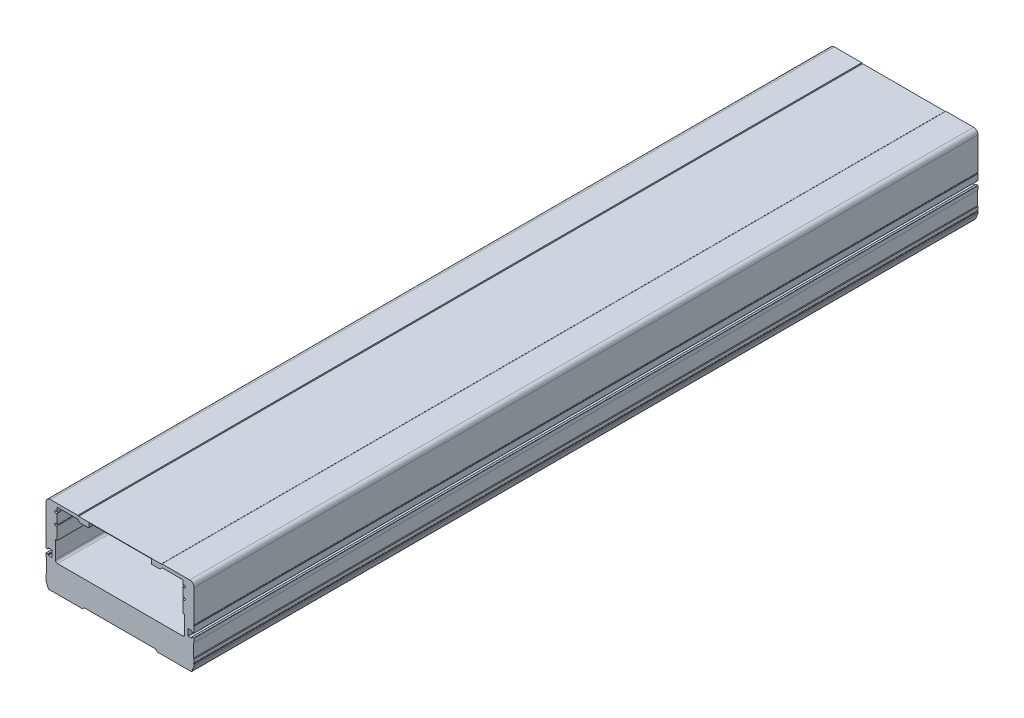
ISO-10303-21;
HEADER;
FILE_DESCRIPTION(('STEP AP214'),'2;1');
FILE_NAME('part.step','',(''),(''),'','','');
FILE_SCHEMA(('AUTOMOTIVE_DESIGN { 1 0 10303 214 1 1 1 1 }'));
ENDSEC;
DATA;
#1=APPLICATION_CONTEXT('core data for automotive mechanical design processes');
#2=APPLICATION_PROTOCOL_DEFINITION('international standard','automotive_design',2000,#1);
#3=PRODUCT_CONTEXT('',#1,'mechanical');
#4=PRODUCT('Part','Part','',(#3));
#5=PRODUCT_RELATED_PRODUCT_CATEGORY('part','',(#4));
#6=PRODUCT_DEFINITION_FORMATION('','',#4);
#7=PRODUCT_DEFINITION_CONTEXT('part definition',#1,'design');
#8=PRODUCT_DEFINITION('design','',#6,#7);
#9=PRODUCT_DEFINITION_SHAPE('','',#8);
#10=(LENGTH_UNIT() NAMED_UNIT(*) SI_UNIT(.MILLI.,.METRE.));
#11=(NAMED_UNIT(*) PLANE_ANGLE_UNIT() SI_UNIT($,.RADIAN.));
#12=(NAMED_UNIT(*) SI_UNIT($,.STERADIAN.) SOLID_ANGLE_UNIT());
#13=UNCERTAINTY_MEASURE_WITH_UNIT(LENGTH_MEASURE(1.E-05),#10,'distance_accuracy_value','');
#14=(GEOMETRIC_REPRESENTATION_CONTEXT(3) GLOBAL_UNCERTAINTY_ASSIGNED_CONTEXT((#13)) GLOBAL_UNIT_ASSIGNED_CONTEXT((#10,
#11,#12)) REPRESENTATION_CONTEXT('',''));
#15=CARTESIAN_POINT('',(0.,0.,0.));
#16=DIRECTION('',(0.,0.,1.));
#17=DIRECTION('',(1.,0.,0.));
#18=AXIS2_PLACEMENT_3D('',#15,#16,#17);
#19=CARTESIAN_POINT('',(-63.4999999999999,66.1,715.));
#20=DIRECTION('',(0.,0.,1.));
#21=DIRECTION('',(1.,0.,0.));
#22=AXIS2_PLACEMENT_3D('',#19,#20,#21);
#23=PLANE('',#22);
#24=CARTESIAN_POINT('',(-63.4999999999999,66.1,715.));
#25=DIRECTION('',(0.,0.,1.));
#26=DIRECTION('',(1.,0.,0.));
#27=AXIS2_PLACEMENT_3D('',#24,#25,#26);
#28=CIRCLE('',#27,4.);
#29=CARTESIAN_POINT('',(-63.4999999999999,70.1,715.));
#30=VERTEX_POINT('',#29);
#31=CARTESIAN_POINT('',(-67.4999999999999,66.1,715.));
#32=VERTEX_POINT('',#31);
#33=EDGE_CURVE('E1033',#30,#32,#28,.T.);
#34=ORIENTED_EDGE('',*,*,#33,.T.);
#35=DIRECTION('',(0.,-1.,0.));
#36=VECTOR('',#35,1.);
#37=CARTESIAN_POINT('',(-67.4999999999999,66.1,715.));
#38=LINE('',#37,#36);
#39=CARTESIAN_POINT('',(-67.4999999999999,36.60466933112,715.));
#40=VERTEX_POINT('',#39);
#41=EDGE_CURVE('E1036',#32,#40,#38,.T.);
#42=ORIENTED_EDGE('',*,*,#41,.T.);
#43=CARTESIAN_POINT('',(-67.1999999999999,36.60466933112,715.));
#44=DIRECTION('',(0.,0.,1.));
#45=DIRECTION('',(1.,0.,0.));
#46=AXIS2_PLACEMENT_3D('',#43,#44,#45);
#47=CIRCLE('',#46,0.299999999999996);
#48=CARTESIAN_POINT('',(-67.3333332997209,36.3359273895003,715.));
#49=VERTEX_POINT('',#48);
#50=EDGE_CURVE('E1039',#40,#49,#47,.T.);
#51=ORIENTED_EDGE('',*,*,#50,.T.);
#52=CARTESIAN_POINT('',(-67.4999999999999,36.,715.));
#53=DIRECTION('',(0.,0.,-1.));
#54=DIRECTION('',(1.,0.,0.));
#55=AXIS2_PLACEMENT_3D('',#52,#53,#54);
#56=CIRCLE('',#55,0.374999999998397);
#57=CARTESIAN_POINT('',(-67.333333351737,35.6640725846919,715.));
#58=VERTEX_POINT('',#57);
#59=EDGE_CURVE('E1041',#49,#58,#56,.T.);
#60=ORIENTED_EDGE('',*,*,#59,.T.);
#61=CARTESIAN_POINT('',(-67.1999999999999,35.39533066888,715.));
#62=DIRECTION('',(0.,0.,1.));
#63=DIRECTION('',(1.,0.,0.));
#64=AXIS2_PLACEMENT_3D('',#61,#62,#63);
#65=CIRCLE('',#64,0.299999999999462);
#66=CARTESIAN_POINT('',(-67.4999999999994,35.39533066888,715.));
#67=VERTEX_POINT('',#66);
#68=EDGE_CURVE('E1043',#58,#67,#65,.T.);
#69=ORIENTED_EDGE('',*,*,#68,.T.);
#70=DIRECTION('',(0.,-1.,0.));
#71=VECTOR('',#70,1.);
#72=CARTESIAN_POINT('',(-67.4999999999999,35.39533066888,715.));
#73=LINE('',#72,#71);
#74=CARTESIAN_POINT('',(-67.4999999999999,30.1,715.));
#75=VERTEX_POINT('',#74);
#76=EDGE_CURVE('E1045',#67,#75,#73,.T.);
#77=ORIENTED_EDGE('',*,*,#76,.T.);
#78=CARTESIAN_POINT('',(-67.1999999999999,30.1,715.));
#79=DIRECTION('',(0.,0.,1.));
#80=DIRECTION('',(1.,0.,0.));
#81=AXIS2_PLACEMENT_3D('',#78,#79,#80);
#82=CIRCLE('',#81,0.299999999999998);
#83=CARTESIAN_POINT('',(-67.1999999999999,29.8,715.));
#84=VERTEX_POINT('',#83);
#85=EDGE_CURVE('E1047',#75,#84,#82,.T.);
#86=ORIENTED_EDGE('',*,*,#85,.T.);
#87=DIRECTION('',(1.,0.,0.));
#88=VECTOR('',#87,1.);
#89=CARTESIAN_POINT('',(-67.1999999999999,29.8,715.));
#90=LINE('',#89,#88);
#91=CARTESIAN_POINT('',(-65.7999999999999,29.8,715.));
#92=VERTEX_POINT('',#91);
#93=EDGE_CURVE('E1049',#84,#92,#90,.T.);
#94=ORIENTED_EDGE('',*,*,#93,.T.);
#95=CARTESIAN_POINT('',(-65.7999999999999,30.1,715.));
#96=DIRECTION('',(0.,0.,1.));
#97=DIRECTION('',(1.,0.,0.));
#98=AXIS2_PLACEMENT_3D('',#95,#96,#97);
#99=CIRCLE('',#98,0.299999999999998);
#100=CARTESIAN_POINT('',(-65.4999999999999,30.1,715.));
#101=VERTEX_POINT('',#100);
#102=EDGE_CURVE('E1051',#92,#101,#99,.T.);
#103=ORIENTED_EDGE('',*,*,#102,.T.);
#104=DIRECTION('',(0.,1.,0.));
#105=VECTOR('',#104,1.);
#106=CARTESIAN_POINT('',(-65.4999999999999,30.1,715.));
#107=LINE('',#106,#105);
#108=CARTESIAN_POINT('',(-65.4999999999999,30.7,715.));
#109=VERTEX_POINT('',#108);
#110=EDGE_CURVE('E1053',#101,#109,#107,.T.);
#111=ORIENTED_EDGE('',*,*,#110,.T.);
#112=CARTESIAN_POINT('',(-65.1999999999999,30.7,715.));
#113=DIRECTION('',(0.,0.,-1.));
#114=DIRECTION('',(1.,0.,0.));
#115=AXIS2_PLACEMENT_3D('',#112,#113,#114);
#116=CIRCLE('',#115,0.300000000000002);
#117=CARTESIAN_POINT('',(-65.1999999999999,31.,715.));
#118=VERTEX_POINT('',#117);
#119=EDGE_CURVE('E1055',#109,#118,#116,.T.);
#120=ORIENTED_EDGE('',*,*,#119,.T.);
#121=DIRECTION('',(1.,0.,0.));
#122=VECTOR('',#121,1.);
#123=CARTESIAN_POINT('',(-65.1999999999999,31.,715.));
#124=LINE('',#123,#122);
#125=CARTESIAN_POINT('',(-62.2999999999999,31.,715.));
#126=VERTEX_POINT('',#125);
#127=EDGE_CURVE('E1057',#118,#126,#124,.T.);
#128=ORIENTED_EDGE('',*,*,#127,.T.);
#129=CARTESIAN_POINT('',(-62.2999999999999,30.7,715.));
#130=DIRECTION('',(0.,0.,-1.));
#131=DIRECTION('',(1.,0.,0.));
#132=AXIS2_PLACEMENT_3D('',#129,#130,#131);
#133=CIRCLE('',#132,0.300000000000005);
#134=CARTESIAN_POINT('',(-61.9999999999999,30.7,715.));
#135=VERTEX_POINT('',#134);
#136=EDGE_CURVE('E1059',#126,#135,#133,.T.);
#137=ORIENTED_EDGE('',*,*,#136,.T.);
#138=DIRECTION('',(0.,-1.,0.));
#139=VECTOR('',#138,1.);
#140=CARTESIAN_POINT('',(-61.9999999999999,30.7,715.));
#141=LINE('',#140,#139);
#142=CARTESIAN_POINT('',(-61.9999999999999,25.3,715.));
#143=VERTEX_POINT('',#142);
#144=EDGE_CURVE('E1061',#135,#143,#141,.T.);
#145=ORIENTED_EDGE('',*,*,#144,.T.);
#146=CARTESIAN_POINT('',(-62.2999999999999,25.3,715.));
#147=DIRECTION('',(0.,0.,-1.));
#148=DIRECTION('',(1.,0.,0.));
#149=AXIS2_PLACEMENT_3D('',#146,#147,#148);
#150=CIRCLE('',#149,0.3);
#151=CARTESIAN_POINT('',(-62.2999999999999,25.,715.));
#152=VERTEX_POINT('',#151);
#153=EDGE_CURVE('E1063',#143,#152,#150,.T.);
#154=ORIENTED_EDGE('',*,*,#153,.T.);
#155=DIRECTION('',(-1.,0.,0.));
#156=VECTOR('',#155,1.);
#157=CARTESIAN_POINT('',(-62.2999999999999,25.,715.));
#158=LINE('',#157,#156);
#159=CARTESIAN_POINT('',(-65.1999999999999,25.,715.));
#160=VERTEX_POINT('',#159);
#161=EDGE_CURVE('E1065',#152,#160,#158,.T.);
#162=ORIENTED_EDGE('',*,*,#161,.T.);
#163=CARTESIAN_POINT('',(-65.1999999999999,25.3,715.));
#164=DIRECTION('',(0.,0.,-1.));
#165=DIRECTION('',(1.,0.,0.));
#166=AXIS2_PLACEMENT_3D('',#163,#164,#165);
#167=CIRCLE('',#166,0.299999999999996);
#168=CARTESIAN_POINT('',(-65.4999999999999,25.3,715.));
#169=VERTEX_POINT('',#168);
#170=EDGE_CURVE('E1067',#160,#169,#167,.T.);
#171=ORIENTED_EDGE('',*,*,#170,.T.);
#172=DIRECTION('',(0.,1.,0.));
#173=VECTOR('',#172,1.);
#174=CARTESIAN_POINT('',(-65.4999999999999,25.3,715.));
#175=LINE('',#174,#173);
#176=CARTESIAN_POINT('',(-65.4999999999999,25.9,715.));
#177=VERTEX_POINT('',#176);
#178=EDGE_CURVE('E1069',#169,#177,#175,.T.);
#179=ORIENTED_EDGE('',*,*,#178,.T.);
#180=CARTESIAN_POINT('',(-65.7999999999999,25.9,715.));
#181=DIRECTION('',(0.,0.,1.));
#182=DIRECTION('',(1.,0.,0.));
#183=AXIS2_PLACEMENT_3D('',#180,#181,#182);
#184=CIRCLE('',#183,0.299999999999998);
#185=CARTESIAN_POINT('',(-65.7999999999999,26.2,715.));
#186=VERTEX_POINT('',#185);
#187=EDGE_CURVE('E1071',#177,#186,#184,.T.);
#188=ORIENTED_EDGE('',*,*,#187,.T.);
#189=DIRECTION('',(-1.,0.,0.));
#190=VECTOR('',#189,1.);
#191=CARTESIAN_POINT('',(-65.7999999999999,26.2,715.));
#192=LINE('',#191,#190);
#193=CARTESIAN_POINT('',(-67.1999999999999,26.2,715.));
#194=VERTEX_POINT('',#193);
#195=EDGE_CURVE('E1073',#186,#194,#192,.T.);
#196=ORIENTED_EDGE('',*,*,#195,.T.);
#197=CARTESIAN_POINT('',(-67.1999999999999,25.9,715.));
#198=DIRECTION('',(0.,0.,1.));
#199=DIRECTION('',(1.,0.,0.));
#200=AXIS2_PLACEMENT_3D('',#197,#198,#199);
#201=CIRCLE('',#200,0.299999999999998);
#202=CARTESIAN_POINT('',(-67.4999999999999,25.9,715.));
#203=VERTEX_POINT('',#202);
#204=EDGE_CURVE('E1075',#194,#203,#201,.T.);
#205=ORIENTED_EDGE('',*,*,#204,.T.);
#206=DIRECTION('',(0.,-1.,0.));
#207=VECTOR('',#206,1.);
#208=CARTESIAN_POINT('',(-67.4999999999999,25.9,715.));
#209=LINE('',#208,#207);
#210=CARTESIAN_POINT('',(-67.4999999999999,22.5,715.));
#211=VERTEX_POINT('',#210);
#212=EDGE_CURVE('E1077',#203,#211,#209,.T.);
#213=ORIENTED_EDGE('',*,*,#212,.T.);
#214=DIRECTION('',(0.707106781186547,-0.707106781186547,0.));
#215=VECTOR('',#214,1.);
#216=CARTESIAN_POINT('',(-67.4999999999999,22.5,715.));
#217=LINE('',#216,#215);
#218=CARTESIAN_POINT('',(-66.9999999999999,22.,715.));
#219=VERTEX_POINT('',#218);
#220=EDGE_CURVE('E1079',#211,#219,#217,.T.);
#221=ORIENTED_EDGE('',*,*,#220,.T.);
#222=DIRECTION('',(0.,-1.,0.));
#223=VECTOR('',#222,1.);
#224=CARTESIAN_POINT('',(-66.9999999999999,22.,715.));
#225=LINE('',#224,#223);
#226=CARTESIAN_POINT('',(-66.9999999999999,9.99999999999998,715.));
#227=VERTEX_POINT('',#226);
#228=EDGE_CURVE('E1081',#219,#227,#225,.T.);
#229=ORIENTED_EDGE('',*,*,#228,.T.);
#230=DIRECTION('',(-0.707106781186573,-0.707106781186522,0.));
#231=VECTOR('',#230,1.);
#232=CARTESIAN_POINT('',(-66.9999999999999,9.99999999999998,715.));
#233=LINE('',#232,#231);
#234=CARTESIAN_POINT('',(-67.4999999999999,9.50000000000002,715.));
#235=VERTEX_POINT('',#234);
#236=EDGE_CURVE('E1083',#227,#235,#233,.T.);
#237=ORIENTED_EDGE('',*,*,#236,.T.);
#238=DIRECTION('',(0.,-1.,0.));
#239=VECTOR('',#238,1.);
#240=CARTESIAN_POINT('',(-67.4999999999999,9.50000000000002,715.));
#241=LINE('',#240,#239);
#242=CARTESIAN_POINT('',(-67.4999999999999,6.60466933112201,715.));
#243=VERTEX_POINT('',#242);
#244=EDGE_CURVE('E1085',#235,#243,#241,.T.);
#245=ORIENTED_EDGE('',*,*,#244,.T.);
#246=CARTESIAN_POINT('',(-67.1999999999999,6.60466933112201,715.));
#247=DIRECTION('',(0.,0.,1.));
#248=DIRECTION('',(1.,0.,0.));
#249=AXIS2_PLACEMENT_3D('',#246,#247,#248);
#250=CIRCLE('',#249,0.299999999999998);
#251=CARTESIAN_POINT('',(-67.3333333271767,6.33592740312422,715.));
#252=VERTEX_POINT('',#251);
#253=EDGE_CURVE('E1087',#243,#252,#250,.T.);
#254=ORIENTED_EDGE('',*,*,#253,.T.);
#255=CARTESIAN_POINT('',(-67.4999999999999,6.,715.));
#256=DIRECTION('',(0.,0.,-1.));
#257=DIRECTION('',(1.,0.,0.));
#258=AXIS2_PLACEMENT_3D('',#255,#256,#257);
#259=CIRCLE('',#258,0.374999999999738);
#260=CARTESIAN_POINT('',(-67.3333333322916,5.66407259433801,715.));
#261=VERTEX_POINT('',#260);
#262=EDGE_CURVE('E1089',#252,#261,#259,.T.);
#263=ORIENTED_EDGE('',*,*,#262,.T.);
#264=CARTESIAN_POINT('',(-67.1999999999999,5.395330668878,715.));
#265=DIRECTION('',(0.,0.,1.));
#266=DIRECTION('',(1.,0.,0.));
#267=AXIS2_PLACEMENT_3D('',#264,#265,#266);
#268=CIRCLE('',#267,0.299999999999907);
#269=CARTESIAN_POINT('',(-67.4999999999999,5.395330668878,715.));
#270=VERTEX_POINT('',#269);
#271=EDGE_CURVE('E1091',#261,#270,#268,.T.);
#272=ORIENTED_EDGE('',*,*,#271,.T.);
#273=DIRECTION('',(0.,-1.,0.));
#274=VECTOR('',#273,1.);
#275=CARTESIAN_POINT('',(-67.4999999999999,5.395330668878,715.));
#276=LINE('',#275,#274);
#277=CARTESIAN_POINT('',(-67.4999999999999,4.381968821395,715.));
#278=VERTEX_POINT('',#277);
#279=EDGE_CURVE('E1093',#270,#278,#276,.T.);
#280=ORIENTED_EDGE('',*,*,#279,.T.);
#281=CARTESIAN_POINT('',(-65.4999999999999,4.381968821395,715.));
#282=DIRECTION('',(0.,0.,1.));
#283=DIRECTION('',(1.,0.,0.));
#284=AXIS2_PLACEMENT_3D('',#281,#282,#283);
#285=CIRCLE('',#284,1.99999999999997);
#286=CARTESIAN_POINT('',(-67.3592342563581,3.64491524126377,715.));
#287=VERTEX_POINT('',#286);
#288=EDGE_CURVE('E1095',#278,#287,#285,.T.);
#289=ORIENTED_EDGE('',*,*,#288,.T.);
#290=DIRECTION('',(0.36852679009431,-0.929617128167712,0.));
#291=VECTOR('',#290,1.);
#292=CARTESIAN_POINT('',(-67.3592342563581,3.64491524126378,715.));
#293=LINE('',#292,#291);
#294=CARTESIAN_POINT('',(-65.5064193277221,-1.02885214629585,715.));
#295=VERTEX_POINT('',#294);
#296=EDGE_CURVE('E1097',#287,#295,#293,.T.);
#297=ORIENTED_EDGE('',*,*,#296,.T.);
#298=CARTESIAN_POINT('',(-63.6471850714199,-0.291798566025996,715.));
#299=DIRECTION('',(0.,0.,1.));
#300=DIRECTION('',(1.,0.,0.));
#301=AXIS2_PLACEMENT_3D('',#298,#299,#300);
#302=CIRCLE('',#301,1.99999999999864);
#303=CARTESIAN_POINT('',(-65.1600000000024,-1.60000000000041,715.));
#304=VERTEX_POINT('',#303);
#305=EDGE_CURVE('E1099',#295,#304,#302,.T.);
#306=ORIENTED_EDGE('',*,*,#305,.T.);
#307=DIRECTION('',(1.,0.,0.));
#308=VECTOR('',#307,1.);
#309=CARTESIAN_POINT('',(-65.1600000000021,-1.60000000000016,715.));
#310=LINE('',#309,#308);
#311=CARTESIAN_POINT('',(-34.1000000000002,-1.60000000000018,715.));
#312=VERTEX_POINT('',#311);
#313=EDGE_CURVE('E1101',#304,#312,#310,.T.);
#314=ORIENTED_EDGE('',*,*,#313,.T.);
#315=DIRECTION('',(0.707106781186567,0.707106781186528,0.));
#316=VECTOR('',#315,1.);
#317=CARTESIAN_POINT('',(-34.1000000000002,-1.60000000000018,715.));
#318=LINE('',#317,#316);
#319=CARTESIAN_POINT('',(-32.4999999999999,0.,715.));
#320=VERTEX_POINT('',#319);
#321=EDGE_CURVE('E1103',#312,#320,#318,.T.);
#322=ORIENTED_EDGE('',*,*,#321,.T.);
#323=DIRECTION('',(1.,0.,0.));
#324=VECTOR('',#323,1.);
#325=CARTESIAN_POINT('',(-32.4999999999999,0.,715.));
#326=LINE('',#325,#324);
#327=CARTESIAN_POINT('',(32.4999999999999,0.,715.));
#328=VERTEX_POINT('',#327);
#329=EDGE_CURVE('E1105',#320,#328,#326,.T.);
#330=ORIENTED_EDGE('',*,*,#329,.T.);
#331=DIRECTION('',(0.707106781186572,-0.707106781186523,0.));
#332=VECTOR('',#331,1.);
#333=CARTESIAN_POINT('',(32.4999999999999,0.,715.));
#334=LINE('',#333,#332);
#335=CARTESIAN_POINT('',(34.1000000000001,-1.60000000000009,715.));
#336=VERTEX_POINT('',#335);
#337=EDGE_CURVE('E1107',#328,#336,#334,.T.);
#338=ORIENTED_EDGE('',*,*,#337,.T.);
#339=DIRECTION('',(1.,0.,0.));
#340=VECTOR('',#339,1.);
#341=CARTESIAN_POINT('',(34.1000000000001,-1.60000000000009,715.));
#342=LINE('',#341,#340);
#343=CARTESIAN_POINT('',(65.1600000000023,-1.60000000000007,715.));
#344=VERTEX_POINT('',#343);
#345=EDGE_CURVE('E1109',#336,#344,#342,.T.);
#346=ORIENTED_EDGE('',*,*,#345,.T.);
#347=CARTESIAN_POINT('',(63.6471850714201,-0.291798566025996,715.));
#348=DIRECTION('',(0.,0.,1.));
#349=DIRECTION('',(1.,0.,0.));
#350=AXIS2_PLACEMENT_3D('',#347,#348,#349);
#351=CIRCLE('',#350,1.99999999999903);
#352=CARTESIAN_POINT('',(65.506419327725,-1.02885214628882,715.));
#353=VERTEX_POINT('',#352);
#354=EDGE_CURVE('E1111',#344,#353,#351,.T.);
#355=ORIENTED_EDGE('',*,*,#354,.T.);
#356=DIRECTION('',(0.368526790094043,0.929617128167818,0.));
#357=VECTOR('',#356,1.);
#358=CARTESIAN_POINT('',(65.5064193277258,-1.0288521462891,715.));
#359=LINE('',#358,#357);
#360=CARTESIAN_POINT('',(67.3592342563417,3.64491524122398,715.));
#361=VERTEX_POINT('',#360);
#362=EDGE_CURVE('E1113',#353,#361,#359,.T.);
#363=ORIENTED_EDGE('',*,*,#362,.T.);
#364=CARTESIAN_POINT('',(65.4999999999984,4.38196882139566,715.));
#365=DIRECTION('',(0.,0.,1.));
#366=DIRECTION('',(1.,0.,0.));
#367=AXIS2_PLACEMENT_3D('',#364,#365,#366);
#368=CIRCLE('',#367,2.00000000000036);
#369=CARTESIAN_POINT('',(67.4999999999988,4.38196882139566,715.));
#370=VERTEX_POINT('',#369);
#371=EDGE_CURVE('E1115',#361,#370,#368,.T.);
#372=ORIENTED_EDGE('',*,*,#371,.T.);
#373=DIRECTION('',(0.,1.,0.));
#374=VECTOR('',#373,1.);
#375=CARTESIAN_POINT('',(67.4999999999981,4.38196882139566,715.));
#376=LINE('',#375,#374);
#377=CARTESIAN_POINT('',(67.4999999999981,5.39533066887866,715.));
#378=VERTEX_POINT('',#377);
#379=EDGE_CURVE('E1117',#370,#378,#376,.T.);
#380=ORIENTED_EDGE('',*,*,#379,.T.);
#381=CARTESIAN_POINT('',(67.1999999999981,5.39533066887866,715.));
#382=DIRECTION('',(0.,0.,1.));
#383=DIRECTION('',(1.,0.,0.));
#384=AXIS2_PLACEMENT_3D('',#381,#382,#383);
#385=CIRCLE('',#384,0.299999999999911);
#386=CARTESIAN_POINT('',(67.3333333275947,5.66407259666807,715.));
#387=VERTEX_POINT('',#386);
#388=EDGE_CURVE('E1119',#378,#387,#385,.T.);
#389=ORIENTED_EDGE('',*,*,#388,.T.);
#390=CARTESIAN_POINT('',(67.4999999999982,6.00000000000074,715.));
#391=DIRECTION('',(0.,0.,-1.));
#392=DIRECTION('',(1.,0.,0.));
#393=AXIS2_PLACEMENT_3D('',#390,#391,#392);
#394=CIRCLE('',#393,0.374999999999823);
#395=CARTESIAN_POINT('',(67.3333333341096,6.33592740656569,715.));
#396=VERTEX_POINT('',#395);
#397=EDGE_CURVE('E1121',#387,#396,#394,.T.);
#398=ORIENTED_EDGE('',*,*,#397,.T.);
#399=CARTESIAN_POINT('',(67.1999999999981,6.60466933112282,715.));
#400=DIRECTION('',(0.,0.,1.));
#401=DIRECTION('',(1.,0.,0.));
#402=AXIS2_PLACEMENT_3D('',#399,#400,#401);
#403=CIRCLE('',#402,0.299999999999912);
#404=CARTESIAN_POINT('',(67.4999999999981,6.60466933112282,715.));
#405=VERTEX_POINT('',#404);
#406=EDGE_CURVE('E1123',#396,#405,#403,.T.);
#407=ORIENTED_EDGE('',*,*,#406,.T.);
#408=DIRECTION('',(0.,1.,0.));
#409=VECTOR('',#408,1.);
#410=CARTESIAN_POINT('',(67.4999999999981,6.60466933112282,715.));
#411=LINE('',#410,#409);
#412=CARTESIAN_POINT('',(67.4999999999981,9.50000000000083,715.));
#413=VERTEX_POINT('',#412);
#414=EDGE_CURVE('E1125',#405,#413,#411,.T.);
#415=ORIENTED_EDGE('',*,*,#414,.T.);
#416=DIRECTION('',(-0.707106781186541,0.707106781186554,0.));
#417=VECTOR('',#416,1.);
#418=CARTESIAN_POINT('',(67.4999999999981,9.50000000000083,715.));
#419=LINE('',#418,#417);
#420=CARTESIAN_POINT('',(66.9999999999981,10.0000000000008,715.));
#421=VERTEX_POINT('',#420);
#422=EDGE_CURVE('E1127',#413,#421,#419,.T.);
#423=ORIENTED_EDGE('',*,*,#422,.T.);
#424=DIRECTION('',(0.,1.,0.));
#425=VECTOR('',#424,1.);
#426=CARTESIAN_POINT('',(66.9999999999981,10.0000000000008,715.));
#427=LINE('',#426,#425);
#428=CARTESIAN_POINT('',(66.9999999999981,22.0000000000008,715.));
#429=VERTEX_POINT('',#428);
#430=EDGE_CURVE('E1129',#421,#429,#427,.T.);
#431=ORIENTED_EDGE('',*,*,#430,.T.);
#432=DIRECTION('',(0.707106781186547,0.707106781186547,0.));
#433=VECTOR('',#432,1.);
#434=CARTESIAN_POINT('',(66.9999999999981,22.0000000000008,715.));
#435=LINE('',#434,#433);
#436=CARTESIAN_POINT('',(67.4999999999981,22.5000000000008,715.));
#437=VERTEX_POINT('',#436);
#438=EDGE_CURVE('E1131',#429,#437,#435,.T.);
#439=ORIENTED_EDGE('',*,*,#438,.T.);
#440=DIRECTION('',(0.,1.,0.));
#441=VECTOR('',#440,1.);
#442=CARTESIAN_POINT('',(67.4999999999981,22.5000000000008,715.));
#443=LINE('',#442,#441);
#444=CARTESIAN_POINT('',(67.4999999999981,25.9000000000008,715.));
#445=VERTEX_POINT('',#444);
#446=EDGE_CURVE('E1133',#437,#445,#443,.T.);
#447=ORIENTED_EDGE('',*,*,#446,.T.);
#448=CARTESIAN_POINT('',(67.1999999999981,25.9000000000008,715.));
#449=DIRECTION('',(0.,0.,1.));
#450=DIRECTION('',(1.,0.,0.));
#451=AXIS2_PLACEMENT_3D('',#448,#449,#450);
#452=CIRCLE('',#451,0.300000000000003);
#453=CARTESIAN_POINT('',(67.1999999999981,26.2000000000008,715.));
#454=VERTEX_POINT('',#453);
#455=EDGE_CURVE('E1135',#445,#454,#452,.T.);
#456=ORIENTED_EDGE('',*,*,#455,.T.);
#457=DIRECTION('',(-1.,0.,0.));
#458=VECTOR('',#457,1.);
#459=CARTESIAN_POINT('',(67.1999999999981,26.2000000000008,715.));
#460=LINE('',#459,#458);
#461=CARTESIAN_POINT('',(65.7999999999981,26.2000000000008,715.));
#462=VERTEX_POINT('',#461);
#463=EDGE_CURVE('E1137',#454,#462,#460,.T.);
#464=ORIENTED_EDGE('',*,*,#463,.T.);
#465=CARTESIAN_POINT('',(65.7999999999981,25.9000000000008,715.));
#466=DIRECTION('',(0.,0.,1.));
#467=DIRECTION('',(1.,0.,0.));
#468=AXIS2_PLACEMENT_3D('',#465,#466,#467);
#469=CIRCLE('',#468,0.299999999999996);
#470=CARTESIAN_POINT('',(65.4999999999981,25.9000000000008,715.));
#471=VERTEX_POINT('',#470);
#472=EDGE_CURVE('E1139',#462,#471,#469,.T.);
#473=ORIENTED_EDGE('',*,*,#472,.T.);
#474=DIRECTION('',(0.,-1.,0.));
#475=VECTOR('',#474,1.);
#476=CARTESIAN_POINT('',(65.4999999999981,25.9000000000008,715.));
#477=LINE('',#476,#475);
#478=CARTESIAN_POINT('',(65.4999999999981,25.3000000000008,715.));
#479=VERTEX_POINT('',#478);
#480=EDGE_CURVE('E1141',#471,#479,#477,.T.);
#481=ORIENTED_EDGE('',*,*,#480,.T.);
#482=CARTESIAN_POINT('',(65.1999999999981,25.3000000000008,715.));
#483=DIRECTION('',(0.,0.,-1.));
#484=DIRECTION('',(1.,0.,0.));
#485=AXIS2_PLACEMENT_3D('',#482,#483,#484);
#486=CIRCLE('',#485,0.299999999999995);
#487=CARTESIAN_POINT('',(65.1999999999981,25.0000000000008,715.));
#488=VERTEX_POINT('',#487);
#489=EDGE_CURVE('E1143',#479,#488,#486,.T.);
#490=ORIENTED_EDGE('',*,*,#489,.T.);
#491=DIRECTION('',(-1.,0.,0.));
#492=VECTOR('',#491,1.);
#493=CARTESIAN_POINT('',(65.1999999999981,25.0000000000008,715.));
#494=LINE('',#493,#492);
#495=CARTESIAN_POINT('',(62.2999999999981,25.0000000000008,715.));
#496=VERTEX_POINT('',#495);
#497=EDGE_CURVE('E1145',#488,#496,#494,.T.);
#498=ORIENTED_EDGE('',*,*,#497,.T.);
#499=CARTESIAN_POINT('',(62.2999999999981,25.3000000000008,715.));
#500=DIRECTION('',(0.,0.,-1.));
#501=DIRECTION('',(1.,0.,0.));
#502=AXIS2_PLACEMENT_3D('',#499,#500,#501);
#503=CIRCLE('',#502,0.3);
#504=CARTESIAN_POINT('',(61.9999999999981,25.3000000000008,715.));
#505=VERTEX_POINT('',#504);
#506=EDGE_CURVE('E1147',#496,#505,#503,.T.);
#507=ORIENTED_EDGE('',*,*,#506,.T.);
#508=DIRECTION('',(0.,1.,0.));
#509=VECTOR('',#508,1.);
#510=CARTESIAN_POINT('',(61.9999999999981,25.3000000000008,715.));
#511=LINE('',#510,#509);
#512=CARTESIAN_POINT('',(61.9999999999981,30.7000000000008,715.));
#513=VERTEX_POINT('',#512);
#514=EDGE_CURVE('E1149',#505,#513,#511,.T.);
#515=ORIENTED_EDGE('',*,*,#514,.T.);
#516=CARTESIAN_POINT('',(62.2999999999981,30.7000000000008,715.));
#517=DIRECTION('',(0.,0.,-1.));
#518=DIRECTION('',(1.,0.,0.));
#519=AXIS2_PLACEMENT_3D('',#516,#517,#518);
#520=CIRCLE('',#519,0.300000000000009);
#521=CARTESIAN_POINT('',(62.2999999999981,31.0000000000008,715.));
#522=VERTEX_POINT('',#521);
#523=EDGE_CURVE('E1151',#513,#522,#520,.T.);
#524=ORIENTED_EDGE('',*,*,#523,.T.);
#525=DIRECTION('',(1.,0.,0.));
#526=VECTOR('',#525,1.);
#527=CARTESIAN_POINT('',(62.2999999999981,31.0000000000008,715.));
#528=LINE('',#527,#526);
#529=CARTESIAN_POINT('',(65.1999999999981,31.0000000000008,715.));
#530=VERTEX_POINT('',#529);
#531=EDGE_CURVE('E1153',#522,#530,#528,.T.);
#532=ORIENTED_EDGE('',*,*,#531,.T.);
#533=CARTESIAN_POINT('',(65.1999999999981,30.7000000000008,715.));
#534=DIRECTION('',(0.,0.,-1.));
#535=DIRECTION('',(1.,0.,0.));
#536=AXIS2_PLACEMENT_3D('',#533,#534,#535);
#537=CIRCLE('',#536,0.300000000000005);
#538=CARTESIAN_POINT('',(65.4999999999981,30.7000000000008,715.));
#539=VERTEX_POINT('',#538);
#540=EDGE_CURVE('E1155',#530,#539,#537,.T.);
#541=ORIENTED_EDGE('',*,*,#540,.T.);
#542=DIRECTION('',(0.,-1.,0.));
#543=VECTOR('',#542,1.);
#544=CARTESIAN_POINT('',(65.4999999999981,30.7000000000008,715.));
#545=LINE('',#544,#543);
#546=CARTESIAN_POINT('',(65.4999999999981,30.1000000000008,715.));
#547=VERTEX_POINT('',#546);
#548=EDGE_CURVE('E1157',#539,#547,#545,.T.);
#549=ORIENTED_EDGE('',*,*,#548,.T.);
#550=CARTESIAN_POINT('',(65.7999999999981,30.1000000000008,715.));
#551=DIRECTION('',(0.,0.,1.));
#552=DIRECTION('',(1.,0.,0.));
#553=AXIS2_PLACEMENT_3D('',#550,#551,#552);
#554=CIRCLE('',#553,0.299999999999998);
#555=CARTESIAN_POINT('',(65.7999999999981,29.8000000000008,715.));
#556=VERTEX_POINT('',#555);
#557=EDGE_CURVE('E1159',#547,#556,#554,.T.);
#558=ORIENTED_EDGE('',*,*,#557,.T.);
#559=DIRECTION('',(1.,0.,0.));
#560=VECTOR('',#559,1.);
#561=CARTESIAN_POINT('',(65.7999999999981,29.8000000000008,715.));
#562=LINE('',#561,#560);
#563=CARTESIAN_POINT('',(67.1999999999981,29.8000000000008,715.));
#564=VERTEX_POINT('',#563);
#565=EDGE_CURVE('E1161',#556,#564,#562,.T.);
#566=ORIENTED_EDGE('',*,*,#565,.T.);
#567=CARTESIAN_POINT('',(67.1999999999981,30.1000000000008,715.));
#568=DIRECTION('',(0.,0.,1.));
#569=DIRECTION('',(1.,0.,0.));
#570=AXIS2_PLACEMENT_3D('',#567,#568,#569);
#571=CIRCLE('',#570,0.299999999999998);
#572=CARTESIAN_POINT('',(67.4999999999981,30.1000000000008,715.));
#573=VERTEX_POINT('',#572);
#574=EDGE_CURVE('E1163',#564,#573,#571,.T.);
#575=ORIENTED_EDGE('',*,*,#574,.T.);
#576=DIRECTION('',(0.,1.,0.));
#577=VECTOR('',#576,1.);
#578=CARTESIAN_POINT('',(67.4999999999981,30.1000000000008,715.));
#579=LINE('',#578,#577);
#580=CARTESIAN_POINT('',(67.4999999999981,35.3953306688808,715.));
#581=VERTEX_POINT('',#580);
#582=EDGE_CURVE('E1165',#573,#581,#579,.T.);
#583=ORIENTED_EDGE('',*,*,#582,.T.);
#584=CARTESIAN_POINT('',(67.1999999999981,35.3953306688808,715.));
#585=DIRECTION('',(0.,0.,1.));
#586=DIRECTION('',(1.,0.,0.));
#587=AXIS2_PLACEMENT_3D('',#584,#585,#586);
#588=CIRCLE('',#587,0.299999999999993);
#589=CARTESIAN_POINT('',(67.3333333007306,35.6640726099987,715.));
#590=VERTEX_POINT('',#589);
#591=EDGE_CURVE('E1167',#581,#590,#588,.T.);
#592=ORIENTED_EDGE('',*,*,#591,.T.);
#593=CARTESIAN_POINT('',(67.4999999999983,36.0000000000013,715.));
#594=DIRECTION('',(0.,0.,-1.));
#595=DIRECTION('',(1.,0.,0.));
#596=AXIS2_PLACEMENT_3D('',#593,#594,#595);
#597=CIRCLE('',#596,0.374999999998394);
#598=CARTESIAN_POINT('',(67.3333333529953,36.3359274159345,715.));
#599=VERTEX_POINT('',#598);
#600=EDGE_CURVE('E1169',#590,#599,#597,.T.);
#601=ORIENTED_EDGE('',*,*,#600,.T.);
#602=CARTESIAN_POINT('',(67.1999999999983,36.6046693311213,715.));
#603=DIRECTION('',(0.,0.,1.));
#604=DIRECTION('',(1.,0.,0.));
#605=AXIS2_PLACEMENT_3D('',#602,#603,#604);
#606=CIRCLE('',#605,0.299999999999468);
#607=CARTESIAN_POINT('',(67.4999999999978,36.6046693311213,715.));
#608=VERTEX_POINT('',#607);
#609=EDGE_CURVE('E1171',#599,#608,#606,.T.);
#610=ORIENTED_EDGE('',*,*,#609,.T.);
#611=DIRECTION('',(0.,1.,0.));
#612=VECTOR('',#611,1.);
#613=CARTESIAN_POINT('',(67.4999999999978,36.6046693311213,715.));
#614=LINE('',#613,#612);
#615=CARTESIAN_POINT('',(67.4999999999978,66.1000000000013,715.));
#616=VERTEX_POINT('',#615);
#617=EDGE_CURVE('E1173',#608,#616,#614,.T.);
#618=ORIENTED_EDGE('',*,*,#617,.T.);
#619=CARTESIAN_POINT('',(63.4999999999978,66.1000000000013,715.));
#620=DIRECTION('',(0.,0.,1.));
#621=DIRECTION('',(1.,0.,0.));
#622=AXIS2_PLACEMENT_3D('',#619,#620,#621);
#623=CIRCLE('',#622,4.);
#624=CARTESIAN_POINT('',(63.4999999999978,70.1000000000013,715.));
#625=VERTEX_POINT('',#624);
#626=EDGE_CURVE('E1175',#616,#625,#623,.T.);
#627=ORIENTED_EDGE('',*,*,#626,.T.);
#628=DIRECTION('',(-1.,0.,0.));
#629=VECTOR('',#628,1.);
#630=CARTESIAN_POINT('',(63.4999999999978,70.1000000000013,715.));
#631=LINE('',#630,#629);
#632=CARTESIAN_POINT('',(38.4999999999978,70.1000000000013,715.));
#633=VERTEX_POINT('',#632);
#634=EDGE_CURVE('E1177',#625,#633,#631,.T.);
#635=ORIENTED_EDGE('',*,*,#634,.T.);
#636=DIRECTION('',(-0.707106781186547,-0.707106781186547,0.));
#637=VECTOR('',#636,1.);
#638=CARTESIAN_POINT('',(38.4999999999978,70.1000000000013,715.));
#639=LINE('',#638,#637);
#640=CARTESIAN_POINT('',(37.9999999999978,69.6000000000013,715.));
#641=VERTEX_POINT('',#640);
#642=EDGE_CURVE('E1179',#633,#641,#639,.T.);
#643=ORIENTED_EDGE('',*,*,#642,.T.);
#644=DIRECTION('',(-1.,0.,0.));
#645=VECTOR('',#644,1.);
#646=CARTESIAN_POINT('',(37.9999999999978,69.6000000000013,715.));
#647=LINE('',#646,#645);
#648=CARTESIAN_POINT('',(37.4999999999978,69.6000000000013,715.));
#649=VERTEX_POINT('',#648);
#650=EDGE_CURVE('E1181',#641,#649,#647,.T.);
#651=ORIENTED_EDGE('',*,*,#650,.T.);
#652=DIRECTION('',(0.,1.,0.));
#653=VECTOR('',#652,1.);
#654=CARTESIAN_POINT('',(37.4999999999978,69.6000000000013,715.));
#655=LINE('',#654,#653);
#656=CARTESIAN_POINT('',(37.4999999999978,69.7,715.));
#657=VERTEX_POINT('',#656);
#658=EDGE_CURVE('E1183',#649,#657,#655,.T.);
#659=ORIENTED_EDGE('',*,*,#658,.T.);
#660=DIRECTION('',(-1.,0.,0.));
#661=VECTOR('',#660,1.);
#662=CARTESIAN_POINT('',(37.4999999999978,69.7,715.));
#663=LINE('',#662,#661);
#664=CARTESIAN_POINT('',(-37.4999999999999,69.7,715.));
#665=VERTEX_POINT('',#664);
#666=EDGE_CURVE('E1185',#657,#665,#663,.T.);
#667=ORIENTED_EDGE('',*,*,#666,.T.);
#668=DIRECTION('',(0.,-1.,0.));
#669=VECTOR('',#668,1.);
#670=CARTESIAN_POINT('',(-37.4999999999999,69.7,715.));
#671=LINE('',#670,#669);
#672=CARTESIAN_POINT('',(-37.4999999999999,69.6,715.));
#673=VERTEX_POINT('',#672);
#674=EDGE_CURVE('E1187',#665,#673,#671,.T.);
#675=ORIENTED_EDGE('',*,*,#674,.T.);
#676=DIRECTION('',(-1.,0.,0.));
#677=VECTOR('',#676,1.);
#678=CARTESIAN_POINT('',(-37.4999999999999,69.6,715.));
#679=LINE('',#678,#677);
#680=CARTESIAN_POINT('',(-37.9999999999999,69.6,715.));
#681=VERTEX_POINT('',#680);
#682=EDGE_CURVE('E1189',#673,#681,#679,.T.);
#683=ORIENTED_EDGE('',*,*,#682,.T.);
#684=DIRECTION('',(-0.707106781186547,0.707106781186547,0.));
#685=VECTOR('',#684,1.);
#686=CARTESIAN_POINT('',(-37.9999999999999,69.6,715.));
#687=LINE('',#686,#685);
#688=CARTESIAN_POINT('',(-38.4999999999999,70.1,715.));
#689=VERTEX_POINT('',#688);
#690=EDGE_CURVE('E1191',#681,#689,#687,.T.);
#691=ORIENTED_EDGE('',*,*,#690,.T.);
#692=DIRECTION('',(-1.,0.,0.));
#693=VECTOR('',#692,1.);
#694=CARTESIAN_POINT('',(-38.4999999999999,70.1,715.));
#695=LINE('',#694,#693);
#696=EDGE_CURVE('E1193',#689,#30,#695,.T.);
#697=ORIENTED_EDGE('',*,*,#696,.T.);
#698=EDGE_LOOP('',(#34,#42,#51,#60,#69,#77,#86,#94,#103,#111,#120,#128,#137,#145,#154,#162,#171,
#179,#188,#196,#205,#213,#221,#229,#237,#245,#254,#263,#272,#280,#289,#297,#306,#314,#322,#330,
#338,#346,#355,#363,#372,#380,#389,#398,#407,#415,#423,#431,#439,#447,#456,#464,#473,#481,#490,
#498,#507,#515,#524,#532,#541,#549,#558,#566,#575,#583,#592,#601,#610,#618,#627,#635,#643,#651,
#659,#667,#675,#683,#691,#697));
#699=FACE_BOUND('',#698,.T.);
#700=DIRECTION('',(0.,1.,0.));
#701=VECTOR('',#700,1.);
#702=CARTESIAN_POINT('',(59.0000000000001,24.7,715.));
#703=LINE('',#702,#701);
#704=CARTESIAN_POINT('',(59.0000000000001,24.7,715.));
#705=VERTEX_POINT('',#704);
#706=CARTESIAN_POINT('',(59.0000000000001,40.6,715.));
#707=VERTEX_POINT('',#706);
#708=EDGE_CURVE('E820',#705,#707,#703,.T.);
#709=ORIENTED_EDGE('',*,*,#708,.F.);
#710=CARTESIAN_POINT('',(57.0000000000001,24.7,715.));
#711=DIRECTION('',(0.,0.,1.));
#712=DIRECTION('',(1.,0.,0.));
#713=AXIS2_PLACEMENT_3D('',#710,#711,#712);
#714=CIRCLE('',#713,2.);
#715=CARTESIAN_POINT('',(57.0000000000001,22.7,715.));
#716=VERTEX_POINT('',#715);
#717=EDGE_CURVE('E818',#716,#705,#714,.T.);
#718=ORIENTED_EDGE('',*,*,#717,.F.);
#719=DIRECTION('',(1.,0.,0.));
#720=VECTOR('',#719,1.);
#721=CARTESIAN_POINT('',(-56.9999999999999,22.7,715.));
#722=LINE('',#721,#720);
#723=CARTESIAN_POINT('',(-56.9999999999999,22.7,715.));
#724=VERTEX_POINT('',#723);
#725=EDGE_CURVE('E879',#724,#716,#722,.T.);
#726=ORIENTED_EDGE('',*,*,#725,.F.);
#727=CARTESIAN_POINT('',(-56.9999999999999,24.7,715.));
#728=DIRECTION('',(0.,0.,1.));
#729=DIRECTION('',(1.,0.,0.));
#730=AXIS2_PLACEMENT_3D('',#727,#728,#729);
#731=CIRCLE('',#730,2.);
#732=CARTESIAN_POINT('',(-58.9999999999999,24.7,715.));
#733=VERTEX_POINT('',#732);
#734=EDGE_CURVE('E877',#733,#724,#731,.T.);
#735=ORIENTED_EDGE('',*,*,#734,.F.);
#736=DIRECTION('',(0.,-1.,0.));
#737=VECTOR('',#736,1.);
#738=CARTESIAN_POINT('',(-58.9999999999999,40.3,715.));
#739=LINE('',#738,#737);
#740=CARTESIAN_POINT('',(-58.9999999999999,40.3,715.));
#741=VERTEX_POINT('',#740);
#742=EDGE_CURVE('E875',#741,#733,#739,.T.);
#743=ORIENTED_EDGE('',*,*,#742,.F.);
#744=CARTESIAN_POINT('',(-59.2999999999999,40.3,715.));
#745=DIRECTION('',(0.,0.,-1.));
#746=DIRECTION('',(1.,0.,0.));
#747=AXIS2_PLACEMENT_3D('',#744,#745,#746);
#748=CIRCLE('',#747,0.299999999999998);
#749=CARTESIAN_POINT('',(-59.2999999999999,40.6,715.));
#750=VERTEX_POINT('',#749);
#751=EDGE_CURVE('E873',#750,#741,#748,.T.);
#752=ORIENTED_EDGE('',*,*,#751,.F.);
#753=DIRECTION('',(-1.,0.,0.));
#754=VECTOR('',#753,1.);
#755=CARTESIAN_POINT('',(-57.4999999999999,40.6,715.));
#756=LINE('',#755,#754);
#757=CARTESIAN_POINT('',(-57.4999999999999,40.6,715.));
#758=VERTEX_POINT('',#757);
#759=EDGE_CURVE('E871',#758,#750,#756,.T.);
#760=ORIENTED_EDGE('',*,*,#759,.F.);
#761=DIRECTION('',(0.,-1.,0.));
#762=VECTOR('',#761,1.);
#763=CARTESIAN_POINT('',(-57.5000000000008,52.1417424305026,715.));
#764=LINE('',#763,#762);
#765=CARTESIAN_POINT('',(-57.5000000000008,52.1417424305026,715.));
#766=VERTEX_POINT('',#765);
#767=EDGE_CURVE('E869',#766,#758,#764,.T.);
#768=ORIENTED_EDGE('',*,*,#767,.F.);
#769=CARTESIAN_POINT('',(-58.4999999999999,52.6,715.));
#770=DIRECTION('',(0.,0.,1.));
#771=DIRECTION('',(1.,0.,0.));
#772=AXIS2_PLACEMENT_3D('',#769,#770,#771);
#773=CIRCLE('',#772,1.10000000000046);
#774=CARTESIAN_POINT('',(-57.5000000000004,53.0582575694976,715.));
#775=VERTEX_POINT('',#774);
#776=EDGE_CURVE('E867',#775,#766,#773,.T.);
#777=ORIENTED_EDGE('',*,*,#776,.F.);
#778=DIRECTION('',(0.,-1.,0.));
#779=VECTOR('',#778,1.);
#780=CARTESIAN_POINT('',(-57.5000000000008,62.1417424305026,715.));
#781=LINE('',#780,#779);
#782=CARTESIAN_POINT('',(-57.5000000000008,62.1417424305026,715.));
#783=VERTEX_POINT('',#782);
#784=EDGE_CURVE('E865',#783,#775,#781,.T.);
#785=ORIENTED_EDGE('',*,*,#784,.F.);
#786=CARTESIAN_POINT('',(-58.4999999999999,62.6,715.));
#787=DIRECTION('',(0.,0.,1.));
#788=DIRECTION('',(1.,0.,0.));
#789=AXIS2_PLACEMENT_3D('',#786,#787,#788);
#790=CIRCLE('',#789,1.10000000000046);
#791=CARTESIAN_POINT('',(-57.5000000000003,63.0582575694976,715.));
#792=VERTEX_POINT('',#791);
#793=EDGE_CURVE('E863',#792,#783,#790,.T.);
#794=ORIENTED_EDGE('',*,*,#793,.F.);
#795=DIRECTION('',(0.,-1.,0.));
#796=VECTOR('',#795,1.);
#797=CARTESIAN_POINT('',(-57.4999999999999,66.1,715.));
#798=LINE('',#797,#796);
#799=CARTESIAN_POINT('',(-57.4999999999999,66.1,715.));
#800=VERTEX_POINT('',#799);
#801=EDGE_CURVE('E861',#800,#792,#798,.T.);
#802=ORIENTED_EDGE('',*,*,#801,.F.);
#803=CARTESIAN_POINT('',(-56.4999999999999,66.1,715.));
#804=DIRECTION('',(0.,0.,1.));
#805=DIRECTION('',(1.,0.,0.));
#806=AXIS2_PLACEMENT_3D('',#803,#804,#805);
#807=CIRCLE('',#806,1.);
#808=CARTESIAN_POINT('',(-56.4999999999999,67.1,715.));
#809=VERTEX_POINT('',#808);
#810=EDGE_CURVE('E859',#809,#800,#807,.T.);
#811=ORIENTED_EDGE('',*,*,#810,.F.);
#812=DIRECTION('',(-1.,0.,0.));
#813=VECTOR('',#812,1.);
#814=CARTESIAN_POINT('',(-38.4999999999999,67.1,715.));
#815=LINE('',#814,#813);
#816=CARTESIAN_POINT('',(-38.4999999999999,67.1,715.));
#817=VERTEX_POINT('',#816);
#818=EDGE_CURVE('E857',#817,#809,#815,.T.);
#819=ORIENTED_EDGE('',*,*,#818,.F.);
#820=DIRECTION('',(-0.707106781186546,0.707106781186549,0.));
#821=VECTOR('',#820,1.);
#822=CARTESIAN_POINT('',(-36.4999999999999,65.1,715.));
#823=LINE('',#822,#821);
#824=CARTESIAN_POINT('',(-36.4999999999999,65.1,715.));
#825=VERTEX_POINT('',#824);
#826=EDGE_CURVE('E855',#825,#817,#823,.T.);
#827=ORIENTED_EDGE('',*,*,#826,.F.);
#828=DIRECTION('',(-1.,0.,0.));
#829=VECTOR('',#828,1.);
#830=CARTESIAN_POINT('',(-28.7999999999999,65.1,715.));
#831=LINE('',#830,#829);
#832=CARTESIAN_POINT('',(-28.7999999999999,65.1,715.));
#833=VERTEX_POINT('',#832);
#834=EDGE_CURVE('E853',#833,#825,#831,.T.);
#835=ORIENTED_EDGE('',*,*,#834,.F.);
#836=CARTESIAN_POINT('',(-28.7999999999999,65.4,715.));
#837=DIRECTION('',(0.,0.,-1.));
#838=DIRECTION('',(1.,0.,0.));
#839=AXIS2_PLACEMENT_3D('',#836,#837,#838);
#840=CIRCLE('',#839,0.299999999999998);
#841=CARTESIAN_POINT('',(-28.4999999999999,65.4,715.));
#842=VERTEX_POINT('',#841);
#843=EDGE_CURVE('E851',#842,#833,#840,.T.);
#844=ORIENTED_EDGE('',*,*,#843,.F.);
#845=DIRECTION('',(0.,-1.,0.));
#846=VECTOR('',#845,1.);
#847=CARTESIAN_POINT('',(-28.4999999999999,69.3,715.));
#848=LINE('',#847,#846);
#849=CARTESIAN_POINT('',(-28.4999999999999,69.3,715.));
#850=VERTEX_POINT('',#849);
#851=EDGE_CURVE('E849',#850,#842,#848,.T.);
#852=ORIENTED_EDGE('',*,*,#851,.F.);
#853=DIRECTION('',(-1.,0.,0.));
#854=VECTOR('',#853,1.);
#855=CARTESIAN_POINT('',(28.5000000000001,69.3,715.));
#856=LINE('',#855,#854);
#857=CARTESIAN_POINT('',(28.5000000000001,69.3,715.));
#858=VERTEX_POINT('',#857);
#859=EDGE_CURVE('E847',#858,#850,#856,.T.);
#860=ORIENTED_EDGE('',*,*,#859,.F.);
#861=DIRECTION('',(0.,1.,0.));
#862=VECTOR('',#861,1.);
#863=CARTESIAN_POINT('',(28.5000000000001,65.4,715.));
#864=LINE('',#863,#862);
#865=CARTESIAN_POINT('',(28.5000000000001,65.4,715.));
#866=VERTEX_POINT('',#865);
#867=EDGE_CURVE('E845',#866,#858,#864,.T.);
#868=ORIENTED_EDGE('',*,*,#867,.F.);
#869=CARTESIAN_POINT('',(28.8000000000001,65.4,715.));
#870=DIRECTION('',(0.,0.,-1.));
#871=DIRECTION('',(1.,0.,0.));
#872=AXIS2_PLACEMENT_3D('',#869,#870,#871);
#873=CIRCLE('',#872,0.299999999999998);
#874=CARTESIAN_POINT('',(28.8000000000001,65.1,715.));
#875=VERTEX_POINT('',#874);
#876=EDGE_CURVE('E843',#875,#866,#873,.T.);
#877=ORIENTED_EDGE('',*,*,#876,.F.);
#878=DIRECTION('',(-1.,0.,0.));
#879=VECTOR('',#878,1.);
#880=CARTESIAN_POINT('',(36.5000000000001,65.1,715.));
#881=LINE('',#880,#879);
#882=CARTESIAN_POINT('',(36.5000000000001,65.1,715.));
#883=VERTEX_POINT('',#882);
#884=EDGE_CURVE('E841',#883,#875,#881,.T.);
#885=ORIENTED_EDGE('',*,*,#884,.F.);
#886=DIRECTION('',(-0.707106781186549,-0.707106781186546,0.));
#887=VECTOR('',#886,1.);
#888=CARTESIAN_POINT('',(38.5000000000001,67.1,715.));
#889=LINE('',#888,#887);
#890=CARTESIAN_POINT('',(38.5000000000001,67.1,715.));
#891=VERTEX_POINT('',#890);
#892=EDGE_CURVE('E839',#891,#883,#889,.T.);
#893=ORIENTED_EDGE('',*,*,#892,.F.);
#894=DIRECTION('',(-1.,0.,0.));
#895=VECTOR('',#894,1.);
#896=CARTESIAN_POINT('',(56.5000000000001,67.1,715.));
#897=LINE('',#896,#895);
#898=CARTESIAN_POINT('',(56.5000000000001,67.1,715.));
#899=VERTEX_POINT('',#898);
#900=EDGE_CURVE('E837',#899,#891,#897,.T.);
#901=ORIENTED_EDGE('',*,*,#900,.F.);
#902=CARTESIAN_POINT('',(56.5000000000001,66.1,715.));
#903=DIRECTION('',(0.,0.,1.));
#904=DIRECTION('',(1.,0.,0.));
#905=AXIS2_PLACEMENT_3D('',#902,#903,#904);
#906=CIRCLE('',#905,1.);
#907=CARTESIAN_POINT('',(57.5000000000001,66.1,715.));
#908=VERTEX_POINT('',#907);
#909=EDGE_CURVE('E835',#908,#899,#906,.T.);
#910=ORIENTED_EDGE('',*,*,#909,.F.);
#911=DIRECTION('',(-2.76028027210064E-13,1.,0.));
#912=VECTOR('',#911,1.);
#913=CARTESIAN_POINT('',(57.5000000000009,63.0582575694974,715.));
#914=LINE('',#913,#912);
#915=CARTESIAN_POINT('',(57.5000000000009,63.0582575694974,715.));
#916=VERTEX_POINT('',#915);
#917=EDGE_CURVE('E833',#916,#908,#914,.T.);
#918=ORIENTED_EDGE('',*,*,#917,.F.);
#919=CARTESIAN_POINT('',(58.5000000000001,62.6,715.));
#920=DIRECTION('',(0.,0.,1.));
#921=DIRECTION('',(1.,0.,0.));
#922=AXIS2_PLACEMENT_3D('',#919,#920,#921);
#923=CIRCLE('',#922,1.10000000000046);
#924=CARTESIAN_POINT('',(57.5000000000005,62.1417424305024,715.));
#925=VERTEX_POINT('',#924);
#926=EDGE_CURVE('E831',#925,#916,#923,.T.);
#927=ORIENTED_EDGE('',*,*,#926,.F.);
#928=DIRECTION('',(0.,1.,0.));
#929=VECTOR('',#928,1.);
#930=CARTESIAN_POINT('',(57.5000000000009,53.0582575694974,715.));
#931=LINE('',#930,#929);
#932=CARTESIAN_POINT('',(57.5000000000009,53.0582575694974,715.));
#933=VERTEX_POINT('',#932);
#934=EDGE_CURVE('E829',#933,#925,#931,.T.);
#935=ORIENTED_EDGE('',*,*,#934,.F.);
#936=CARTESIAN_POINT('',(58.5000000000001,52.6,715.));
#937=DIRECTION('',(0.,0.,1.));
#938=DIRECTION('',(1.,0.,0.));
#939=AXIS2_PLACEMENT_3D('',#936,#937,#938);
#940=CIRCLE('',#939,1.10000000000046);
#941=CARTESIAN_POINT('',(57.5000000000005,52.1417424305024,715.));
#942=VERTEX_POINT('',#941);
#943=EDGE_CURVE('E827',#942,#933,#940,.T.);
#944=ORIENTED_EDGE('',*,*,#943,.F.);
#945=DIRECTION('',(0.,1.,0.));
#946=VECTOR('',#945,1.);
#947=CARTESIAN_POINT('',(57.5000000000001,40.6,715.));
#948=LINE('',#947,#946);
#949=CARTESIAN_POINT('',(57.5000000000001,40.6,715.));
#950=VERTEX_POINT('',#949);
#951=EDGE_CURVE('E825',#950,#942,#948,.T.);
#952=ORIENTED_EDGE('',*,*,#951,.F.);
#953=DIRECTION('',(-1.,0.,0.));
#954=VECTOR('',#953,1.);
#955=CARTESIAN_POINT('',(59.0000000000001,40.6,715.));
#956=LINE('',#955,#954);
#957=EDGE_CURVE('E823',#707,#950,#956,.T.);
#958=ORIENTED_EDGE('',*,*,#957,.F.);
#959=EDGE_LOOP('',(#709,#718,#726,#735,#743,#752,#760,#768,#777,#785,#794,#802,#811,#819,#827,
#835,#844,#852,#860,#868,#877,#885,#893,#901,#910,#918,#927,#935,#944,#952,#958));
#960=FACE_BOUND('',#959,.T.);
#961=ADVANCED_FACE('F36',(#699,#960),#23,.T.);
#962=CARTESIAN_POINT('',(-63.4999999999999,66.1,0.));
#963=DIRECTION('',(0.,0.,1.));
#964=DIRECTION('',(1.,0.,0.));
#965=AXIS2_PLACEMENT_3D('',#962,#963,#964);
#966=PLANE('',#965);
#967=CARTESIAN_POINT('',(-63.4999999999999,66.1,0.));
#968=DIRECTION('',(0.,0.,1.));
#969=DIRECTION('',(1.,0.,0.));
#970=AXIS2_PLACEMENT_3D('',#967,#968,#969);
#971=CIRCLE('',#970,4.);
#972=CARTESIAN_POINT('',(-63.4999999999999,70.1,0.));
#973=VERTEX_POINT('',#972);
#974=CARTESIAN_POINT('',(-67.4999999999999,66.1,0.));
#975=VERTEX_POINT('',#974);
#976=EDGE_CURVE('E1032',#973,#975,#971,.T.);
#977=ORIENTED_EDGE('',*,*,#976,.F.);
#978=DIRECTION('',(-1.,0.,0.));
#979=VECTOR('',#978,1.);
#980=CARTESIAN_POINT('',(-38.4999999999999,70.1,0.));
#981=LINE('',#980,#979);
#982=CARTESIAN_POINT('',(-38.4999999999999,70.1,0.));
#983=VERTEX_POINT('',#982);
#984=EDGE_CURVE('E1037',#983,#973,#981,.T.);
#985=ORIENTED_EDGE('',*,*,#984,.F.);
#986=DIRECTION('',(-0.707106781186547,0.707106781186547,0.));
#987=VECTOR('',#986,1.);
#988=CARTESIAN_POINT('',(-37.9999999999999,69.6,0.));
#989=LINE('',#988,#987);
#990=CARTESIAN_POINT('',(-37.9999999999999,69.6,0.));
#991=VERTEX_POINT('',#990);
#992=EDGE_CURVE('E1352',#991,#983,#989,.T.);
#993=ORIENTED_EDGE('',*,*,#992,.F.);
#994=DIRECTION('',(-1.,0.,0.));
#995=VECTOR('',#994,1.);
#996=CARTESIAN_POINT('',(-37.4999999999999,69.6,0.));
#997=LINE('',#996,#995);
#998=CARTESIAN_POINT('',(-37.4999999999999,69.6,0.));
#999=VERTEX_POINT('',#998);
#1000=EDGE_CURVE('E1350',#999,#991,#997,.T.);
#1001=ORIENTED_EDGE('',*,*,#1000,.F.);
#1002=DIRECTION('',(0.,-1.,0.));
#1003=VECTOR('',#1002,1.);
#1004=CARTESIAN_POINT('',(-37.4999999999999,69.7,0.));
#1005=LINE('',#1004,#1003);
#1006=CARTESIAN_POINT('',(-37.4999999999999,69.7,0.));
#1007=VERTEX_POINT('',#1006);
#1008=EDGE_CURVE('E1348',#1007,#999,#1005,.T.);
#1009=ORIENTED_EDGE('',*,*,#1008,.F.);
#1010=DIRECTION('',(-1.,0.,0.));
#1011=VECTOR('',#1010,1.);
#1012=CARTESIAN_POINT('',(37.4999999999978,69.7,0.));
#1013=LINE('',#1012,#1011);
#1014=CARTESIAN_POINT('',(37.4999999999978,69.7,0.));
#1015=VERTEX_POINT('',#1014);
#1016=EDGE_CURVE('E1346',#1015,#1007,#1013,.T.);
#1017=ORIENTED_EDGE('',*,*,#1016,.F.);
#1018=DIRECTION('',(0.,1.,0.));
#1019=VECTOR('',#1018,1.);
#1020=CARTESIAN_POINT('',(37.4999999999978,69.6000000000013,0.));
#1021=LINE('',#1020,#1019);
#1022=CARTESIAN_POINT('',(37.4999999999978,69.6000000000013,0.));
#1023=VERTEX_POINT('',#1022);
#1024=EDGE_CURVE('E1344',#1023,#1015,#1021,.T.);
#1025=ORIENTED_EDGE('',*,*,#1024,.F.);
#1026=DIRECTION('',(-1.,0.,0.));
#1027=VECTOR('',#1026,1.);
#1028=CARTESIAN_POINT('',(37.9999999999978,69.6000000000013,0.));
#1029=LINE('',#1028,#1027);
#1030=CARTESIAN_POINT('',(37.9999999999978,69.6000000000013,0.));
#1031=VERTEX_POINT('',#1030);
#1032=EDGE_CURVE('E1342',#1031,#1023,#1029,.T.);
#1033=ORIENTED_EDGE('',*,*,#1032,.F.);
#1034=DIRECTION('',(-0.707106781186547,-0.707106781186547,0.));
#1035=VECTOR('',#1034,1.);
#1036=CARTESIAN_POINT('',(38.4999999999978,70.1000000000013,0.));
#1037=LINE('',#1036,#1035);
#1038=CARTESIAN_POINT('',(38.4999999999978,70.1000000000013,0.));
#1039=VERTEX_POINT('',#1038);
#1040=EDGE_CURVE('E1340',#1039,#1031,#1037,.T.);
#1041=ORIENTED_EDGE('',*,*,#1040,.F.);
#1042=DIRECTION('',(-1.,0.,0.));
#1043=VECTOR('',#1042,1.);
#1044=CARTESIAN_POINT('',(63.4999999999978,70.1000000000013,0.));
#1045=LINE('',#1044,#1043);
#1046=CARTESIAN_POINT('',(63.4999999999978,70.1000000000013,0.));
#1047=VERTEX_POINT('',#1046);
#1048=EDGE_CURVE('E1338',#1047,#1039,#1045,.T.);
#1049=ORIENTED_EDGE('',*,*,#1048,.F.);
#1050=CARTESIAN_POINT('',(63.4999999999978,66.1000000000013,0.));
#1051=DIRECTION('',(0.,0.,1.));
#1052=DIRECTION('',(1.,0.,0.));
#1053=AXIS2_PLACEMENT_3D('',#1050,#1051,#1052);
#1054=CIRCLE('',#1053,4.);
#1055=CARTESIAN_POINT('',(67.4999999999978,66.1000000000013,0.));
#1056=VERTEX_POINT('',#1055);
#1057=EDGE_CURVE('E1336',#1056,#1047,#1054,.T.);
#1058=ORIENTED_EDGE('',*,*,#1057,.F.);
#1059=DIRECTION('',(0.,1.,0.));
#1060=VECTOR('',#1059,1.);
#1061=CARTESIAN_POINT('',(67.4999999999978,36.6046693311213,0.));
#1062=LINE('',#1061,#1060);
#1063=CARTESIAN_POINT('',(67.4999999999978,36.6046693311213,0.));
#1064=VERTEX_POINT('',#1063);
#1065=EDGE_CURVE('E1334',#1064,#1056,#1062,.T.);
#1066=ORIENTED_EDGE('',*,*,#1065,.F.);
#1067=CARTESIAN_POINT('',(67.1999999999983,36.6046693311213,0.));
#1068=DIRECTION('',(0.,0.,1.));
#1069=DIRECTION('',(1.,0.,0.));
#1070=AXIS2_PLACEMENT_3D('',#1067,#1068,#1069);
#1071=CIRCLE('',#1070,0.299999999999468);
#1072=CARTESIAN_POINT('',(67.3333333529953,36.3359274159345,0.));
#1073=VERTEX_POINT('',#1072);
#1074=EDGE_CURVE('E1332',#1073,#1064,#1071,.T.);
#1075=ORIENTED_EDGE('',*,*,#1074,.F.);
#1076=CARTESIAN_POINT('',(67.4999999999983,36.0000000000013,0.));
#1077=DIRECTION('',(0.,0.,-1.));
#1078=DIRECTION('',(1.,0.,0.));
#1079=AXIS2_PLACEMENT_3D('',#1076,#1077,#1078);
#1080=CIRCLE('',#1079,0.374999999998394);
#1081=CARTESIAN_POINT('',(67.3333333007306,35.6640726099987,0.));
#1082=VERTEX_POINT('',#1081);
#1083=EDGE_CURVE('E1330',#1082,#1073,#1080,.T.);
#1084=ORIENTED_EDGE('',*,*,#1083,.F.);
#1085=CARTESIAN_POINT('',(67.1999999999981,35.3953306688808,0.));
#1086=DIRECTION('',(0.,0.,1.));
#1087=DIRECTION('',(1.,0.,0.));
#1088=AXIS2_PLACEMENT_3D('',#1085,#1086,#1087);
#1089=CIRCLE('',#1088,0.299999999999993);
#1090=CARTESIAN_POINT('',(67.4999999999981,35.3953306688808,0.));
#1091=VERTEX_POINT('',#1090);
#1092=EDGE_CURVE('E1328',#1091,#1082,#1089,.T.);
#1093=ORIENTED_EDGE('',*,*,#1092,.F.);
#1094=DIRECTION('',(0.,1.,0.));
#1095=VECTOR('',#1094,1.);
#1096=CARTESIAN_POINT('',(67.4999999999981,30.1000000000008,0.));
#1097=LINE('',#1096,#1095);
#1098=CARTESIAN_POINT('',(67.4999999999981,30.1000000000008,0.));
#1099=VERTEX_POINT('',#1098);
#1100=EDGE_CURVE('E1326',#1099,#1091,#1097,.T.);
#1101=ORIENTED_EDGE('',*,*,#1100,.F.);
#1102=CARTESIAN_POINT('',(67.1999999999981,30.1000000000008,0.));
#1103=DIRECTION('',(0.,0.,1.));
#1104=DIRECTION('',(1.,0.,0.));
#1105=AXIS2_PLACEMENT_3D('',#1102,#1103,#1104);
#1106=CIRCLE('',#1105,0.299999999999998);
#1107=CARTESIAN_POINT('',(67.1999999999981,29.8000000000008,0.));
#1108=VERTEX_POINT('',#1107);
#1109=EDGE_CURVE('E1324',#1108,#1099,#1106,.T.);
#1110=ORIENTED_EDGE('',*,*,#1109,.F.);
#1111=DIRECTION('',(1.,0.,0.));
#1112=VECTOR('',#1111,1.);
#1113=CARTESIAN_POINT('',(65.7999999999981,29.8000000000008,0.));
#1114=LINE('',#1113,#1112);
#1115=CARTESIAN_POINT('',(65.7999999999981,29.8000000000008,0.));
#1116=VERTEX_POINT('',#1115);
#1117=EDGE_CURVE('E1322',#1116,#1108,#1114,.T.);
#1118=ORIENTED_EDGE('',*,*,#1117,.F.);
#1119=CARTESIAN_POINT('',(65.7999999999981,30.1000000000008,0.));
#1120=DIRECTION('',(0.,0.,1.));
#1121=DIRECTION('',(1.,0.,0.));
#1122=AXIS2_PLACEMENT_3D('',#1119,#1120,#1121);
#1123=CIRCLE('',#1122,0.299999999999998);
#1124=CARTESIAN_POINT('',(65.4999999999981,30.1000000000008,0.));
#1125=VERTEX_POINT('',#1124);
#1126=EDGE_CURVE('E1320',#1125,#1116,#1123,.T.);
#1127=ORIENTED_EDGE('',*,*,#1126,.F.);
#1128=DIRECTION('',(0.,-1.,0.));
#1129=VECTOR('',#1128,1.);
#1130=CARTESIAN_POINT('',(65.4999999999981,30.7000000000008,0.));
#1131=LINE('',#1130,#1129);
#1132=CARTESIAN_POINT('',(65.4999999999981,30.7000000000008,0.));
#1133=VERTEX_POINT('',#1132);
#1134=EDGE_CURVE('E1318',#1133,#1125,#1131,.T.);
#1135=ORIENTED_EDGE('',*,*,#1134,.F.);
#1136=CARTESIAN_POINT('',(65.1999999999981,30.7000000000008,0.));
#1137=DIRECTION('',(0.,0.,-1.));
#1138=DIRECTION('',(1.,0.,0.));
#1139=AXIS2_PLACEMENT_3D('',#1136,#1137,#1138);
#1140=CIRCLE('',#1139,0.300000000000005);
#1141=CARTESIAN_POINT('',(65.1999999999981,31.0000000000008,0.));
#1142=VERTEX_POINT('',#1141);
#1143=EDGE_CURVE('E1316',#1142,#1133,#1140,.T.);
#1144=ORIENTED_EDGE('',*,*,#1143,.F.);
#1145=DIRECTION('',(1.,0.,0.));
#1146=VECTOR('',#1145,1.);
#1147=CARTESIAN_POINT('',(62.2999999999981,31.0000000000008,0.));
#1148=LINE('',#1147,#1146);
#1149=CARTESIAN_POINT('',(62.2999999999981,31.0000000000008,0.));
#1150=VERTEX_POINT('',#1149);
#1151=EDGE_CURVE('E1314',#1150,#1142,#1148,.T.);
#1152=ORIENTED_EDGE('',*,*,#1151,.F.);
#1153=CARTESIAN_POINT('',(62.2999999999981,30.7000000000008,0.));
#1154=DIRECTION('',(0.,0.,-1.));
#1155=DIRECTION('',(1.,0.,0.));
#1156=AXIS2_PLACEMENT_3D('',#1153,#1154,#1155);
#1157=CIRCLE('',#1156,0.300000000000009);
#1158=CARTESIAN_POINT('',(61.9999999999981,30.7000000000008,0.));
#1159=VERTEX_POINT('',#1158);
#1160=EDGE_CURVE('E1312',#1159,#1150,#1157,.T.);
#1161=ORIENTED_EDGE('',*,*,#1160,.F.);
#1162=DIRECTION('',(0.,1.,0.));
#1163=VECTOR('',#1162,1.);
#1164=CARTESIAN_POINT('',(61.9999999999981,25.3000000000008,0.));
#1165=LINE('',#1164,#1163);
#1166=CARTESIAN_POINT('',(61.9999999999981,25.3000000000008,0.));
#1167=VERTEX_POINT('',#1166);
#1168=EDGE_CURVE('E1310',#1167,#1159,#1165,.T.);
#1169=ORIENTED_EDGE('',*,*,#1168,.F.);
#1170=CARTESIAN_POINT('',(62.2999999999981,25.3000000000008,0.));
#1171=DIRECTION('',(0.,0.,-1.));
#1172=DIRECTION('',(1.,0.,0.));
#1173=AXIS2_PLACEMENT_3D('',#1170,#1171,#1172);
#1174=CIRCLE('',#1173,0.3);
#1175=CARTESIAN_POINT('',(62.2999999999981,25.0000000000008,0.));
#1176=VERTEX_POINT('',#1175);
#1177=EDGE_CURVE('E1308',#1176,#1167,#1174,.T.);
#1178=ORIENTED_EDGE('',*,*,#1177,.F.);
#1179=DIRECTION('',(-1.,0.,0.));
#1180=VECTOR('',#1179,1.);
#1181=CARTESIAN_POINT('',(65.1999999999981,25.0000000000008,0.));
#1182=LINE('',#1181,#1180);
#1183=CARTESIAN_POINT('',(65.1999999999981,25.0000000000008,0.));
#1184=VERTEX_POINT('',#1183);
#1185=EDGE_CURVE('E1306',#1184,#1176,#1182,.T.);
#1186=ORIENTED_EDGE('',*,*,#1185,.F.);
#1187=CARTESIAN_POINT('',(65.1999999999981,25.3000000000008,0.));
#1188=DIRECTION('',(0.,0.,-1.));
#1189=DIRECTION('',(1.,0.,0.));
#1190=AXIS2_PLACEMENT_3D('',#1187,#1188,#1189);
#1191=CIRCLE('',#1190,0.299999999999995);
#1192=CARTESIAN_POINT('',(65.4999999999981,25.3000000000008,0.));
#1193=VERTEX_POINT('',#1192);
#1194=EDGE_CURVE('E1304',#1193,#1184,#1191,.T.);
#1195=ORIENTED_EDGE('',*,*,#1194,.F.);
#1196=DIRECTION('',(0.,-1.,0.));
#1197=VECTOR('',#1196,1.);
#1198=CARTESIAN_POINT('',(65.4999999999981,25.9000000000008,0.));
#1199=LINE('',#1198,#1197);
#1200=CARTESIAN_POINT('',(65.4999999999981,25.9000000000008,0.));
#1201=VERTEX_POINT('',#1200);
#1202=EDGE_CURVE('E1302',#1201,#1193,#1199,.T.);
#1203=ORIENTED_EDGE('',*,*,#1202,.F.);
#1204=CARTESIAN_POINT('',(65.7999999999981,25.9000000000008,0.));
#1205=DIRECTION('',(0.,0.,1.));
#1206=DIRECTION('',(1.,0.,0.));
#1207=AXIS2_PLACEMENT_3D('',#1204,#1205,#1206);
#1208=CIRCLE('',#1207,0.299999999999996);
#1209=CARTESIAN_POINT('',(65.7999999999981,26.2000000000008,0.));
#1210=VERTEX_POINT('',#1209);
#1211=EDGE_CURVE('E1300',#1210,#1201,#1208,.T.);
#1212=ORIENTED_EDGE('',*,*,#1211,.F.);
#1213=DIRECTION('',(-1.,0.,0.));
#1214=VECTOR('',#1213,1.);
#1215=CARTESIAN_POINT('',(67.1999999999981,26.2000000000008,0.));
#1216=LINE('',#1215,#1214);
#1217=CARTESIAN_POINT('',(67.1999999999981,26.2000000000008,0.));
#1218=VERTEX_POINT('',#1217);
#1219=EDGE_CURVE('E1298',#1218,#1210,#1216,.T.);
#1220=ORIENTED_EDGE('',*,*,#1219,.F.);
#1221=CARTESIAN_POINT('',(67.1999999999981,25.9000000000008,0.));
#1222=DIRECTION('',(0.,0.,1.));
#1223=DIRECTION('',(1.,0.,0.));
#1224=AXIS2_PLACEMENT_3D('',#1221,#1222,#1223);
#1225=CIRCLE('',#1224,0.300000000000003);
#1226=CARTESIAN_POINT('',(67.4999999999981,25.9000000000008,0.));
#1227=VERTEX_POINT('',#1226);
#1228=EDGE_CURVE('E1296',#1227,#1218,#1225,.T.);
#1229=ORIENTED_EDGE('',*,*,#1228,.F.);
#1230=DIRECTION('',(0.,1.,0.));
#1231=VECTOR('',#1230,1.);
#1232=CARTESIAN_POINT('',(67.4999999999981,22.5000000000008,0.));
#1233=LINE('',#1232,#1231);
#1234=CARTESIAN_POINT('',(67.4999999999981,22.5000000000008,0.));
#1235=VERTEX_POINT('',#1234);
#1236=EDGE_CURVE('E1294',#1235,#1227,#1233,.T.);
#1237=ORIENTED_EDGE('',*,*,#1236,.F.);
#1238=DIRECTION('',(0.707106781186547,0.707106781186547,0.));
#1239=VECTOR('',#1238,1.);
#1240=CARTESIAN_POINT('',(66.9999999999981,22.0000000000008,0.));
#1241=LINE('',#1240,#1239);
#1242=CARTESIAN_POINT('',(66.9999999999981,22.0000000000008,0.));
#1243=VERTEX_POINT('',#1242);
#1244=EDGE_CURVE('E1292',#1243,#1235,#1241,.T.);
#1245=ORIENTED_EDGE('',*,*,#1244,.F.);
#1246=DIRECTION('',(0.,1.,0.));
#1247=VECTOR('',#1246,1.);
#1248=CARTESIAN_POINT('',(66.9999999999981,10.0000000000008,0.));
#1249=LINE('',#1248,#1247);
#1250=CARTESIAN_POINT('',(66.9999999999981,10.0000000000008,0.));
#1251=VERTEX_POINT('',#1250);
#1252=EDGE_CURVE('E1290',#1251,#1243,#1249,.T.);
#1253=ORIENTED_EDGE('',*,*,#1252,.F.);
#1254=DIRECTION('',(-0.707106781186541,0.707106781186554,0.));
#1255=VECTOR('',#1254,1.);
#1256=CARTESIAN_POINT('',(67.4999999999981,9.50000000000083,0.));
#1257=LINE('',#1256,#1255);
#1258=CARTESIAN_POINT('',(67.4999999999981,9.50000000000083,0.));
#1259=VERTEX_POINT('',#1258);
#1260=EDGE_CURVE('E1288',#1259,#1251,#1257,.T.);
#1261=ORIENTED_EDGE('',*,*,#1260,.F.);
#1262=DIRECTION('',(0.,1.,0.));
#1263=VECTOR('',#1262,1.);
#1264=CARTESIAN_POINT('',(67.4999999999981,6.60466933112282,0.));
#1265=LINE('',#1264,#1263);
#1266=CARTESIAN_POINT('',(67.4999999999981,6.60466933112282,0.));
#1267=VERTEX_POINT('',#1266);
#1268=EDGE_CURVE('E1286',#1267,#1259,#1265,.T.);
#1269=ORIENTED_EDGE('',*,*,#1268,.F.);
#1270=CARTESIAN_POINT('',(67.1999999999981,6.60466933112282,0.));
#1271=DIRECTION('',(0.,0.,1.));
#1272=DIRECTION('',(1.,0.,0.));
#1273=AXIS2_PLACEMENT_3D('',#1270,#1271,#1272);
#1274=CIRCLE('',#1273,0.299999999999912);
#1275=CARTESIAN_POINT('',(67.3333333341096,6.33592740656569,0.));
#1276=VERTEX_POINT('',#1275);
#1277=EDGE_CURVE('E1284',#1276,#1267,#1274,.T.);
#1278=ORIENTED_EDGE('',*,*,#1277,.F.);
#1279=CARTESIAN_POINT('',(67.4999999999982,6.00000000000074,0.));
#1280=DIRECTION('',(0.,0.,-1.));
#1281=DIRECTION('',(1.,0.,0.));
#1282=AXIS2_PLACEMENT_3D('',#1279,#1280,#1281);
#1283=CIRCLE('',#1282,0.374999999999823);
#1284=CARTESIAN_POINT('',(67.3333333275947,5.66407259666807,0.));
#1285=VERTEX_POINT('',#1284);
#1286=EDGE_CURVE('E1282',#1285,#1276,#1283,.T.);
#1287=ORIENTED_EDGE('',*,*,#1286,.F.);
#1288=CARTESIAN_POINT('',(67.1999999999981,5.39533066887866,0.));
#1289=DIRECTION('',(0.,0.,1.));
#1290=DIRECTION('',(1.,0.,0.));
#1291=AXIS2_PLACEMENT_3D('',#1288,#1289,#1290);
#1292=CIRCLE('',#1291,0.299999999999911);
#1293=CARTESIAN_POINT('',(67.4999999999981,5.39533066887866,0.));
#1294=VERTEX_POINT('',#1293);
#1295=EDGE_CURVE('E1280',#1294,#1285,#1292,.T.);
#1296=ORIENTED_EDGE('',*,*,#1295,.F.);
#1297=DIRECTION('',(0.,1.,0.));
#1298=VECTOR('',#1297,1.);
#1299=CARTESIAN_POINT('',(67.4999999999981,4.38196882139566,0.));
#1300=LINE('',#1299,#1298);
#1301=CARTESIAN_POINT('',(67.4999999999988,4.38196882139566,0.));
#1302=VERTEX_POINT('',#1301);
#1303=EDGE_CURVE('E1278',#1302,#1294,#1300,.T.);
#1304=ORIENTED_EDGE('',*,*,#1303,.F.);
#1305=CARTESIAN_POINT('',(65.4999999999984,4.38196882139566,0.));
#1306=DIRECTION('',(0.,0.,1.));
#1307=DIRECTION('',(1.,0.,0.));
#1308=AXIS2_PLACEMENT_3D('',#1305,#1306,#1307);
#1309=CIRCLE('',#1308,2.00000000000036);
#1310=CARTESIAN_POINT('',(67.3592342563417,3.64491524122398,0.));
#1311=VERTEX_POINT('',#1310);
#1312=EDGE_CURVE('E1276',#1311,#1302,#1309,.T.);
#1313=ORIENTED_EDGE('',*,*,#1312,.F.);
#1314=DIRECTION('',(0.368526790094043,0.929617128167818,0.));
#1315=VECTOR('',#1314,1.);
#1316=CARTESIAN_POINT('',(65.5064193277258,-1.0288521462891,0.));
#1317=LINE('',#1316,#1315);
#1318=CARTESIAN_POINT('',(65.506419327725,-1.02885214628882,0.));
#1319=VERTEX_POINT('',#1318);
#1320=EDGE_CURVE('E1274',#1319,#1311,#1317,.T.);
#1321=ORIENTED_EDGE('',*,*,#1320,.F.);
#1322=CARTESIAN_POINT('',(63.6471850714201,-0.291798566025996,0.));
#1323=DIRECTION('',(0.,0.,1.));
#1324=DIRECTION('',(1.,0.,0.));
#1325=AXIS2_PLACEMENT_3D('',#1322,#1323,#1324);
#1326=CIRCLE('',#1325,1.99999999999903);
#1327=CARTESIAN_POINT('',(65.1600000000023,-1.60000000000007,0.));
#1328=VERTEX_POINT('',#1327);
#1329=EDGE_CURVE('E1272',#1328,#1319,#1326,.T.);
#1330=ORIENTED_EDGE('',*,*,#1329,.F.);
#1331=DIRECTION('',(1.,0.,0.));
#1332=VECTOR('',#1331,1.);
#1333=CARTESIAN_POINT('',(34.1000000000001,-1.60000000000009,0.));
#1334=LINE('',#1333,#1332);
#1335=CARTESIAN_POINT('',(34.1000000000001,-1.60000000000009,0.));
#1336=VERTEX_POINT('',#1335);
#1337=EDGE_CURVE('E1270',#1336,#1328,#1334,.T.);
#1338=ORIENTED_EDGE('',*,*,#1337,.F.);
#1339=DIRECTION('',(0.707106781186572,-0.707106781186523,0.));
#1340=VECTOR('',#1339,1.);
#1341=CARTESIAN_POINT('',(32.4999999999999,0.,0.));
#1342=LINE('',#1341,#1340);
#1343=CARTESIAN_POINT('',(32.4999999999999,0.,0.));
#1344=VERTEX_POINT('',#1343);
#1345=EDGE_CURVE('E1268',#1344,#1336,#1342,.T.);
#1346=ORIENTED_EDGE('',*,*,#1345,.F.);
#1347=DIRECTION('',(1.,0.,0.));
#1348=VECTOR('',#1347,1.);
#1349=CARTESIAN_POINT('',(-32.4999999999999,0.,0.));
#1350=LINE('',#1349,#1348);
#1351=CARTESIAN_POINT('',(-32.4999999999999,0.,0.));
#1352=VERTEX_POINT('',#1351);
#1353=EDGE_CURVE('E1266',#1352,#1344,#1350,.T.);
#1354=ORIENTED_EDGE('',*,*,#1353,.F.);
#1355=DIRECTION('',(0.707106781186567,0.707106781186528,0.));
#1356=VECTOR('',#1355,1.);
#1357=CARTESIAN_POINT('',(-34.1000000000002,-1.60000000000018,0.));
#1358=LINE('',#1357,#1356);
#1359=CARTESIAN_POINT('',(-34.1000000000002,-1.60000000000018,0.));
#1360=VERTEX_POINT('',#1359);
#1361=EDGE_CURVE('E1264',#1360,#1352,#1358,.T.);
#1362=ORIENTED_EDGE('',*,*,#1361,.F.);
#1363=DIRECTION('',(1.,0.,0.));
#1364=VECTOR('',#1363,1.);
#1365=CARTESIAN_POINT('',(-65.1600000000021,-1.60000000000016,0.));
#1366=LINE('',#1365,#1364);
#1367=CARTESIAN_POINT('',(-65.1600000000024,-1.60000000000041,0.));
#1368=VERTEX_POINT('',#1367);
#1369=EDGE_CURVE('E1262',#1368,#1360,#1366,.T.);
#1370=ORIENTED_EDGE('',*,*,#1369,.F.);
#1371=CARTESIAN_POINT('',(-63.6471850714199,-0.291798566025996,0.));
#1372=DIRECTION('',(0.,0.,1.));
#1373=DIRECTION('',(1.,0.,0.));
#1374=AXIS2_PLACEMENT_3D('',#1371,#1372,#1373);
#1375=CIRCLE('',#1374,1.99999999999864);
#1376=CARTESIAN_POINT('',(-65.5064193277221,-1.02885214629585,0.));
#1377=VERTEX_POINT('',#1376);
#1378=EDGE_CURVE('E1260',#1377,#1368,#1375,.T.);
#1379=ORIENTED_EDGE('',*,*,#1378,.F.);
#1380=DIRECTION('',(0.36852679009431,-0.929617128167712,0.));
#1381=VECTOR('',#1380,1.);
#1382=CARTESIAN_POINT('',(-67.3592342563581,3.64491524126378,0.));
#1383=LINE('',#1382,#1381);
#1384=CARTESIAN_POINT('',(-67.3592342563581,3.64491524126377,0.));
#1385=VERTEX_POINT('',#1384);
#1386=EDGE_CURVE('E1258',#1385,#1377,#1383,.T.);
#1387=ORIENTED_EDGE('',*,*,#1386,.F.);
#1388=CARTESIAN_POINT('',(-65.4999999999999,4.381968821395,0.));
#1389=DIRECTION('',(0.,0.,1.));
#1390=DIRECTION('',(1.,0.,0.));
#1391=AXIS2_PLACEMENT_3D('',#1388,#1389,#1390);
#1392=CIRCLE('',#1391,1.99999999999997);
#1393=CARTESIAN_POINT('',(-67.4999999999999,4.381968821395,0.));
#1394=VERTEX_POINT('',#1393);
#1395=EDGE_CURVE('E1256',#1394,#1385,#1392,.T.);
#1396=ORIENTED_EDGE('',*,*,#1395,.F.);
#1397=DIRECTION('',(0.,-1.,0.));
#1398=VECTOR('',#1397,1.);
#1399=CARTESIAN_POINT('',(-67.4999999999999,5.395330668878,0.));
#1400=LINE('',#1399,#1398);
#1401=CARTESIAN_POINT('',(-67.4999999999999,5.395330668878,0.));
#1402=VERTEX_POINT('',#1401);
#1403=EDGE_CURVE('E1254',#1402,#1394,#1400,.T.);
#1404=ORIENTED_EDGE('',*,*,#1403,.F.);
#1405=CARTESIAN_POINT('',(-67.1999999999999,5.395330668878,0.));
#1406=DIRECTION('',(0.,0.,1.));
#1407=DIRECTION('',(1.,0.,0.));
#1408=AXIS2_PLACEMENT_3D('',#1405,#1406,#1407);
#1409=CIRCLE('',#1408,0.299999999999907);
#1410=CARTESIAN_POINT('',(-67.3333333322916,5.66407259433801,0.));
#1411=VERTEX_POINT('',#1410);
#1412=EDGE_CURVE('E1252',#1411,#1402,#1409,.T.);
#1413=ORIENTED_EDGE('',*,*,#1412,.F.);
#1414=CARTESIAN_POINT('',(-67.4999999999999,6.,0.));
#1415=DIRECTION('',(0.,0.,-1.));
#1416=DIRECTION('',(1.,0.,0.));
#1417=AXIS2_PLACEMENT_3D('',#1414,#1415,#1416);
#1418=CIRCLE('',#1417,0.374999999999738);
#1419=CARTESIAN_POINT('',(-67.3333333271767,6.33592740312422,0.));
#1420=VERTEX_POINT('',#1419);
#1421=EDGE_CURVE('E1250',#1420,#1411,#1418,.T.);
#1422=ORIENTED_EDGE('',*,*,#1421,.F.);
#1423=CARTESIAN_POINT('',(-67.1999999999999,6.60466933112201,0.));
#1424=DIRECTION('',(0.,0.,1.));
#1425=DIRECTION('',(1.,0.,0.));
#1426=AXIS2_PLACEMENT_3D('',#1423,#1424,#1425);
#1427=CIRCLE('',#1426,0.299999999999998);
#1428=CARTESIAN_POINT('',(-67.4999999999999,6.60466933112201,0.));
#1429=VERTEX_POINT('',#1428);
#1430=EDGE_CURVE('E1248',#1429,#1420,#1427,.T.);
#1431=ORIENTED_EDGE('',*,*,#1430,.F.);
#1432=DIRECTION('',(0.,-1.,0.));
#1433=VECTOR('',#1432,1.);
#1434=CARTESIAN_POINT('',(-67.4999999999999,9.50000000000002,0.));
#1435=LINE('',#1434,#1433);
#1436=CARTESIAN_POINT('',(-67.4999999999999,9.50000000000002,0.));
#1437=VERTEX_POINT('',#1436);
#1438=EDGE_CURVE('E1246',#1437,#1429,#1435,.T.);
#1439=ORIENTED_EDGE('',*,*,#1438,.F.);
#1440=DIRECTION('',(-0.707106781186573,-0.707106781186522,0.));
#1441=VECTOR('',#1440,1.);
#1442=CARTESIAN_POINT('',(-66.9999999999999,9.99999999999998,0.));
#1443=LINE('',#1442,#1441);
#1444=CARTESIAN_POINT('',(-66.9999999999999,9.99999999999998,0.));
#1445=VERTEX_POINT('',#1444);
#1446=EDGE_CURVE('E1244',#1445,#1437,#1443,.T.);
#1447=ORIENTED_EDGE('',*,*,#1446,.F.);
#1448=DIRECTION('',(0.,-1.,0.));
#1449=VECTOR('',#1448,1.);
#1450=CARTESIAN_POINT('',(-66.9999999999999,22.,0.));
#1451=LINE('',#1450,#1449);
#1452=CARTESIAN_POINT('',(-66.9999999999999,22.,0.));
#1453=VERTEX_POINT('',#1452);
#1454=EDGE_CURVE('E1242',#1453,#1445,#1451,.T.);
#1455=ORIENTED_EDGE('',*,*,#1454,.F.);
#1456=DIRECTION('',(0.707106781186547,-0.707106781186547,0.));
#1457=VECTOR('',#1456,1.);
#1458=CARTESIAN_POINT('',(-67.4999999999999,22.5,0.));
#1459=LINE('',#1458,#1457);
#1460=CARTESIAN_POINT('',(-67.4999999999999,22.5,0.));
#1461=VERTEX_POINT('',#1460);
#1462=EDGE_CURVE('E1240',#1461,#1453,#1459,.T.);
#1463=ORIENTED_EDGE('',*,*,#1462,.F.);
#1464=DIRECTION('',(0.,-1.,0.));
#1465=VECTOR('',#1464,1.);
#1466=CARTESIAN_POINT('',(-67.4999999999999,25.9,0.));
#1467=LINE('',#1466,#1465);
#1468=CARTESIAN_POINT('',(-67.4999999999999,25.9,0.));
#1469=VERTEX_POINT('',#1468);
#1470=EDGE_CURVE('E1238',#1469,#1461,#1467,.T.);
#1471=ORIENTED_EDGE('',*,*,#1470,.F.);
#1472=CARTESIAN_POINT('',(-67.1999999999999,25.9,0.));
#1473=DIRECTION('',(0.,0.,1.));
#1474=DIRECTION('',(1.,0.,0.));
#1475=AXIS2_PLACEMENT_3D('',#1472,#1473,#1474);
#1476=CIRCLE('',#1475,0.299999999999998);
#1477=CARTESIAN_POINT('',(-67.1999999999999,26.2,0.));
#1478=VERTEX_POINT('',#1477);
#1479=EDGE_CURVE('E1236',#1478,#1469,#1476,.T.);
#1480=ORIENTED_EDGE('',*,*,#1479,.F.);
#1481=DIRECTION('',(-1.,0.,0.));
#1482=VECTOR('',#1481,1.);
#1483=CARTESIAN_POINT('',(-65.7999999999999,26.2,0.));
#1484=LINE('',#1483,#1482);
#1485=CARTESIAN_POINT('',(-65.7999999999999,26.2,0.));
#1486=VERTEX_POINT('',#1485);
#1487=EDGE_CURVE('E1234',#1486,#1478,#1484,.T.);
#1488=ORIENTED_EDGE('',*,*,#1487,.F.);
#1489=CARTESIAN_POINT('',(-65.7999999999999,25.9,0.));
#1490=DIRECTION('',(0.,0.,1.));
#1491=DIRECTION('',(1.,0.,0.));
#1492=AXIS2_PLACEMENT_3D('',#1489,#1490,#1491);
#1493=CIRCLE('',#1492,0.299999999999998);
#1494=CARTESIAN_POINT('',(-65.4999999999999,25.9,0.));
#1495=VERTEX_POINT('',#1494);
#1496=EDGE_CURVE('E1232',#1495,#1486,#1493,.T.);
#1497=ORIENTED_EDGE('',*,*,#1496,.F.);
#1498=DIRECTION('',(0.,1.,0.));
#1499=VECTOR('',#1498,1.);
#1500=CARTESIAN_POINT('',(-65.4999999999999,25.3,0.));
#1501=LINE('',#1500,#1499);
#1502=CARTESIAN_POINT('',(-65.4999999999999,25.3,0.));
#1503=VERTEX_POINT('',#1502);
#1504=EDGE_CURVE('E1230',#1503,#1495,#1501,.T.);
#1505=ORIENTED_EDGE('',*,*,#1504,.F.);
#1506=CARTESIAN_POINT('',(-65.1999999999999,25.3,0.));
#1507=DIRECTION('',(0.,0.,-1.));
#1508=DIRECTION('',(1.,0.,0.));
#1509=AXIS2_PLACEMENT_3D('',#1506,#1507,#1508);
#1510=CIRCLE('',#1509,0.299999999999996);
#1511=CARTESIAN_POINT('',(-65.1999999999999,25.,0.));
#1512=VERTEX_POINT('',#1511);
#1513=EDGE_CURVE('E1228',#1512,#1503,#1510,.T.);
#1514=ORIENTED_EDGE('',*,*,#1513,.F.);
#1515=DIRECTION('',(-1.,0.,0.));
#1516=VECTOR('',#1515,1.);
#1517=CARTESIAN_POINT('',(-62.2999999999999,25.,0.));
#1518=LINE('',#1517,#1516);
#1519=CARTESIAN_POINT('',(-62.2999999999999,25.,0.));
#1520=VERTEX_POINT('',#1519);
#1521=EDGE_CURVE('E1226',#1520,#1512,#1518,.T.);
#1522=ORIENTED_EDGE('',*,*,#1521,.F.);
#1523=CARTESIAN_POINT('',(-62.2999999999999,25.3,0.));
#1524=DIRECTION('',(0.,0.,-1.));
#1525=DIRECTION('',(1.,0.,0.));
#1526=AXIS2_PLACEMENT_3D('',#1523,#1524,#1525);
#1527=CIRCLE('',#1526,0.3);
#1528=CARTESIAN_POINT('',(-61.9999999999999,25.3,0.));
#1529=VERTEX_POINT('',#1528);
#1530=EDGE_CURVE('E1224',#1529,#1520,#1527,.T.);
#1531=ORIENTED_EDGE('',*,*,#1530,.F.);
#1532=DIRECTION('',(0.,-1.,0.));
#1533=VECTOR('',#1532,1.);
#1534=CARTESIAN_POINT('',(-61.9999999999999,30.7,0.));
#1535=LINE('',#1534,#1533);
#1536=CARTESIAN_POINT('',(-61.9999999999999,30.7,0.));
#1537=VERTEX_POINT('',#1536);
#1538=EDGE_CURVE('E1222',#1537,#1529,#1535,.T.);
#1539=ORIENTED_EDGE('',*,*,#1538,.F.);
#1540=CARTESIAN_POINT('',(-62.2999999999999,30.7,0.));
#1541=DIRECTION('',(0.,0.,-1.));
#1542=DIRECTION('',(1.,0.,0.));
#1543=AXIS2_PLACEMENT_3D('',#1540,#1541,#1542);
#1544=CIRCLE('',#1543,0.300000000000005);
#1545=CARTESIAN_POINT('',(-62.2999999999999,31.,0.));
#1546=VERTEX_POINT('',#1545);
#1547=EDGE_CURVE('E1220',#1546,#1537,#1544,.T.);
#1548=ORIENTED_EDGE('',*,*,#1547,.F.);
#1549=DIRECTION('',(1.,0.,0.));
#1550=VECTOR('',#1549,1.);
#1551=CARTESIAN_POINT('',(-65.1999999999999,31.,0.));
#1552=LINE('',#1551,#1550);
#1553=CARTESIAN_POINT('',(-65.1999999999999,31.,0.));
#1554=VERTEX_POINT('',#1553);
#1555=EDGE_CURVE('E1218',#1554,#1546,#1552,.T.);
#1556=ORIENTED_EDGE('',*,*,#1555,.F.);
#1557=CARTESIAN_POINT('',(-65.1999999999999,30.7,0.));
#1558=DIRECTION('',(0.,0.,-1.));
#1559=DIRECTION('',(1.,0.,0.));
#1560=AXIS2_PLACEMENT_3D('',#1557,#1558,#1559);
#1561=CIRCLE('',#1560,0.300000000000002);
#1562=CARTESIAN_POINT('',(-65.4999999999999,30.7,0.));
#1563=VERTEX_POINT('',#1562);
#1564=EDGE_CURVE('E1216',#1563,#1554,#1561,.T.);
#1565=ORIENTED_EDGE('',*,*,#1564,.F.);
#1566=DIRECTION('',(0.,1.,0.));
#1567=VECTOR('',#1566,1.);
#1568=CARTESIAN_POINT('',(-65.4999999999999,30.1,0.));
#1569=LINE('',#1568,#1567);
#1570=CARTESIAN_POINT('',(-65.4999999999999,30.1,0.));
#1571=VERTEX_POINT('',#1570);
#1572=EDGE_CURVE('E1214',#1571,#1563,#1569,.T.);
#1573=ORIENTED_EDGE('',*,*,#1572,.F.);
#1574=CARTESIAN_POINT('',(-65.7999999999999,30.1,0.));
#1575=DIRECTION('',(0.,0.,1.));
#1576=DIRECTION('',(1.,0.,0.));
#1577=AXIS2_PLACEMENT_3D('',#1574,#1575,#1576);
#1578=CIRCLE('',#1577,0.299999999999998);
#1579=CARTESIAN_POINT('',(-65.7999999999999,29.8,0.));
#1580=VERTEX_POINT('',#1579);
#1581=EDGE_CURVE('E1212',#1580,#1571,#1578,.T.);
#1582=ORIENTED_EDGE('',*,*,#1581,.F.);
#1583=DIRECTION('',(1.,0.,0.));
#1584=VECTOR('',#1583,1.);
#1585=CARTESIAN_POINT('',(-67.1999999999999,29.8,0.));
#1586=LINE('',#1585,#1584);
#1587=CARTESIAN_POINT('',(-67.1999999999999,29.8,0.));
#1588=VERTEX_POINT('',#1587);
#1589=EDGE_CURVE('E1210',#1588,#1580,#1586,.T.);
#1590=ORIENTED_EDGE('',*,*,#1589,.F.);
#1591=CARTESIAN_POINT('',(-67.1999999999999,30.1,0.));
#1592=DIRECTION('',(0.,0.,1.));
#1593=DIRECTION('',(1.,0.,0.));
#1594=AXIS2_PLACEMENT_3D('',#1591,#1592,#1593);
#1595=CIRCLE('',#1594,0.299999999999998);
#1596=CARTESIAN_POINT('',(-67.4999999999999,30.1,0.));
#1597=VERTEX_POINT('',#1596);
#1598=EDGE_CURVE('E1208',#1597,#1588,#1595,.T.);
#1599=ORIENTED_EDGE('',*,*,#1598,.F.);
#1600=DIRECTION('',(0.,-1.,0.));
#1601=VECTOR('',#1600,1.);
#1602=CARTESIAN_POINT('',(-67.4999999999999,35.39533066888,0.));
#1603=LINE('',#1602,#1601);
#1604=CARTESIAN_POINT('',(-67.4999999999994,35.39533066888,0.));
#1605=VERTEX_POINT('',#1604);
#1606=EDGE_CURVE('E1206',#1605,#1597,#1603,.T.);
#1607=ORIENTED_EDGE('',*,*,#1606,.F.);
#1608=CARTESIAN_POINT('',(-67.1999999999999,35.39533066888,0.));
#1609=DIRECTION('',(0.,0.,1.));
#1610=DIRECTION('',(1.,0.,0.));
#1611=AXIS2_PLACEMENT_3D('',#1608,#1609,#1610);
#1612=CIRCLE('',#1611,0.299999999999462);
#1613=CARTESIAN_POINT('',(-67.333333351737,35.6640725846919,0.));
#1614=VERTEX_POINT('',#1613);
#1615=EDGE_CURVE('E1204',#1614,#1605,#1612,.T.);
#1616=ORIENTED_EDGE('',*,*,#1615,.F.);
#1617=CARTESIAN_POINT('',(-67.4999999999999,36.,0.));
#1618=DIRECTION('',(0.,0.,-1.));
#1619=DIRECTION('',(1.,0.,0.));
#1620=AXIS2_PLACEMENT_3D('',#1617,#1618,#1619);
#1621=CIRCLE('',#1620,0.374999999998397);
#1622=CARTESIAN_POINT('',(-67.3333332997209,36.3359273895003,0.));
#1623=VERTEX_POINT('',#1622);
#1624=EDGE_CURVE('E1202',#1623,#1614,#1621,.T.);
#1625=ORIENTED_EDGE('',*,*,#1624,.F.);
#1626=CARTESIAN_POINT('',(-67.1999999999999,36.60466933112,0.));
#1627=DIRECTION('',(0.,0.,1.));
#1628=DIRECTION('',(1.,0.,0.));
#1629=AXIS2_PLACEMENT_3D('',#1626,#1627,#1628);
#1630=CIRCLE('',#1629,0.299999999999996);
#1631=CARTESIAN_POINT('',(-67.4999999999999,36.60466933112,0.));
#1632=VERTEX_POINT('',#1631);
#1633=EDGE_CURVE('E1200',#1632,#1623,#1630,.T.);
#1634=ORIENTED_EDGE('',*,*,#1633,.F.);
#1635=DIRECTION('',(0.,-1.,0.));
#1636=VECTOR('',#1635,1.);
#1637=CARTESIAN_POINT('',(-67.4999999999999,66.1,0.));
#1638=LINE('',#1637,#1636);
#1639=EDGE_CURVE('E1198',#975,#1632,#1638,.T.);
#1640=ORIENTED_EDGE('',*,*,#1639,.F.);
#1641=EDGE_LOOP('',(#977,#985,#993,#1001,#1009,#1017,#1025,#1033,#1041,#1049,#1058,#1066,#1075,
#1084,#1093,#1101,#1110,#1118,#1127,#1135,#1144,#1152,#1161,#1169,#1178,#1186,#1195,#1203,#1212,
#1220,#1229,#1237,#1245,#1253,#1261,#1269,#1278,#1287,#1296,#1304,#1313,#1321,#1330,#1338,#1346,
#1354,#1362,#1370,#1379,#1387,#1396,#1404,#1413,#1422,#1431,#1439,#1447,#1455,#1463,#1471,#1480,
#1488,#1497,#1505,#1514,#1522,#1531,#1539,#1548,#1556,#1565,#1573,#1582,#1590,#1599,#1607,#1616,
#1625,#1634,#1640));
#1642=FACE_BOUND('',#1641,.T.);
#1643=CARTESIAN_POINT('',(57.0000000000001,24.7,0.));
#1644=DIRECTION('',(0.,0.,1.));
#1645=DIRECTION('',(1.,0.,0.));
#1646=AXIS2_PLACEMENT_3D('',#1643,#1644,#1645);
#1647=CIRCLE('',#1646,2.);
#1648=CARTESIAN_POINT('',(57.0000000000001,22.7,0.));
#1649=VERTEX_POINT('',#1648);
#1650=CARTESIAN_POINT('',(59.0000000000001,24.7,0.));
#1651=VERTEX_POINT('',#1650);
#1652=EDGE_CURVE('E59',#1649,#1651,#1647,.T.);
#1653=ORIENTED_EDGE('',*,*,#1652,.T.);
#1654=DIRECTION('',(0.,1.,0.));
#1655=VECTOR('',#1654,1.);
#1656=CARTESIAN_POINT('',(59.0000000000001,24.7,0.));
#1657=LINE('',#1656,#1655);
#1658=CARTESIAN_POINT('',(59.0000000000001,40.6,0.));
#1659=VERTEX_POINT('',#1658);
#1660=EDGE_CURVE('E883',#1651,#1659,#1657,.T.);
#1661=ORIENTED_EDGE('',*,*,#1660,.T.);
#1662=DIRECTION('',(-1.,0.,0.));
#1663=VECTOR('',#1662,1.);
#1664=CARTESIAN_POINT('',(59.0000000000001,40.6,0.));
#1665=LINE('',#1664,#1663);
#1666=CARTESIAN_POINT('',(57.5000000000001,40.6,0.));
#1667=VERTEX_POINT('',#1666);
#1668=EDGE_CURVE('E886',#1659,#1667,#1665,.T.);
#1669=ORIENTED_EDGE('',*,*,#1668,.T.);
#1670=DIRECTION('',(0.,1.,0.));
#1671=VECTOR('',#1670,1.);
#1672=CARTESIAN_POINT('',(57.5000000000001,40.6,0.));
#1673=LINE('',#1672,#1671);
#1674=CARTESIAN_POINT('',(57.5000000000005,52.1417424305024,0.));
#1675=VERTEX_POINT('',#1674);
#1676=EDGE_CURVE('E889',#1667,#1675,#1673,.T.);
#1677=ORIENTED_EDGE('',*,*,#1676,.T.);
#1678=CARTESIAN_POINT('',(58.5000000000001,52.6,0.));
#1679=DIRECTION('',(0.,0.,1.));
#1680=DIRECTION('',(1.,0.,0.));
#1681=AXIS2_PLACEMENT_3D('',#1678,#1679,#1680);
#1682=CIRCLE('',#1681,1.10000000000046);
#1683=CARTESIAN_POINT('',(57.5000000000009,53.0582575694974,0.));
#1684=VERTEX_POINT('',#1683);
#1685=EDGE_CURVE('E892',#1675,#1684,#1682,.T.);
#1686=ORIENTED_EDGE('',*,*,#1685,.T.);
#1687=DIRECTION('',(0.,1.,0.));
#1688=VECTOR('',#1687,1.);
#1689=CARTESIAN_POINT('',(57.5000000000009,53.0582575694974,0.));
#1690=LINE('',#1689,#1688);
#1691=CARTESIAN_POINT('',(57.5000000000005,62.1417424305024,0.));
#1692=VERTEX_POINT('',#1691);
#1693=EDGE_CURVE('E895',#1684,#1692,#1690,.T.);
#1694=ORIENTED_EDGE('',*,*,#1693,.T.);
#1695=CARTESIAN_POINT('',(58.5000000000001,62.6,0.));
#1696=DIRECTION('',(0.,0.,1.));
#1697=DIRECTION('',(1.,0.,0.));
#1698=AXIS2_PLACEMENT_3D('',#1695,#1696,#1697);
#1699=CIRCLE('',#1698,1.10000000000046);
#1700=CARTESIAN_POINT('',(57.5000000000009,63.0582575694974,0.));
#1701=VERTEX_POINT('',#1700);
#1702=EDGE_CURVE('E898',#1692,#1701,#1699,.T.);
#1703=ORIENTED_EDGE('',*,*,#1702,.T.);
#1704=DIRECTION('',(-2.76028027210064E-13,1.,0.));
#1705=VECTOR('',#1704,1.);
#1706=CARTESIAN_POINT('',(57.5000000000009,63.0582575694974,0.));
#1707=LINE('',#1706,#1705);
#1708=CARTESIAN_POINT('',(57.5000000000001,66.1,0.));
#1709=VERTEX_POINT('',#1708);
#1710=EDGE_CURVE('E901',#1701,#1709,#1707,.T.);
#1711=ORIENTED_EDGE('',*,*,#1710,.T.);
#1712=CARTESIAN_POINT('',(56.5000000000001,66.1,0.));
#1713=DIRECTION('',(0.,0.,1.));
#1714=DIRECTION('',(1.,0.,0.));
#1715=AXIS2_PLACEMENT_3D('',#1712,#1713,#1714);
#1716=CIRCLE('',#1715,1.);
#1717=CARTESIAN_POINT('',(56.5000000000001,67.1,0.));
#1718=VERTEX_POINT('',#1717);
#1719=EDGE_CURVE('E904',#1709,#1718,#1716,.T.);
#1720=ORIENTED_EDGE('',*,*,#1719,.T.);
#1721=DIRECTION('',(-1.,0.,0.));
#1722=VECTOR('',#1721,1.);
#1723=CARTESIAN_POINT('',(56.5000000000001,67.1,0.));
#1724=LINE('',#1723,#1722);
#1725=CARTESIAN_POINT('',(38.5000000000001,67.1,0.));
#1726=VERTEX_POINT('',#1725);
#1727=EDGE_CURVE('E907',#1718,#1726,#1724,.T.);
#1728=ORIENTED_EDGE('',*,*,#1727,.T.);
#1729=DIRECTION('',(-0.707106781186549,-0.707106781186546,0.));
#1730=VECTOR('',#1729,1.);
#1731=CARTESIAN_POINT('',(38.5000000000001,67.1,0.));
#1732=LINE('',#1731,#1730);
#1733=CARTESIAN_POINT('',(36.5000000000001,65.1,0.));
#1734=VERTEX_POINT('',#1733);
#1735=EDGE_CURVE('E910',#1726,#1734,#1732,.T.);
#1736=ORIENTED_EDGE('',*,*,#1735,.T.);
#1737=DIRECTION('',(-1.,0.,0.));
#1738=VECTOR('',#1737,1.);
#1739=CARTESIAN_POINT('',(36.5000000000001,65.1,0.));
#1740=LINE('',#1739,#1738);
#1741=CARTESIAN_POINT('',(28.8000000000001,65.1,0.));
#1742=VERTEX_POINT('',#1741);
#1743=EDGE_CURVE('E913',#1734,#1742,#1740,.T.);
#1744=ORIENTED_EDGE('',*,*,#1743,.T.);
#1745=CARTESIAN_POINT('',(28.8000000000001,65.4,0.));
#1746=DIRECTION('',(0.,0.,-1.));
#1747=DIRECTION('',(1.,0.,0.));
#1748=AXIS2_PLACEMENT_3D('',#1745,#1746,#1747);
#1749=CIRCLE('',#1748,0.299999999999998);
#1750=CARTESIAN_POINT('',(28.5000000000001,65.4,0.));
#1751=VERTEX_POINT('',#1750);
#1752=EDGE_CURVE('E916',#1742,#1751,#1749,.T.);
#1753=ORIENTED_EDGE('',*,*,#1752,.T.);
#1754=DIRECTION('',(0.,1.,0.));
#1755=VECTOR('',#1754,1.);
#1756=CARTESIAN_POINT('',(28.5000000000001,65.4,0.));
#1757=LINE('',#1756,#1755);
#1758=CARTESIAN_POINT('',(28.5000000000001,69.3,0.));
#1759=VERTEX_POINT('',#1758);
#1760=EDGE_CURVE('E919',#1751,#1759,#1757,.T.);
#1761=ORIENTED_EDGE('',*,*,#1760,.T.);
#1762=DIRECTION('',(-1.,0.,0.));
#1763=VECTOR('',#1762,1.);
#1764=CARTESIAN_POINT('',(28.5000000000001,69.3,0.));
#1765=LINE('',#1764,#1763);
#1766=CARTESIAN_POINT('',(-28.4999999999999,69.3,0.));
#1767=VERTEX_POINT('',#1766);
#1768=EDGE_CURVE('E922',#1759,#1767,#1765,.T.);
#1769=ORIENTED_EDGE('',*,*,#1768,.T.);
#1770=DIRECTION('',(0.,-1.,0.));
#1771=VECTOR('',#1770,1.);
#1772=CARTESIAN_POINT('',(-28.4999999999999,69.3,0.));
#1773=LINE('',#1772,#1771);
#1774=CARTESIAN_POINT('',(-28.4999999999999,65.4,0.));
#1775=VERTEX_POINT('',#1774);
#1776=EDGE_CURVE('E925',#1767,#1775,#1773,.T.);
#1777=ORIENTED_EDGE('',*,*,#1776,.T.);
#1778=CARTESIAN_POINT('',(-28.7999999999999,65.4,0.));
#1779=DIRECTION('',(0.,0.,-1.));
#1780=DIRECTION('',(1.,0.,0.));
#1781=AXIS2_PLACEMENT_3D('',#1778,#1779,#1780);
#1782=CIRCLE('',#1781,0.299999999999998);
#1783=CARTESIAN_POINT('',(-28.7999999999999,65.1,0.));
#1784=VERTEX_POINT('',#1783);
#1785=EDGE_CURVE('E928',#1775,#1784,#1782,.T.);
#1786=ORIENTED_EDGE('',*,*,#1785,.T.);
#1787=DIRECTION('',(-1.,0.,0.));
#1788=VECTOR('',#1787,1.);
#1789=CARTESIAN_POINT('',(-28.7999999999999,65.1,0.));
#1790=LINE('',#1789,#1788);
#1791=CARTESIAN_POINT('',(-36.4999999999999,65.1,0.));
#1792=VERTEX_POINT('',#1791);
#1793=EDGE_CURVE('E931',#1784,#1792,#1790,.T.);
#1794=ORIENTED_EDGE('',*,*,#1793,.T.);
#1795=DIRECTION('',(-0.707106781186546,0.707106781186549,0.));
#1796=VECTOR('',#1795,1.);
#1797=CARTESIAN_POINT('',(-36.4999999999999,65.1,0.));
#1798=LINE('',#1797,#1796);
#1799=CARTESIAN_POINT('',(-38.4999999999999,67.1,0.));
#1800=VERTEX_POINT('',#1799);
#1801=EDGE_CURVE('E934',#1792,#1800,#1798,.T.);
#1802=ORIENTED_EDGE('',*,*,#1801,.T.);
#1803=DIRECTION('',(-1.,0.,0.));
#1804=VECTOR('',#1803,1.);
#1805=CARTESIAN_POINT('',(-38.4999999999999,67.1,0.));
#1806=LINE('',#1805,#1804);
#1807=CARTESIAN_POINT('',(-56.4999999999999,67.1,0.));
#1808=VERTEX_POINT('',#1807);
#1809=EDGE_CURVE('E937',#1800,#1808,#1806,.T.);
#1810=ORIENTED_EDGE('',*,*,#1809,.T.);
#1811=CARTESIAN_POINT('',(-56.4999999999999,66.1,0.));
#1812=DIRECTION('',(0.,0.,1.));
#1813=DIRECTION('',(1.,0.,0.));
#1814=AXIS2_PLACEMENT_3D('',#1811,#1812,#1813);
#1815=CIRCLE('',#1814,1.);
#1816=CARTESIAN_POINT('',(-57.4999999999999,66.1,0.));
#1817=VERTEX_POINT('',#1816);
#1818=EDGE_CURVE('E940',#1808,#1817,#1815,.T.);
#1819=ORIENTED_EDGE('',*,*,#1818,.T.);
#1820=DIRECTION('',(0.,-1.,0.));
#1821=VECTOR('',#1820,1.);
#1822=CARTESIAN_POINT('',(-57.4999999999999,66.1,0.));
#1823=LINE('',#1822,#1821);
#1824=CARTESIAN_POINT('',(-57.5000000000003,63.0582575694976,0.));
#1825=VERTEX_POINT('',#1824);
#1826=EDGE_CURVE('E943',#1817,#1825,#1823,.T.);
#1827=ORIENTED_EDGE('',*,*,#1826,.T.);
#1828=CARTESIAN_POINT('',(-58.4999999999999,62.6,0.));
#1829=DIRECTION('',(0.,0.,1.));
#1830=DIRECTION('',(1.,0.,0.));
#1831=AXIS2_PLACEMENT_3D('',#1828,#1829,#1830);
#1832=CIRCLE('',#1831,1.10000000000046);
#1833=CARTESIAN_POINT('',(-57.5000000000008,62.1417424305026,0.));
#1834=VERTEX_POINT('',#1833);
#1835=EDGE_CURVE('E946',#1825,#1834,#1832,.T.);
#1836=ORIENTED_EDGE('',*,*,#1835,.T.);
#1837=DIRECTION('',(0.,-1.,0.));
#1838=VECTOR('',#1837,1.);
#1839=CARTESIAN_POINT('',(-57.5000000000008,62.1417424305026,0.));
#1840=LINE('',#1839,#1838);
#1841=CARTESIAN_POINT('',(-57.5000000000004,53.0582575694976,0.));
#1842=VERTEX_POINT('',#1841);
#1843=EDGE_CURVE('E949',#1834,#1842,#1840,.T.);
#1844=ORIENTED_EDGE('',*,*,#1843,.T.);
#1845=CARTESIAN_POINT('',(-58.4999999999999,52.6,0.));
#1846=DIRECTION('',(0.,0.,1.));
#1847=DIRECTION('',(1.,0.,0.));
#1848=AXIS2_PLACEMENT_3D('',#1845,#1846,#1847);
#1849=CIRCLE('',#1848,1.10000000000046);
#1850=CARTESIAN_POINT('',(-57.5000000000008,52.1417424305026,0.));
#1851=VERTEX_POINT('',#1850);
#1852=EDGE_CURVE('E952',#1842,#1851,#1849,.T.);
#1853=ORIENTED_EDGE('',*,*,#1852,.T.);
#1854=DIRECTION('',(0.,-1.,0.));
#1855=VECTOR('',#1854,1.);
#1856=CARTESIAN_POINT('',(-57.5000000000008,52.1417424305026,0.));
#1857=LINE('',#1856,#1855);
#1858=CARTESIAN_POINT('',(-57.4999999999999,40.6,0.));
#1859=VERTEX_POINT('',#1858);
#1860=EDGE_CURVE('E955',#1851,#1859,#1857,.T.);
#1861=ORIENTED_EDGE('',*,*,#1860,.T.);
#1862=DIRECTION('',(-1.,0.,0.));
#1863=VECTOR('',#1862,1.);
#1864=CARTESIAN_POINT('',(-57.4999999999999,40.6,0.));
#1865=LINE('',#1864,#1863);
#1866=CARTESIAN_POINT('',(-59.2999999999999,40.6,0.));
#1867=VERTEX_POINT('',#1866);
#1868=EDGE_CURVE('E958',#1859,#1867,#1865,.T.);
#1869=ORIENTED_EDGE('',*,*,#1868,.T.);
#1870=CARTESIAN_POINT('',(-59.2999999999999,40.3,0.));
#1871=DIRECTION('',(0.,0.,-1.));
#1872=DIRECTION('',(1.,0.,0.));
#1873=AXIS2_PLACEMENT_3D('',#1870,#1871,#1872);
#1874=CIRCLE('',#1873,0.299999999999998);
#1875=CARTESIAN_POINT('',(-58.9999999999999,40.3,0.));
#1876=VERTEX_POINT('',#1875);
#1877=EDGE_CURVE('E961',#1867,#1876,#1874,.T.);
#1878=ORIENTED_EDGE('',*,*,#1877,.T.);
#1879=DIRECTION('',(0.,-1.,0.));
#1880=VECTOR('',#1879,1.);
#1881=CARTESIAN_POINT('',(-58.9999999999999,40.3,0.));
#1882=LINE('',#1881,#1880);
#1883=CARTESIAN_POINT('',(-58.9999999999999,24.7,0.));
#1884=VERTEX_POINT('',#1883);
#1885=EDGE_CURVE('E964',#1876,#1884,#1882,.T.);
#1886=ORIENTED_EDGE('',*,*,#1885,.T.);
#1887=CARTESIAN_POINT('',(-56.9999999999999,24.7,0.));
#1888=DIRECTION('',(0.,0.,1.));
#1889=DIRECTION('',(1.,0.,0.));
#1890=AXIS2_PLACEMENT_3D('',#1887,#1888,#1889);
#1891=CIRCLE('',#1890,2.);
#1892=CARTESIAN_POINT('',(-56.9999999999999,22.7,0.));
#1893=VERTEX_POINT('',#1892);
#1894=EDGE_CURVE('E967',#1884,#1893,#1891,.T.);
#1895=ORIENTED_EDGE('',*,*,#1894,.T.);
#1896=DIRECTION('',(1.,0.,0.));
#1897=VECTOR('',#1896,1.);
#1898=CARTESIAN_POINT('',(-56.9999999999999,22.7,0.));
#1899=LINE('',#1898,#1897);
#1900=EDGE_CURVE('E821',#1893,#1649,#1899,.T.);
#1901=ORIENTED_EDGE('',*,*,#1900,.T.);
#1902=EDGE_LOOP('',(#1653,#1661,#1669,#1677,#1686,#1694,#1703,#1711,#1720,#1728,#1736,#1744,
#1753,#1761,#1769,#1777,#1786,#1794,#1802,#1810,#1819,#1827,#1836,#1844,#1853,#1861,#1869,#1878,
#1886,#1895,#1901));
#1903=FACE_BOUND('',#1902,.T.);
#1904=ADVANCED_FACE('F1598',(#1642,#1903),#966,.F.);
#1905=CARTESIAN_POINT('',(-63.4999999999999,66.1,715.));
#1906=DIRECTION('',(0.,0.,-1.));
#1907=DIRECTION('',(-1.,0.,0.));
#1908=AXIS2_PLACEMENT_3D('',#1905,#1906,#1907);
#1909=CYLINDRICAL_SURFACE('',#1908,4.);
#1910=ORIENTED_EDGE('',*,*,#976,.T.);
#1911=DIRECTION('',(0.,0.,-1.));
#1912=VECTOR('',#1911,1.);
#1913=CARTESIAN_POINT('',(-67.4999999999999,66.1,715.));
#1914=LINE('',#1913,#1912);
#1915=EDGE_CURVE('E11',#32,#975,#1914,.T.);
#1916=ORIENTED_EDGE('',*,*,#1915,.F.);
#1917=ORIENTED_EDGE('',*,*,#33,.F.);
#1918=DIRECTION('',(0.,0.,-1.));
#1919=VECTOR('',#1918,1.);
#1920=CARTESIAN_POINT('',(-63.4999999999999,70.1,715.));
#1921=LINE('',#1920,#1919);
#1922=EDGE_CURVE('E1195',#30,#973,#1921,.T.);
#1923=ORIENTED_EDGE('',*,*,#1922,.T.);
#1924=EDGE_LOOP('',(#1910,#1916,#1917,#1923));
#1925=FACE_BOUND('',#1924,.T.);
#1926=ADVANCED_FACE('F38',(#1925),#1909,.T.);
#1927=CARTESIAN_POINT('',(-67.4999999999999,66.1,715.));
#1928=DIRECTION('',(1.,0.,0.));
#1929=DIRECTION('',(0.,0.,-1.));
#1930=AXIS2_PLACEMENT_3D('',#1927,#1928,#1929);
#1931=PLANE('',#1930);
#1932=ORIENTED_EDGE('',*,*,#1639,.T.);
#1933=DIRECTION('',(0.,0.,-1.));
#1934=VECTOR('',#1933,1.);
#1935=CARTESIAN_POINT('',(-67.4999999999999,36.60466933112,715.));
#1936=LINE('',#1935,#1934);
#1937=EDGE_CURVE('E44',#40,#1632,#1936,.T.);
#1938=ORIENTED_EDGE('',*,*,#1937,.F.);
#1939=ORIENTED_EDGE('',*,*,#41,.F.);
#1940=ORIENTED_EDGE('',*,*,#1915,.T.);
#1941=EDGE_LOOP('',(#1932,#1938,#1939,#1940));
#1942=FACE_BOUND('',#1941,.T.);
#1943=ADVANCED_FACE('F1616',(#1942),#1931,.F.);
#1944=CARTESIAN_POINT('',(-67.1999999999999,36.60466933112,715.));
#1945=DIRECTION('',(0.,0.,-1.));
#1946=DIRECTION('',(-1.,0.,0.));
#1947=AXIS2_PLACEMENT_3D('',#1944,#1945,#1946);
#1948=CYLINDRICAL_SURFACE('',#1947,0.299999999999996);
#1949=ORIENTED_EDGE('',*,*,#1633,.T.);
#1950=DIRECTION('',(0.,0.,-1.));
#1951=VECTOR('',#1950,1.);
#1952=CARTESIAN_POINT('',(-67.3333332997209,36.3359273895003,715.));
#1953=LINE('',#1952,#1951);
#1954=EDGE_CURVE('E1585',#49,#1623,#1953,.T.);
#1955=ORIENTED_EDGE('',*,*,#1954,.F.);
#1956=ORIENTED_EDGE('',*,*,#50,.F.);
#1957=ORIENTED_EDGE('',*,*,#1937,.T.);
#1958=EDGE_LOOP('',(#1949,#1955,#1956,#1957));
#1959=FACE_BOUND('',#1958,.T.);
#1960=ADVANCED_FACE('F1592',(#1959),#1948,.T.);
#1961=CARTESIAN_POINT('',(-67.4999999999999,36.,715.));
#1962=DIRECTION('',(0.,0.,-1.));
#1963=DIRECTION('',(-1.,0.,0.));
#1964=AXIS2_PLACEMENT_3D('',#1961,#1962,#1963);
#1965=CYLINDRICAL_SURFACE('',#1964,0.374999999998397);
#1966=ORIENTED_EDGE('',*,*,#1624,.T.);
#1967=DIRECTION('',(0.,0.,-1.));
#1968=VECTOR('',#1967,1.);
#1969=CARTESIAN_POINT('',(-67.333333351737,35.6640725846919,715.));
#1970=LINE('',#1969,#1968);
#1971=EDGE_CURVE('E1582',#58,#1614,#1970,.T.);
#1972=ORIENTED_EDGE('',*,*,#1971,.F.);
#1973=ORIENTED_EDGE('',*,*,#59,.F.);
#1974=ORIENTED_EDGE('',*,*,#1954,.T.);
#1975=EDGE_LOOP('',(#1966,#1972,#1973,#1974));
#1976=FACE_BOUND('',#1975,.T.);
#1977=ADVANCED_FACE('F1604',(#1976),#1965,.F.);
#1978=CARTESIAN_POINT('',(-67.1999999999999,35.39533066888,715.));
#1979=DIRECTION('',(0.,0.,-1.));
#1980=DIRECTION('',(-1.,0.,0.));
#1981=AXIS2_PLACEMENT_3D('',#1978,#1979,#1980);
#1982=CYLINDRICAL_SURFACE('',#1981,0.299999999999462);
#1983=ORIENTED_EDGE('',*,*,#1615,.T.);
#1984=DIRECTION('',(0.,0.,-1.));
#1985=VECTOR('',#1984,1.);
#1986=CARTESIAN_POINT('',(-67.4999999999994,35.39533066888,715.));
#1987=LINE('',#1986,#1985);
#1988=EDGE_CURVE('E1579',#67,#1605,#1987,.T.);
#1989=ORIENTED_EDGE('',*,*,#1988,.F.);
#1990=ORIENTED_EDGE('',*,*,#68,.F.);
#1991=ORIENTED_EDGE('',*,*,#1971,.T.);
#1992=EDGE_LOOP('',(#1983,#1989,#1990,#1991));
#1993=FACE_BOUND('',#1992,.T.);
#1994=ADVANCED_FACE('F1608',(#1993),#1982,.T.);
#1995=CARTESIAN_POINT('',(-67.4999999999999,35.39533066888,715.));
#1996=DIRECTION('',(1.,0.,0.));
#1997=DIRECTION('',(0.,0.,-1.));
#1998=AXIS2_PLACEMENT_3D('',#1995,#1996,#1997);
#1999=PLANE('',#1998);
#2000=ORIENTED_EDGE('',*,*,#1606,.T.);
#2001=DIRECTION('',(0.,0.,-1.));
#2002=VECTOR('',#2001,1.);
#2003=CARTESIAN_POINT('',(-67.4999999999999,30.1,715.));
#2004=LINE('',#2003,#2002);
#2005=EDGE_CURVE('E1576',#75,#1597,#2004,.T.);
#2006=ORIENTED_EDGE('',*,*,#2005,.F.);
#2007=ORIENTED_EDGE('',*,*,#76,.F.);
#2008=ORIENTED_EDGE('',*,*,#1988,.T.);
#2009=EDGE_LOOP('',(#2000,#2006,#2007,#2008));
#2010=FACE_BOUND('',#2009,.T.);
#2011=ADVANCED_FACE('F1989',(#2010),#1999,.F.);
#2012=CARTESIAN_POINT('',(-67.1999999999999,30.1,715.));
#2013=DIRECTION('',(0.,0.,-1.));
#2014=DIRECTION('',(-1.,0.,0.));
#2015=AXIS2_PLACEMENT_3D('',#2012,#2013,#2014);
#2016=CYLINDRICAL_SURFACE('',#2015,0.299999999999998);
#2017=ORIENTED_EDGE('',*,*,#1598,.T.);
#2018=DIRECTION('',(0.,0.,-1.));
#2019=VECTOR('',#2018,1.);
#2020=CARTESIAN_POINT('',(-67.1999999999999,29.8,715.));
#2021=LINE('',#2020,#2019);
#2022=EDGE_CURVE('E1573',#84,#1588,#2021,.T.);
#2023=ORIENTED_EDGE('',*,*,#2022,.F.);
#2024=ORIENTED_EDGE('',*,*,#85,.F.);
#2025=ORIENTED_EDGE('',*,*,#2005,.T.);
#2026=EDGE_LOOP('',(#2017,#2023,#2024,#2025));
#2027=FACE_BOUND('',#2026,.T.);
#2028=ADVANCED_FACE('F1987',(#2027),#2016,.T.);
#2029=CARTESIAN_POINT('',(-67.1999999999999,29.8,715.));
#2030=DIRECTION('',(0.,1.,0.));
#2031=DIRECTION('',(0.,0.,1.));
#2032=AXIS2_PLACEMENT_3D('',#2029,#2030,#2031);
#2033=PLANE('',#2032);
#2034=ORIENTED_EDGE('',*,*,#1589,.T.);
#2035=DIRECTION('',(0.,0.,-1.));
#2036=VECTOR('',#2035,1.);
#2037=CARTESIAN_POINT('',(-65.7999999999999,29.8,715.));
#2038=LINE('',#2037,#2036);
#2039=EDGE_CURVE('E1570',#92,#1580,#2038,.T.);
#2040=ORIENTED_EDGE('',*,*,#2039,.F.);
#2041=ORIENTED_EDGE('',*,*,#93,.F.);
#2042=ORIENTED_EDGE('',*,*,#2022,.T.);
#2043=EDGE_LOOP('',(#2034,#2040,#2041,#2042));
#2044=FACE_BOUND('',#2043,.T.);
#2045=ADVANCED_FACE('F1982',(#2044),#2033,.F.);
#2046=CARTESIAN_POINT('',(-65.7999999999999,30.1,715.));
#2047=DIRECTION('',(0.,0.,-1.));
#2048=DIRECTION('',(-1.,0.,0.));
#2049=AXIS2_PLACEMENT_3D('',#2046,#2047,#2048);
#2050=CYLINDRICAL_SURFACE('',#2049,0.299999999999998);
#2051=ORIENTED_EDGE('',*,*,#1581,.T.);
#2052=DIRECTION('',(0.,0.,-1.));
#2053=VECTOR('',#2052,1.);
#2054=CARTESIAN_POINT('',(-65.4999999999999,30.1,715.));
#2055=LINE('',#2054,#2053);
#2056=EDGE_CURVE('E1567',#101,#1571,#2055,.T.);
#2057=ORIENTED_EDGE('',*,*,#2056,.F.);
#2058=ORIENTED_EDGE('',*,*,#102,.F.);
#2059=ORIENTED_EDGE('',*,*,#2039,.T.);
#2060=EDGE_LOOP('',(#2051,#2057,#2058,#2059));
#2061=FACE_BOUND('',#2060,.T.);
#2062=ADVANCED_FACE('F1977',(#2061),#2050,.T.);
#2063=CARTESIAN_POINT('',(-65.4999999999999,30.1,715.));
#2064=DIRECTION('',(-1.,0.,0.));
#2065=DIRECTION('',(0.,0.,1.));
#2066=AXIS2_PLACEMENT_3D('',#2063,#2064,#2065);
#2067=PLANE('',#2066);
#2068=ORIENTED_EDGE('',*,*,#1572,.T.);
#2069=DIRECTION('',(0.,0.,-1.));
#2070=VECTOR('',#2069,1.);
#2071=CARTESIAN_POINT('',(-65.4999999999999,30.7,715.));
#2072=LINE('',#2071,#2070);
#2073=EDGE_CURVE('E1564',#109,#1563,#2072,.T.);
#2074=ORIENTED_EDGE('',*,*,#2073,.F.);
#2075=ORIENTED_EDGE('',*,*,#110,.F.);
#2076=ORIENTED_EDGE('',*,*,#2056,.T.);
#2077=EDGE_LOOP('',(#2068,#2074,#2075,#2076));
#2078=FACE_BOUND('',#2077,.T.);
#2079=ADVANCED_FACE('F1973',(#2078),#2067,.F.);
#2080=CARTESIAN_POINT('',(-65.1999999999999,30.7,715.));
#2081=DIRECTION('',(0.,0.,-1.));
#2082=DIRECTION('',(-1.,0.,0.));
#2083=AXIS2_PLACEMENT_3D('',#2080,#2081,#2082);
#2084=CYLINDRICAL_SURFACE('',#2083,0.300000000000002);
#2085=ORIENTED_EDGE('',*,*,#1564,.T.);
#2086=DIRECTION('',(0.,0.,-1.));
#2087=VECTOR('',#2086,1.);
#2088=CARTESIAN_POINT('',(-65.1999999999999,31.,715.));
#2089=LINE('',#2088,#2087);
#2090=EDGE_CURVE('E1561',#118,#1554,#2089,.T.);
#2091=ORIENTED_EDGE('',*,*,#2090,.F.);
#2092=ORIENTED_EDGE('',*,*,#119,.F.);
#2093=ORIENTED_EDGE('',*,*,#2073,.T.);
#2094=EDGE_LOOP('',(#2085,#2091,#2092,#2093));
#2095=FACE_BOUND('',#2094,.T.);
#2096=ADVANCED_FACE('F1968',(#2095),#2084,.F.);
#2097=CARTESIAN_POINT('',(-65.1999999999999,31.,715.));
#2098=DIRECTION('',(0.,1.,0.));
#2099=DIRECTION('',(0.,0.,1.));
#2100=AXIS2_PLACEMENT_3D('',#2097,#2098,#2099);
#2101=PLANE('',#2100);
#2102=ORIENTED_EDGE('',*,*,#1555,.T.);
#2103=DIRECTION('',(0.,0.,-1.));
#2104=VECTOR('',#2103,1.);
#2105=CARTESIAN_POINT('',(-62.2999999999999,31.,715.));
#2106=LINE('',#2105,#2104);
#2107=EDGE_CURVE('E1558',#126,#1546,#2106,.T.);
#2108=ORIENTED_EDGE('',*,*,#2107,.F.);
#2109=ORIENTED_EDGE('',*,*,#127,.F.);
#2110=ORIENTED_EDGE('',*,*,#2090,.T.);
#2111=EDGE_LOOP('',(#2102,#2108,#2109,#2110));
#2112=FACE_BOUND('',#2111,.T.);
#2113=ADVANCED_FACE('F1962',(#2112),#2101,.F.);
#2114=CARTESIAN_POINT('',(-62.2999999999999,30.7,715.));
#2115=DIRECTION('',(0.,0.,-1.));
#2116=DIRECTION('',(-1.,0.,0.));
#2117=AXIS2_PLACEMENT_3D('',#2114,#2115,#2116);
#2118=CYLINDRICAL_SURFACE('',#2117,0.300000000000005);
#2119=ORIENTED_EDGE('',*,*,#1547,.T.);
#2120=DIRECTION('',(0.,0.,-1.));
#2121=VECTOR('',#2120,1.);
#2122=CARTESIAN_POINT('',(-61.9999999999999,30.7,715.));
#2123=LINE('',#2122,#2121);
#2124=EDGE_CURVE('E1555',#135,#1537,#2123,.T.);
#2125=ORIENTED_EDGE('',*,*,#2124,.F.);
#2126=ORIENTED_EDGE('',*,*,#136,.F.);
#2127=ORIENTED_EDGE('',*,*,#2107,.T.);
#2128=EDGE_LOOP('',(#2119,#2125,#2126,#2127));
#2129=FACE_BOUND('',#2128,.T.);
#2130=ADVANCED_FACE('F1958',(#2129),#2118,.F.);
#2131=CARTESIAN_POINT('',(-61.9999999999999,30.7,715.));
#2132=DIRECTION('',(1.,0.,0.));
#2133=DIRECTION('',(0.,0.,-1.));
#2134=AXIS2_PLACEMENT_3D('',#2131,#2132,#2133);
#2135=PLANE('',#2134);
#2136=ORIENTED_EDGE('',*,*,#1538,.T.);
#2137=DIRECTION('',(0.,0.,-1.));
#2138=VECTOR('',#2137,1.);
#2139=CARTESIAN_POINT('',(-61.9999999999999,25.3,715.));
#2140=LINE('',#2139,#2138);
#2141=EDGE_CURVE('E1552',#143,#1529,#2140,.T.);
#2142=ORIENTED_EDGE('',*,*,#2141,.F.);
#2143=ORIENTED_EDGE('',*,*,#144,.F.);
#2144=ORIENTED_EDGE('',*,*,#2124,.T.);
#2145=EDGE_LOOP('',(#2136,#2142,#2143,#2144));
#2146=FACE_BOUND('',#2145,.T.);
#2147=ADVANCED_FACE('F1953',(#2146),#2135,.F.);
#2148=CARTESIAN_POINT('',(-62.2999999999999,25.3,715.));
#2149=DIRECTION('',(0.,0.,-1.));
#2150=DIRECTION('',(-1.,0.,0.));
#2151=AXIS2_PLACEMENT_3D('',#2148,#2149,#2150);
#2152=CYLINDRICAL_SURFACE('',#2151,0.3);
#2153=ORIENTED_EDGE('',*,*,#1530,.T.);
#2154=DIRECTION('',(0.,0.,-1.));
#2155=VECTOR('',#2154,1.);
#2156=CARTESIAN_POINT('',(-62.2999999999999,25.,715.));
#2157=LINE('',#2156,#2155);
#2158=EDGE_CURVE('E1549',#152,#1520,#2157,.T.);
#2159=ORIENTED_EDGE('',*,*,#2158,.F.);
#2160=ORIENTED_EDGE('',*,*,#153,.F.);
#2161=ORIENTED_EDGE('',*,*,#2141,.T.);
#2162=EDGE_LOOP('',(#2153,#2159,#2160,#2161));
#2163=FACE_BOUND('',#2162,.T.);
#2164=ADVANCED_FACE('F1947',(#2163),#2152,.F.);
#2165=CARTESIAN_POINT('',(-62.2999999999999,25.,715.));
#2166=DIRECTION('',(0.,-1.,0.));
#2167=DIRECTION('',(0.,0.,-1.));
#2168=AXIS2_PLACEMENT_3D('',#2165,#2166,#2167);
#2169=PLANE('',#2168);
#2170=ORIENTED_EDGE('',*,*,#1521,.T.);
#2171=DIRECTION('',(0.,0.,-1.));
#2172=VECTOR('',#2171,1.);
#2173=CARTESIAN_POINT('',(-65.1999999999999,25.,715.));
#2174=LINE('',#2173,#2172);
#2175=EDGE_CURVE('E1546',#160,#1512,#2174,.T.);
#2176=ORIENTED_EDGE('',*,*,#2175,.F.);
#2177=ORIENTED_EDGE('',*,*,#161,.F.);
#2178=ORIENTED_EDGE('',*,*,#2158,.T.);
#2179=EDGE_LOOP('',(#2170,#2176,#2177,#2178));
#2180=FACE_BOUND('',#2179,.T.);
#2181=ADVANCED_FACE('F1943',(#2180),#2169,.F.);
#2182=CARTESIAN_POINT('',(-65.1999999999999,25.3,715.));
#2183=DIRECTION('',(0.,0.,-1.));
#2184=DIRECTION('',(-1.,0.,0.));
#2185=AXIS2_PLACEMENT_3D('',#2182,#2183,#2184);
#2186=CYLINDRICAL_SURFACE('',#2185,0.299999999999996);
#2187=ORIENTED_EDGE('',*,*,#1513,.T.);
#2188=DIRECTION('',(0.,0.,-1.));
#2189=VECTOR('',#2188,1.);
#2190=CARTESIAN_POINT('',(-65.4999999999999,25.3,715.));
#2191=LINE('',#2190,#2189);
#2192=EDGE_CURVE('E1543',#169,#1503,#2191,.T.);
#2193=ORIENTED_EDGE('',*,*,#2192,.F.);
#2194=ORIENTED_EDGE('',*,*,#170,.F.);
#2195=ORIENTED_EDGE('',*,*,#2175,.T.);
#2196=EDGE_LOOP('',(#2187,#2193,#2194,#2195));
#2197=FACE_BOUND('',#2196,.T.);
#2198=ADVANCED_FACE('F1938',(#2197),#2186,.F.);
#2199=CARTESIAN_POINT('',(-65.4999999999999,25.3,715.));
#2200=DIRECTION('',(-1.,0.,0.));
#2201=DIRECTION('',(0.,0.,1.));
#2202=AXIS2_PLACEMENT_3D('',#2199,#2200,#2201);
#2203=PLANE('',#2202);
#2204=ORIENTED_EDGE('',*,*,#1504,.T.);
#2205=DIRECTION('',(0.,0.,-1.));
#2206=VECTOR('',#2205,1.);
#2207=CARTESIAN_POINT('',(-65.4999999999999,25.9,715.));
#2208=LINE('',#2207,#2206);
#2209=EDGE_CURVE('E1540',#177,#1495,#2208,.T.);
#2210=ORIENTED_EDGE('',*,*,#2209,.F.);
#2211=ORIENTED_EDGE('',*,*,#178,.F.);
#2212=ORIENTED_EDGE('',*,*,#2192,.T.);
#2213=EDGE_LOOP('',(#2204,#2210,#2211,#2212));
#2214=FACE_BOUND('',#2213,.T.);
#2215=ADVANCED_FACE('F1932',(#2214),#2203,.F.);
#2216=CARTESIAN_POINT('',(-65.7999999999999,25.9,715.));
#2217=DIRECTION('',(0.,0.,-1.));
#2218=DIRECTION('',(-1.,0.,0.));
#2219=AXIS2_PLACEMENT_3D('',#2216,#2217,#2218);
#2220=CYLINDRICAL_SURFACE('',#2219,0.299999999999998);
#2221=ORIENTED_EDGE('',*,*,#1496,.T.);
#2222=DIRECTION('',(0.,0.,-1.));
#2223=VECTOR('',#2222,1.);
#2224=CARTESIAN_POINT('',(-65.7999999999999,26.2,715.));
#2225=LINE('',#2224,#2223);
#2226=EDGE_CURVE('E1537',#186,#1486,#2225,.T.);
#2227=ORIENTED_EDGE('',*,*,#2226,.F.);
#2228=ORIENTED_EDGE('',*,*,#187,.F.);
#2229=ORIENTED_EDGE('',*,*,#2209,.T.);
#2230=EDGE_LOOP('',(#2221,#2227,#2228,#2229));
#2231=FACE_BOUND('',#2230,.T.);
#2232=ADVANCED_FACE('F1928',(#2231),#2220,.T.);
#2233=CARTESIAN_POINT('',(-65.7999999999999,26.2,715.));
#2234=DIRECTION('',(0.,-1.,0.));
#2235=DIRECTION('',(0.,0.,-1.));
#2236=AXIS2_PLACEMENT_3D('',#2233,#2234,#2235);
#2237=PLANE('',#2236);
#2238=ORIENTED_EDGE('',*,*,#1487,.T.);
#2239=DIRECTION('',(0.,0.,-1.));
#2240=VECTOR('',#2239,1.);
#2241=CARTESIAN_POINT('',(-67.1999999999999,26.2,715.));
#2242=LINE('',#2241,#2240);
#2243=EDGE_CURVE('E1534',#194,#1478,#2242,.T.);
#2244=ORIENTED_EDGE('',*,*,#2243,.F.);
#2245=ORIENTED_EDGE('',*,*,#195,.F.);
#2246=ORIENTED_EDGE('',*,*,#2226,.T.);
#2247=EDGE_LOOP('',(#2238,#2244,#2245,#2246));
#2248=FACE_BOUND('',#2247,.T.);
#2249=ADVANCED_FACE('F1923',(#2248),#2237,.F.);
#2250=CARTESIAN_POINT('',(-67.1999999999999,25.9,715.));
#2251=DIRECTION('',(0.,0.,-1.));
#2252=DIRECTION('',(-1.,0.,0.));
#2253=AXIS2_PLACEMENT_3D('',#2250,#2251,#2252);
#2254=CYLINDRICAL_SURFACE('',#2253,0.299999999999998);
#2255=ORIENTED_EDGE('',*,*,#1479,.T.);
#2256=DIRECTION('',(0.,0.,-1.));
#2257=VECTOR('',#2256,1.);
#2258=CARTESIAN_POINT('',(-67.4999999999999,25.9,715.));
#2259=LINE('',#2258,#2257);
#2260=EDGE_CURVE('E1531',#203,#1469,#2259,.T.);
#2261=ORIENTED_EDGE('',*,*,#2260,.F.);
#2262=ORIENTED_EDGE('',*,*,#204,.F.);
#2263=ORIENTED_EDGE('',*,*,#2243,.T.);
#2264=EDGE_LOOP('',(#2255,#2261,#2262,#2263));
#2265=FACE_BOUND('',#2264,.T.);
#2266=ADVANCED_FACE('F1917',(#2265),#2254,.T.);
#2267=CARTESIAN_POINT('',(-67.4999999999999,25.9,715.));
#2268=DIRECTION('',(1.,0.,0.));
#2269=DIRECTION('',(0.,0.,-1.));
#2270=AXIS2_PLACEMENT_3D('',#2267,#2268,#2269);
#2271=PLANE('',#2270);
#2272=ORIENTED_EDGE('',*,*,#1470,.T.);
#2273=DIRECTION('',(0.,0.,-1.));
#2274=VECTOR('',#2273,1.);
#2275=CARTESIAN_POINT('',(-67.4999999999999,22.5,715.));
#2276=LINE('',#2275,#2274);
#2277=EDGE_CURVE('E1528',#211,#1461,#2276,.T.);
#2278=ORIENTED_EDGE('',*,*,#2277,.F.);
#2279=ORIENTED_EDGE('',*,*,#212,.F.);
#2280=ORIENTED_EDGE('',*,*,#2260,.T.);
#2281=EDGE_LOOP('',(#2272,#2278,#2279,#2280));
#2282=FACE_BOUND('',#2281,.T.);
#2283=ADVANCED_FACE('F1913',(#2282),#2271,.F.);
#2284=CARTESIAN_POINT('',(-67.4999999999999,22.5,715.));
#2285=DIRECTION('',(0.707106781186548,0.707106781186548,0.));
#2286=DIRECTION('',(-0.707106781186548,0.707106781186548,0.));
#2287=AXIS2_PLACEMENT_3D('',#2284,#2285,#2286);
#2288=PLANE('',#2287);
#2289=ORIENTED_EDGE('',*,*,#1462,.T.);
#2290=DIRECTION('',(0.,0.,-1.));
#2291=VECTOR('',#2290,1.);
#2292=CARTESIAN_POINT('',(-66.9999999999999,22.,715.));
#2293=LINE('',#2292,#2291);
#2294=EDGE_CURVE('E1525',#219,#1453,#2293,.T.);
#2295=ORIENTED_EDGE('',*,*,#2294,.F.);
#2296=ORIENTED_EDGE('',*,*,#220,.F.);
#2297=ORIENTED_EDGE('',*,*,#2277,.T.);
#2298=EDGE_LOOP('',(#2289,#2295,#2296,#2297));
#2299=FACE_BOUND('',#2298,.T.);
#2300=ADVANCED_FACE('F1908',(#2299),#2288,.F.);
#2301=CARTESIAN_POINT('',(-66.9999999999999,22.,715.));
#2302=DIRECTION('',(1.,0.,0.));
#2303=DIRECTION('',(0.,0.,-1.));
#2304=AXIS2_PLACEMENT_3D('',#2301,#2302,#2303);
#2305=PLANE('',#2304);
#2306=ORIENTED_EDGE('',*,*,#1454,.T.);
#2307=DIRECTION('',(0.,0.,-1.));
#2308=VECTOR('',#2307,1.);
#2309=CARTESIAN_POINT('',(-66.9999999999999,9.99999999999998,715.));
#2310=LINE('',#2309,#2308);
#2311=EDGE_CURVE('E1522',#227,#1445,#2310,.T.);
#2312=ORIENTED_EDGE('',*,*,#2311,.F.);
#2313=ORIENTED_EDGE('',*,*,#228,.F.);
#2314=ORIENTED_EDGE('',*,*,#2294,.T.);
#2315=EDGE_LOOP('',(#2306,#2312,#2313,#2314));
#2316=FACE_BOUND('',#2315,.T.);
#2317=ADVANCED_FACE('F1902',(#2316),#2305,.F.);
#2318=CARTESIAN_POINT('',(-66.9999999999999,9.99999999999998,715.));
#2319=DIRECTION('',(0.707106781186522,-0.707106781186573,0.));
#2320=DIRECTION('',(0.707106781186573,0.707106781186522,0.));
#2321=AXIS2_PLACEMENT_3D('',#2318,#2319,#2320);
#2322=PLANE('',#2321);
#2323=ORIENTED_EDGE('',*,*,#1446,.T.);
#2324=DIRECTION('',(0.,0.,-1.));
#2325=VECTOR('',#2324,1.);
#2326=CARTESIAN_POINT('',(-67.4999999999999,9.50000000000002,715.));
#2327=LINE('',#2326,#2325);
#2328=EDGE_CURVE('E1519',#235,#1437,#2327,.T.);
#2329=ORIENTED_EDGE('',*,*,#2328,.F.);
#2330=ORIENTED_EDGE('',*,*,#236,.F.);
#2331=ORIENTED_EDGE('',*,*,#2311,.T.);
#2332=EDGE_LOOP('',(#2323,#2329,#2330,#2331));
#2333=FACE_BOUND('',#2332,.T.);
#2334=ADVANCED_FACE('F1898',(#2333),#2322,.F.);
#2335=CARTESIAN_POINT('',(-67.4999999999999,9.50000000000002,715.));
#2336=DIRECTION('',(1.,0.,0.));
#2337=DIRECTION('',(0.,0.,-1.));
#2338=AXIS2_PLACEMENT_3D('',#2335,#2336,#2337);
#2339=PLANE('',#2338);
#2340=ORIENTED_EDGE('',*,*,#1438,.T.);
#2341=DIRECTION('',(0.,0.,-1.));
#2342=VECTOR('',#2341,1.);
#2343=CARTESIAN_POINT('',(-67.4999999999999,6.60466933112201,715.));
#2344=LINE('',#2343,#2342);
#2345=EDGE_CURVE('E1516',#243,#1429,#2344,.T.);
#2346=ORIENTED_EDGE('',*,*,#2345,.F.);
#2347=ORIENTED_EDGE('',*,*,#244,.F.);
#2348=ORIENTED_EDGE('',*,*,#2328,.T.);
#2349=EDGE_LOOP('',(#2340,#2346,#2347,#2348));
#2350=FACE_BOUND('',#2349,.T.);
#2351=ADVANCED_FACE('F1893',(#2350),#2339,.F.);
#2352=CARTESIAN_POINT('',(-67.1999999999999,6.60466933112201,715.));
#2353=DIRECTION('',(0.,0.,-1.));
#2354=DIRECTION('',(-1.,0.,0.));
#2355=AXIS2_PLACEMENT_3D('',#2352,#2353,#2354);
#2356=CYLINDRICAL_SURFACE('',#2355,0.299999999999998);
#2357=ORIENTED_EDGE('',*,*,#1430,.T.);
#2358=DIRECTION('',(0.,0.,-1.));
#2359=VECTOR('',#2358,1.);
#2360=CARTESIAN_POINT('',(-67.3333333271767,6.33592740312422,715.));
#2361=LINE('',#2360,#2359);
#2362=EDGE_CURVE('E1513',#252,#1420,#2361,.T.);
#2363=ORIENTED_EDGE('',*,*,#2362,.F.);
#2364=ORIENTED_EDGE('',*,*,#253,.F.);
#2365=ORIENTED_EDGE('',*,*,#2345,.T.);
#2366=EDGE_LOOP('',(#2357,#2363,#2364,#2365));
#2367=FACE_BOUND('',#2366,.T.);
#2368=ADVANCED_FACE('F1887',(#2367),#2356,.T.);
#2369=CARTESIAN_POINT('',(-67.4999999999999,6.,715.));
#2370=DIRECTION('',(0.,0.,-1.));
#2371=DIRECTION('',(-1.,0.,0.));
#2372=AXIS2_PLACEMENT_3D('',#2369,#2370,#2371);
#2373=CYLINDRICAL_SURFACE('',#2372,0.374999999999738);
#2374=ORIENTED_EDGE('',*,*,#1421,.T.);
#2375=DIRECTION('',(0.,0.,-1.));
#2376=VECTOR('',#2375,1.);
#2377=CARTESIAN_POINT('',(-67.3333333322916,5.66407259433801,715.));
#2378=LINE('',#2377,#2376);
#2379=EDGE_CURVE('E1510',#261,#1411,#2378,.T.);
#2380=ORIENTED_EDGE('',*,*,#2379,.F.);
#2381=ORIENTED_EDGE('',*,*,#262,.F.);
#2382=ORIENTED_EDGE('',*,*,#2362,.T.);
#2383=EDGE_LOOP('',(#2374,#2380,#2381,#2382));
#2384=FACE_BOUND('',#2383,.T.);
#2385=ADVANCED_FACE('F1883',(#2384),#2373,.F.);
#2386=CARTESIAN_POINT('',(-67.1999999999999,5.395330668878,715.));
#2387=DIRECTION('',(0.,0.,-1.));
#2388=DIRECTION('',(-1.,0.,0.));
#2389=AXIS2_PLACEMENT_3D('',#2386,#2387,#2388);
#2390=CYLINDRICAL_SURFACE('',#2389,0.299999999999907);
#2391=ORIENTED_EDGE('',*,*,#1412,.T.);
#2392=DIRECTION('',(0.,0.,-1.));
#2393=VECTOR('',#2392,1.);
#2394=CARTESIAN_POINT('',(-67.4999999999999,5.395330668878,715.));
#2395=LINE('',#2394,#2393);
#2396=EDGE_CURVE('E1507',#270,#1402,#2395,.T.);
#2397=ORIENTED_EDGE('',*,*,#2396,.F.);
#2398=ORIENTED_EDGE('',*,*,#271,.F.);
#2399=ORIENTED_EDGE('',*,*,#2379,.T.);
#2400=EDGE_LOOP('',(#2391,#2397,#2398,#2399));
#2401=FACE_BOUND('',#2400,.T.);
#2402=ADVANCED_FACE('F1878',(#2401),#2390,.T.);
#2403=CARTESIAN_POINT('',(-67.4999999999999,5.395330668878,715.));
#2404=DIRECTION('',(1.,0.,0.));
#2405=DIRECTION('',(0.,0.,-1.));
#2406=AXIS2_PLACEMENT_3D('',#2403,#2404,#2405);
#2407=PLANE('',#2406);
#2408=ORIENTED_EDGE('',*,*,#1403,.T.);
#2409=DIRECTION('',(0.,0.,-1.));
#2410=VECTOR('',#2409,1.);
#2411=CARTESIAN_POINT('',(-67.4999999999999,4.381968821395,715.));
#2412=LINE('',#2411,#2410);
#2413=EDGE_CURVE('E1504',#278,#1394,#2412,.T.);
#2414=ORIENTED_EDGE('',*,*,#2413,.F.);
#2415=ORIENTED_EDGE('',*,*,#279,.F.);
#2416=ORIENTED_EDGE('',*,*,#2396,.T.);
#2417=EDGE_LOOP('',(#2408,#2414,#2415,#2416));
#2418=FACE_BOUND('',#2417,.T.);
#2419=ADVANCED_FACE('F1872',(#2418),#2407,.F.);
#2420=CARTESIAN_POINT('',(-65.4999999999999,4.381968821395,715.));
#2421=DIRECTION('',(0.,0.,-1.));
#2422=DIRECTION('',(-1.,0.,0.));
#2423=AXIS2_PLACEMENT_3D('',#2420,#2421,#2422);
#2424=CYLINDRICAL_SURFACE('',#2423,1.99999999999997);
#2425=ORIENTED_EDGE('',*,*,#1395,.T.);
#2426=DIRECTION('',(0.,0.,-1.));
#2427=VECTOR('',#2426,1.);
#2428=CARTESIAN_POINT('',(-67.3592342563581,3.64491524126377,715.));
#2429=LINE('',#2428,#2427);
#2430=EDGE_CURVE('E1501',#287,#1385,#2429,.T.);
#2431=ORIENTED_EDGE('',*,*,#2430,.F.);
#2432=ORIENTED_EDGE('',*,*,#288,.F.);
#2433=ORIENTED_EDGE('',*,*,#2413,.T.);
#2434=EDGE_LOOP('',(#2425,#2431,#2432,#2433));
#2435=FACE_BOUND('',#2434,.T.);
#2436=ADVANCED_FACE('F1868',(#2435),#2424,.T.);
#2437=CARTESIAN_POINT('',(-67.3592342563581,3.64491524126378,715.));
#2438=DIRECTION('',(0.929617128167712,0.36852679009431,0.));
#2439=DIRECTION('',(-0.36852679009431,0.929617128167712,0.));
#2440=AXIS2_PLACEMENT_3D('',#2437,#2438,#2439);
#2441=PLANE('',#2440);
#2442=ORIENTED_EDGE('',*,*,#1386,.T.);
#2443=DIRECTION('',(0.,0.,-1.));
#2444=VECTOR('',#2443,1.);
#2445=CARTESIAN_POINT('',(-65.5064193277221,-1.02885214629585,715.));
#2446=LINE('',#2445,#2444);
#2447=EDGE_CURVE('E1498',#295,#1377,#2446,.T.);
#2448=ORIENTED_EDGE('',*,*,#2447,.F.);
#2449=ORIENTED_EDGE('',*,*,#296,.F.);
#2450=ORIENTED_EDGE('',*,*,#2430,.T.);
#2451=EDGE_LOOP('',(#2442,#2448,#2449,#2450));
#2452=FACE_BOUND('',#2451,.T.);
#2453=ADVANCED_FACE('F1863',(#2452),#2441,.F.);
#2454=CARTESIAN_POINT('',(-63.6471850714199,-0.291798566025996,715.));
#2455=DIRECTION('',(0.,0.,-1.));
#2456=DIRECTION('',(-1.,0.,0.));
#2457=AXIS2_PLACEMENT_3D('',#2454,#2455,#2456);
#2458=CYLINDRICAL_SURFACE('',#2457,1.99999999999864);
#2459=ORIENTED_EDGE('',*,*,#1378,.T.);
#2460=DIRECTION('',(0.,0.,-1.));
#2461=VECTOR('',#2460,1.);
#2462=CARTESIAN_POINT('',(-65.1600000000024,-1.60000000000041,715.));
#2463=LINE('',#2462,#2461);
#2464=EDGE_CURVE('E1495',#304,#1368,#2463,.T.);
#2465=ORIENTED_EDGE('',*,*,#2464,.F.);
#2466=ORIENTED_EDGE('',*,*,#305,.F.);
#2467=ORIENTED_EDGE('',*,*,#2447,.T.);
#2468=EDGE_LOOP('',(#2459,#2465,#2466,#2467));
#2469=FACE_BOUND('',#2468,.T.);
#2470=ADVANCED_FACE('F1857',(#2469),#2458,.T.);
#2471=CARTESIAN_POINT('',(-65.1600000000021,-1.60000000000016,715.));
#2472=DIRECTION('',(0.,1.,0.));
#2473=DIRECTION('',(-1.,0.,0.));
#2474=AXIS2_PLACEMENT_3D('',#2471,#2472,#2473);
#2475=PLANE('',#2474);
#2476=CARTESIAN_POINT('',(-53.,-1.60000000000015,663.5));
#2477=DIRECTION('',(0.,-1.,0.));
#2478=DIRECTION('',(0.,0.,-1.));
#2479=AXIS2_PLACEMENT_3D('',#2476,#2477,#2478);
#2480=CIRCLE('',#2479,2.5);
#2481=CARTESIAN_POINT('',(-53.,-1.60000000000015,661.));
#2482=VERTEX_POINT('',#2481);
#2483=EDGE_CURVE('E760',#2482,#2482,#2480,.T.);
#2484=ORIENTED_EDGE('',*,*,#2483,.F.);
#2485=EDGE_LOOP('',(#2484));
#2486=FACE_BOUND('',#2485,.T.);
#2487=CARTESIAN_POINT('',(-53.,-1.60000000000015,613.5));
#2488=DIRECTION('',(0.,-1.,0.));
#2489=DIRECTION('',(0.,0.,-1.));
#2490=AXIS2_PLACEMENT_3D('',#2487,#2488,#2489);
#2491=CIRCLE('',#2490,2.5);
#2492=CARTESIAN_POINT('',(-53.,-1.60000000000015,611.));
#2493=VERTEX_POINT('',#2492);
#2494=EDGE_CURVE('E770',#2493,#2493,#2491,.T.);
#2495=ORIENTED_EDGE('',*,*,#2494,.F.);
#2496=EDGE_LOOP('',(#2495));
#2497=FACE_BOUND('',#2496,.T.);
#2498=CARTESIAN_POINT('',(-53.,-1.60000000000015,413.5));
#2499=DIRECTION('',(0.,-1.,0.));
#2500=DIRECTION('',(0.,0.,-1.));
#2501=AXIS2_PLACEMENT_3D('',#2498,#2499,#2500);
#2502=CIRCLE('',#2501,2.5);
#2503=CARTESIAN_POINT('',(-53.,-1.60000000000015,411.));
#2504=VERTEX_POINT('',#2503);
#2505=EDGE_CURVE('E776',#2504,#2504,#2502,.T.);
#2506=ORIENTED_EDGE('',*,*,#2505,.F.);
#2507=EDGE_LOOP('',(#2506));
#2508=FACE_BOUND('',#2507,.T.);
#2509=CARTESIAN_POINT('',(-53.,-1.60000000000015,213.5));
#2510=DIRECTION('',(0.,-1.,0.));
#2511=DIRECTION('',(0.,0.,-1.));
#2512=AXIS2_PLACEMENT_3D('',#2509,#2510,#2511);
#2513=CIRCLE('',#2512,2.5);
#2514=CARTESIAN_POINT('',(-53.,-1.60000000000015,211.));
#2515=VERTEX_POINT('',#2514);
#2516=EDGE_CURVE('E782',#2515,#2515,#2513,.T.);
#2517=ORIENTED_EDGE('',*,*,#2516,.F.);
#2518=EDGE_LOOP('',(#2517));
#2519=FACE_BOUND('',#2518,.T.);
#2520=CARTESIAN_POINT('',(-53.,-1.60000000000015,13.4999999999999));
#2521=DIRECTION('',(0.,-1.,0.));
#2522=DIRECTION('',(0.,0.,-1.));
#2523=AXIS2_PLACEMENT_3D('',#2520,#2521,#2522);
#2524=CIRCLE('',#2523,2.5);
#2525=CARTESIAN_POINT('',(-53.,-1.60000000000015,10.9999999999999));
#2526=VERTEX_POINT('',#2525);
#2527=EDGE_CURVE('E788',#2526,#2526,#2524,.T.);
#2528=ORIENTED_EDGE('',*,*,#2527,.F.);
#2529=EDGE_LOOP('',(#2528));
#2530=FACE_BOUND('',#2529,.T.);
#2531=ORIENTED_EDGE('',*,*,#1369,.T.);
#2532=DIRECTION('',(0.,0.,-1.));
#2533=VECTOR('',#2532,1.);
#2534=CARTESIAN_POINT('',(-34.1000000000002,-1.60000000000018,715.));
#2535=LINE('',#2534,#2533);
#2536=EDGE_CURVE('E1492',#312,#1360,#2535,.T.);
#2537=ORIENTED_EDGE('',*,*,#2536,.F.);
#2538=ORIENTED_EDGE('',*,*,#313,.F.);
#2539=ORIENTED_EDGE('',*,*,#2464,.T.);
#2540=EDGE_LOOP('',(#2531,#2537,#2538,#2539));
#2541=FACE_BOUND('',#2540,.T.);
#2542=ADVANCED_FACE('F1853',(#2486,#2497,#2508,#2519,#2530,#2541),#2475,.F.);
#2543=CARTESIAN_POINT('',(-34.1000000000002,-1.60000000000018,715.));
#2544=DIRECTION('',(-0.707106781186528,0.707106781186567,0.));
#2545=DIRECTION('',(-0.707106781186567,-0.707106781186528,0.));
#2546=AXIS2_PLACEMENT_3D('',#2543,#2544,#2545);
#2547=PLANE('',#2546);
#2548=ORIENTED_EDGE('',*,*,#1361,.T.);
#2549=DIRECTION('',(0.,0.,-1.));
#2550=VECTOR('',#2549,1.);
#2551=CARTESIAN_POINT('',(-32.4999999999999,0.,715.));
#2552=LINE('',#2551,#2550);
#2553=EDGE_CURVE('E1489',#320,#1352,#2552,.T.);
#2554=ORIENTED_EDGE('',*,*,#2553,.F.);
#2555=ORIENTED_EDGE('',*,*,#321,.F.);
#2556=ORIENTED_EDGE('',*,*,#2536,.T.);
#2557=EDGE_LOOP('',(#2548,#2554,#2555,#2556));
#2558=FACE_BOUND('',#2557,.T.);
#2559=ADVANCED_FACE('F1848',(#2558),#2547,.F.);
#2560=CARTESIAN_POINT('',(-32.4999999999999,0.,715.));
#2561=DIRECTION('',(0.,1.,0.));
#2562=DIRECTION('',(-1.,0.,0.));
#2563=AXIS2_PLACEMENT_3D('',#2560,#2561,#2562);
#2564=PLANE('',#2563);
#2565=ORIENTED_EDGE('',*,*,#1353,.T.);
#2566=DIRECTION('',(0.,0.,-1.));
#2567=VECTOR('',#2566,1.);
#2568=CARTESIAN_POINT('',(32.4999999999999,0.,715.));
#2569=LINE('',#2568,#2567);
#2570=EDGE_CURVE('E1486',#328,#1344,#2569,.T.);
#2571=ORIENTED_EDGE('',*,*,#2570,.F.);
#2572=ORIENTED_EDGE('',*,*,#329,.F.);
#2573=ORIENTED_EDGE('',*,*,#2553,.T.);
#2574=EDGE_LOOP('',(#2565,#2571,#2572,#2573));
#2575=FACE_BOUND('',#2574,.T.);
#2576=ADVANCED_FACE('F1842',(#2575),#2564,.F.);
#2577=CARTESIAN_POINT('',(32.4999999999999,0.,715.));
#2578=DIRECTION('',(0.707106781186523,0.707106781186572,0.));
#2579=DIRECTION('',(-0.707106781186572,0.707106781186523,0.));
#2580=AXIS2_PLACEMENT_3D('',#2577,#2578,#2579);
#2581=PLANE('',#2580);
#2582=ORIENTED_EDGE('',*,*,#1345,.T.);
#2583=DIRECTION('',(0.,0.,-1.));
#2584=VECTOR('',#2583,1.);
#2585=CARTESIAN_POINT('',(34.1000000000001,-1.60000000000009,715.));
#2586=LINE('',#2585,#2584);
#2587=EDGE_CURVE('E1483',#336,#1336,#2586,.T.);
#2588=ORIENTED_EDGE('',*,*,#2587,.F.);
#2589=ORIENTED_EDGE('',*,*,#337,.F.);
#2590=ORIENTED_EDGE('',*,*,#2570,.T.);
#2591=EDGE_LOOP('',(#2582,#2588,#2589,#2590));
#2592=FACE_BOUND('',#2591,.T.);
#2593=ADVANCED_FACE('F1838',(#2592),#2581,.F.);
#2594=CARTESIAN_POINT('',(34.1000000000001,-1.60000000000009,715.));
#2595=DIRECTION('',(0.,1.,0.));
#2596=DIRECTION('',(-1.,0.,0.));
#2597=AXIS2_PLACEMENT_3D('',#2594,#2595,#2596);
#2598=PLANE('',#2597);
#2599=CARTESIAN_POINT('',(53.,-1.60000000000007,663.5));
#2600=DIRECTION('',(0.,-1.,0.));
#2601=DIRECTION('',(0.,0.,-1.));
#2602=AXIS2_PLACEMENT_3D('',#2599,#2600,#2601);
#2603=CIRCLE('',#2602,2.5);
#2604=CARTESIAN_POINT('',(53.,-1.60000000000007,661.));
#2605=VERTEX_POINT('',#2604);
#2606=EDGE_CURVE('E759',#2605,#2605,#2603,.T.);
#2607=ORIENTED_EDGE('',*,*,#2606,.F.);
#2608=EDGE_LOOP('',(#2607));
#2609=FACE_BOUND('',#2608,.T.);
#2610=CARTESIAN_POINT('',(53.,-1.60000000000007,13.4999999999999));
#2611=DIRECTION('',(0.,-1.,0.));
#2612=DIRECTION('',(0.,0.,-1.));
#2613=AXIS2_PLACEMENT_3D('',#2610,#2611,#2612);
#2614=CIRCLE('',#2613,2.5);
#2615=CARTESIAN_POINT('',(53.,-1.60000000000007,10.9999999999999));
#2616=VERTEX_POINT('',#2615);
#2617=EDGE_CURVE('E794',#2616,#2616,#2614,.T.);
#2618=ORIENTED_EDGE('',*,*,#2617,.F.);
#2619=EDGE_LOOP('',(#2618));
#2620=FACE_BOUND('',#2619,.T.);
#2621=CARTESIAN_POINT('',(53.,-1.60000000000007,213.5));
#2622=DIRECTION('',(0.,-1.,0.));
#2623=DIRECTION('',(0.,0.,-1.));
#2624=AXIS2_PLACEMENT_3D('',#2621,#2622,#2623);
#2625=CIRCLE('',#2624,2.5);
#2626=CARTESIAN_POINT('',(53.,-1.60000000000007,211.));
#2627=VERTEX_POINT('',#2626);
#2628=EDGE_CURVE('E800',#2627,#2627,#2625,.T.);
#2629=ORIENTED_EDGE('',*,*,#2628,.F.);
#2630=EDGE_LOOP('',(#2629));
#2631=FACE_BOUND('',#2630,.T.);
#2632=CARTESIAN_POINT('',(53.,-1.60000000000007,413.5));
#2633=DIRECTION('',(0.,-1.,0.));
#2634=DIRECTION('',(0.,0.,-1.));
#2635=AXIS2_PLACEMENT_3D('',#2632,#2633,#2634);
#2636=CIRCLE('',#2635,2.5);
#2637=CARTESIAN_POINT('',(53.,-1.60000000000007,411.));
#2638=VERTEX_POINT('',#2637);
#2639=EDGE_CURVE('E806',#2638,#2638,#2636,.T.);
#2640=ORIENTED_EDGE('',*,*,#2639,.F.);
#2641=EDGE_LOOP('',(#2640));
#2642=FACE_BOUND('',#2641,.T.);
#2643=CARTESIAN_POINT('',(53.,-1.60000000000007,613.5));
#2644=DIRECTION('',(0.,-1.,0.));
#2645=DIRECTION('',(0.,0.,-1.));
#2646=AXIS2_PLACEMENT_3D('',#2643,#2644,#2645);
#2647=CIRCLE('',#2646,2.5);
#2648=CARTESIAN_POINT('',(53.,-1.60000000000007,611.));
#2649=VERTEX_POINT('',#2648);
#2650=EDGE_CURVE('E812',#2649,#2649,#2647,.T.);
#2651=ORIENTED_EDGE('',*,*,#2650,.F.);
#2652=EDGE_LOOP('',(#2651));
#2653=FACE_BOUND('',#2652,.T.);
#2654=ORIENTED_EDGE('',*,*,#1337,.T.);
#2655=DIRECTION('',(0.,0.,-1.));
#2656=VECTOR('',#2655,1.);
#2657=CARTESIAN_POINT('',(65.1600000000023,-1.60000000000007,715.));
#2658=LINE('',#2657,#2656);
#2659=EDGE_CURVE('E1480',#344,#1328,#2658,.T.);
#2660=ORIENTED_EDGE('',*,*,#2659,.F.);
#2661=ORIENTED_EDGE('',*,*,#345,.F.);
#2662=ORIENTED_EDGE('',*,*,#2587,.T.);
#2663=EDGE_LOOP('',(#2654,#2660,#2661,#2662));
#2664=FACE_BOUND('',#2663,.T.);
#2665=ADVANCED_FACE('F1833',(#2609,#2620,#2631,#2642,#2653,#2664),#2598,.F.);
#2666=CARTESIAN_POINT('',(63.6471850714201,-0.291798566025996,715.));
#2667=DIRECTION('',(0.,0.,-1.));
#2668=DIRECTION('',(-1.,0.,0.));
#2669=AXIS2_PLACEMENT_3D('',#2666,#2667,#2668);
#2670=CYLINDRICAL_SURFACE('',#2669,1.99999999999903);
#2671=ORIENTED_EDGE('',*,*,#1329,.T.);
#2672=DIRECTION('',(0.,0.,-1.));
#2673=VECTOR('',#2672,1.);
#2674=CARTESIAN_POINT('',(65.506419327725,-1.02885214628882,715.));
#2675=LINE('',#2674,#2673);
#2676=EDGE_CURVE('E1477',#353,#1319,#2675,.T.);
#2677=ORIENTED_EDGE('',*,*,#2676,.F.);
#2678=ORIENTED_EDGE('',*,*,#354,.F.);
#2679=ORIENTED_EDGE('',*,*,#2659,.T.);
#2680=EDGE_LOOP('',(#2671,#2677,#2678,#2679));
#2681=FACE_BOUND('',#2680,.T.);
#2682=ADVANCED_FACE('F1827',(#2681),#2670,.T.);
#2683=CARTESIAN_POINT('',(65.5064193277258,-1.0288521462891,715.));
#2684=DIRECTION('',(-0.929617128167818,0.368526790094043,0.));
#2685=DIRECTION('',(-0.368526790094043,-0.929617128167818,0.));
#2686=AXIS2_PLACEMENT_3D('',#2683,#2684,#2685);
#2687=PLANE('',#2686);
#2688=ORIENTED_EDGE('',*,*,#1320,.T.);
#2689=DIRECTION('',(0.,0.,-1.));
#2690=VECTOR('',#2689,1.);
#2691=CARTESIAN_POINT('',(67.3592342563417,3.64491524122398,715.));
#2692=LINE('',#2691,#2690);
#2693=EDGE_CURVE('E1474',#361,#1311,#2692,.T.);
#2694=ORIENTED_EDGE('',*,*,#2693,.F.);
#2695=ORIENTED_EDGE('',*,*,#362,.F.);
#2696=ORIENTED_EDGE('',*,*,#2676,.T.);
#2697=EDGE_LOOP('',(#2688,#2694,#2695,#2696));
#2698=FACE_BOUND('',#2697,.T.);
#2699=ADVANCED_FACE('F1823',(#2698),#2687,.F.);
#2700=CARTESIAN_POINT('',(65.4999999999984,4.38196882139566,715.));
#2701=DIRECTION('',(0.,0.,-1.));
#2702=DIRECTION('',(-1.,0.,0.));
#2703=AXIS2_PLACEMENT_3D('',#2700,#2701,#2702);
#2704=CYLINDRICAL_SURFACE('',#2703,2.00000000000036);
#2705=ORIENTED_EDGE('',*,*,#1312,.T.);
#2706=DIRECTION('',(0.,0.,-1.));
#2707=VECTOR('',#2706,1.);
#2708=CARTESIAN_POINT('',(67.4999999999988,4.38196882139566,715.));
#2709=LINE('',#2708,#2707);
#2710=EDGE_CURVE('E1471',#370,#1302,#2709,.T.);
#2711=ORIENTED_EDGE('',*,*,#2710,.F.);
#2712=ORIENTED_EDGE('',*,*,#371,.F.);
#2713=ORIENTED_EDGE('',*,*,#2693,.T.);
#2714=EDGE_LOOP('',(#2705,#2711,#2712,#2713));
#2715=FACE_BOUND('',#2714,.T.);
#2716=ADVANCED_FACE('F1818',(#2715),#2704,.T.);
#2717=CARTESIAN_POINT('',(67.4999999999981,4.38196882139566,715.));
#2718=DIRECTION('',(-1.,0.,0.));
#2719=DIRECTION('',(0.,0.,1.));
#2720=AXIS2_PLACEMENT_3D('',#2717,#2718,#2719);
#2721=PLANE('',#2720);
#2722=ORIENTED_EDGE('',*,*,#1303,.T.);
#2723=DIRECTION('',(0.,0.,-1.));
#2724=VECTOR('',#2723,1.);
#2725=CARTESIAN_POINT('',(67.4999999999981,5.39533066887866,715.));
#2726=LINE('',#2725,#2724);
#2727=EDGE_CURVE('E1468',#378,#1294,#2726,.T.);
#2728=ORIENTED_EDGE('',*,*,#2727,.F.);
#2729=ORIENTED_EDGE('',*,*,#379,.F.);
#2730=ORIENTED_EDGE('',*,*,#2710,.T.);
#2731=EDGE_LOOP('',(#2722,#2728,#2729,#2730));
#2732=FACE_BOUND('',#2731,.T.);
#2733=ADVANCED_FACE('F1812',(#2732),#2721,.F.);
#2734=CARTESIAN_POINT('',(67.1999999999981,5.39533066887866,715.));
#2735=DIRECTION('',(0.,0.,-1.));
#2736=DIRECTION('',(-1.,0.,0.));
#2737=AXIS2_PLACEMENT_3D('',#2734,#2735,#2736);
#2738=CYLINDRICAL_SURFACE('',#2737,0.299999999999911);
#2739=ORIENTED_EDGE('',*,*,#1295,.T.);
#2740=DIRECTION('',(0.,0.,-1.));
#2741=VECTOR('',#2740,1.);
#2742=CARTESIAN_POINT('',(67.3333333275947,5.66407259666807,715.));
#2743=LINE('',#2742,#2741);
#2744=EDGE_CURVE('E1465',#387,#1285,#2743,.T.);
#2745=ORIENTED_EDGE('',*,*,#2744,.F.);
#2746=ORIENTED_EDGE('',*,*,#388,.F.);
#2747=ORIENTED_EDGE('',*,*,#2727,.T.);
#2748=EDGE_LOOP('',(#2739,#2745,#2746,#2747));
#2749=FACE_BOUND('',#2748,.T.);
#2750=ADVANCED_FACE('F1808',(#2749),#2738,.T.);
#2751=CARTESIAN_POINT('',(67.4999999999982,6.00000000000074,715.));
#2752=DIRECTION('',(0.,0.,-1.));
#2753=DIRECTION('',(-1.,0.,0.));
#2754=AXIS2_PLACEMENT_3D('',#2751,#2752,#2753);
#2755=CYLINDRICAL_SURFACE('',#2754,0.374999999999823);
#2756=ORIENTED_EDGE('',*,*,#1286,.T.);
#2757=DIRECTION('',(0.,0.,-1.));
#2758=VECTOR('',#2757,1.);
#2759=CARTESIAN_POINT('',(67.3333333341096,6.33592740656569,715.));
#2760=LINE('',#2759,#2758);
#2761=EDGE_CURVE('E1462',#396,#1276,#2760,.T.);
#2762=ORIENTED_EDGE('',*,*,#2761,.F.);
#2763=ORIENTED_EDGE('',*,*,#397,.F.);
#2764=ORIENTED_EDGE('',*,*,#2744,.T.);
#2765=EDGE_LOOP('',(#2756,#2762,#2763,#2764));
#2766=FACE_BOUND('',#2765,.T.);
#2767=ADVANCED_FACE('F1803',(#2766),#2755,.F.);
#2768=CARTESIAN_POINT('',(67.1999999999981,6.60466933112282,715.));
#2769=DIRECTION('',(0.,0.,-1.));
#2770=DIRECTION('',(-1.,0.,0.));
#2771=AXIS2_PLACEMENT_3D('',#2768,#2769,#2770);
#2772=CYLINDRICAL_SURFACE('',#2771,0.299999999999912);
#2773=ORIENTED_EDGE('',*,*,#1277,.T.);
#2774=DIRECTION('',(0.,0.,-1.));
#2775=VECTOR('',#2774,1.);
#2776=CARTESIAN_POINT('',(67.4999999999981,6.60466933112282,715.));
#2777=LINE('',#2776,#2775);
#2778=EDGE_CURVE('E1459',#405,#1267,#2777,.T.);
#2779=ORIENTED_EDGE('',*,*,#2778,.F.);
#2780=ORIENTED_EDGE('',*,*,#406,.F.);
#2781=ORIENTED_EDGE('',*,*,#2761,.T.);
#2782=EDGE_LOOP('',(#2773,#2779,#2780,#2781));
#2783=FACE_BOUND('',#2782,.T.);
#2784=ADVANCED_FACE('F1797',(#2783),#2772,.T.);
#2785=CARTESIAN_POINT('',(67.4999999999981,6.60466933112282,715.));
#2786=DIRECTION('',(-1.,0.,0.));
#2787=DIRECTION('',(0.,0.,1.));
#2788=AXIS2_PLACEMENT_3D('',#2785,#2786,#2787);
#2789=PLANE('',#2788);
#2790=ORIENTED_EDGE('',*,*,#1268,.T.);
#2791=DIRECTION('',(0.,0.,-1.));
#2792=VECTOR('',#2791,1.);
#2793=CARTESIAN_POINT('',(67.4999999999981,9.50000000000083,715.));
#2794=LINE('',#2793,#2792);
#2795=EDGE_CURVE('E1456',#413,#1259,#2794,.T.);
#2796=ORIENTED_EDGE('',*,*,#2795,.F.);
#2797=ORIENTED_EDGE('',*,*,#414,.F.);
#2798=ORIENTED_EDGE('',*,*,#2778,.T.);
#2799=EDGE_LOOP('',(#2790,#2796,#2797,#2798));
#2800=FACE_BOUND('',#2799,.T.);
#2801=ADVANCED_FACE('F1793',(#2800),#2789,.F.);
#2802=CARTESIAN_POINT('',(67.4999999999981,9.50000000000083,715.));
#2803=DIRECTION('',(-0.707106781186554,-0.707106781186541,0.));
#2804=DIRECTION('',(0.707106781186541,-0.707106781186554,0.));
#2805=AXIS2_PLACEMENT_3D('',#2802,#2803,#2804);
#2806=PLANE('',#2805);
#2807=ORIENTED_EDGE('',*,*,#1260,.T.);
#2808=DIRECTION('',(0.,0.,-1.));
#2809=VECTOR('',#2808,1.);
#2810=CARTESIAN_POINT('',(66.9999999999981,10.0000000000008,715.));
#2811=LINE('',#2810,#2809);
#2812=EDGE_CURVE('E1453',#421,#1251,#2811,.T.);
#2813=ORIENTED_EDGE('',*,*,#2812,.F.);
#2814=ORIENTED_EDGE('',*,*,#422,.F.);
#2815=ORIENTED_EDGE('',*,*,#2795,.T.);
#2816=EDGE_LOOP('',(#2807,#2813,#2814,#2815));
#2817=FACE_BOUND('',#2816,.T.);
#2818=ADVANCED_FACE('F1788',(#2817),#2806,.F.);
#2819=CARTESIAN_POINT('',(66.9999999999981,10.0000000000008,715.));
#2820=DIRECTION('',(-1.,0.,0.));
#2821=DIRECTION('',(0.,0.,1.));
#2822=AXIS2_PLACEMENT_3D('',#2819,#2820,#2821);
#2823=PLANE('',#2822);
#2824=ORIENTED_EDGE('',*,*,#1252,.T.);
#2825=DIRECTION('',(0.,0.,-1.));
#2826=VECTOR('',#2825,1.);
#2827=CARTESIAN_POINT('',(66.9999999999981,22.0000000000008,715.));
#2828=LINE('',#2827,#2826);
#2829=EDGE_CURVE('E1450',#429,#1243,#2828,.T.);
#2830=ORIENTED_EDGE('',*,*,#2829,.F.);
#2831=ORIENTED_EDGE('',*,*,#430,.F.);
#2832=ORIENTED_EDGE('',*,*,#2812,.T.);
#2833=EDGE_LOOP('',(#2824,#2830,#2831,#2832));
#2834=FACE_BOUND('',#2833,.T.);
#2835=ADVANCED_FACE('F1782',(#2834),#2823,.F.);
#2836=CARTESIAN_POINT('',(66.9999999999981,22.0000000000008,715.));
#2837=DIRECTION('',(-0.707106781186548,0.707106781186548,0.));
#2838=DIRECTION('',(-0.707106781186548,-0.707106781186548,0.));
#2839=AXIS2_PLACEMENT_3D('',#2836,#2837,#2838);
#2840=PLANE('',#2839);
#2841=ORIENTED_EDGE('',*,*,#1244,.T.);
#2842=DIRECTION('',(0.,0.,-1.));
#2843=VECTOR('',#2842,1.);
#2844=CARTESIAN_POINT('',(67.4999999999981,22.5000000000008,715.));
#2845=LINE('',#2844,#2843);
#2846=EDGE_CURVE('E1447',#437,#1235,#2845,.T.);
#2847=ORIENTED_EDGE('',*,*,#2846,.F.);
#2848=ORIENTED_EDGE('',*,*,#438,.F.);
#2849=ORIENTED_EDGE('',*,*,#2829,.T.);
#2850=EDGE_LOOP('',(#2841,#2847,#2848,#2849));
#2851=FACE_BOUND('',#2850,.T.);
#2852=ADVANCED_FACE('F1778',(#2851),#2840,.F.);
#2853=CARTESIAN_POINT('',(67.4999999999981,22.5000000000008,715.));
#2854=DIRECTION('',(-1.,0.,0.));
#2855=DIRECTION('',(0.,0.,1.));
#2856=AXIS2_PLACEMENT_3D('',#2853,#2854,#2855);
#2857=PLANE('',#2856);
#2858=ORIENTED_EDGE('',*,*,#1236,.T.);
#2859=DIRECTION('',(0.,0.,-1.));
#2860=VECTOR('',#2859,1.);
#2861=CARTESIAN_POINT('',(67.4999999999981,25.9000000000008,715.));
#2862=LINE('',#2861,#2860);
#2863=EDGE_CURVE('E1444',#445,#1227,#2862,.T.);
#2864=ORIENTED_EDGE('',*,*,#2863,.F.);
#2865=ORIENTED_EDGE('',*,*,#446,.F.);
#2866=ORIENTED_EDGE('',*,*,#2846,.T.);
#2867=EDGE_LOOP('',(#2858,#2864,#2865,#2866));
#2868=FACE_BOUND('',#2867,.T.);
#2869=ADVANCED_FACE('F1773',(#2868),#2857,.F.);
#2870=CARTESIAN_POINT('',(67.1999999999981,25.9000000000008,715.));
#2871=DIRECTION('',(0.,0.,-1.));
#2872=DIRECTION('',(-1.,0.,0.));
#2873=AXIS2_PLACEMENT_3D('',#2870,#2871,#2872);
#2874=CYLINDRICAL_SURFACE('',#2873,0.300000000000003);
#2875=ORIENTED_EDGE('',*,*,#1228,.T.);
#2876=DIRECTION('',(0.,0.,-1.));
#2877=VECTOR('',#2876,1.);
#2878=CARTESIAN_POINT('',(67.1999999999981,26.2000000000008,715.));
#2879=LINE('',#2878,#2877);
#2880=EDGE_CURVE('E1441',#454,#1218,#2879,.T.);
#2881=ORIENTED_EDGE('',*,*,#2880,.F.);
#2882=ORIENTED_EDGE('',*,*,#455,.F.);
#2883=ORIENTED_EDGE('',*,*,#2863,.T.);
#2884=EDGE_LOOP('',(#2875,#2881,#2882,#2883));
#2885=FACE_BOUND('',#2884,.T.);
#2886=ADVANCED_FACE('F1767',(#2885),#2874,.T.);
#2887=CARTESIAN_POINT('',(67.1999999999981,26.2000000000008,715.));
#2888=DIRECTION('',(0.,-1.,0.));
#2889=DIRECTION('',(0.,0.,-1.));
#2890=AXIS2_PLACEMENT_3D('',#2887,#2888,#2889);
#2891=PLANE('',#2890);
#2892=ORIENTED_EDGE('',*,*,#1219,.T.);
#2893=DIRECTION('',(0.,0.,-1.));
#2894=VECTOR('',#2893,1.);
#2895=CARTESIAN_POINT('',(65.7999999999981,26.2000000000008,715.));
#2896=LINE('',#2895,#2894);
#2897=EDGE_CURVE('E1438',#462,#1210,#2896,.T.);
#2898=ORIENTED_EDGE('',*,*,#2897,.F.);
#2899=ORIENTED_EDGE('',*,*,#463,.F.);
#2900=ORIENTED_EDGE('',*,*,#2880,.T.);
#2901=EDGE_LOOP('',(#2892,#2898,#2899,#2900));
#2902=FACE_BOUND('',#2901,.T.);
#2903=ADVANCED_FACE('F1763',(#2902),#2891,.F.);
#2904=CARTESIAN_POINT('',(65.7999999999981,25.9000000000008,715.));
#2905=DIRECTION('',(0.,0.,-1.));
#2906=DIRECTION('',(-1.,0.,0.));
#2907=AXIS2_PLACEMENT_3D('',#2904,#2905,#2906);
#2908=CYLINDRICAL_SURFACE('',#2907,0.299999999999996);
#2909=ORIENTED_EDGE('',*,*,#1211,.T.);
#2910=DIRECTION('',(0.,0.,-1.));
#2911=VECTOR('',#2910,1.);
#2912=CARTESIAN_POINT('',(65.4999999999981,25.9000000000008,715.));
#2913=LINE('',#2912,#2911);
#2914=EDGE_CURVE('E1435',#471,#1201,#2913,.T.);
#2915=ORIENTED_EDGE('',*,*,#2914,.F.);
#2916=ORIENTED_EDGE('',*,*,#472,.F.);
#2917=ORIENTED_EDGE('',*,*,#2897,.T.);
#2918=EDGE_LOOP('',(#2909,#2915,#2916,#2917));
#2919=FACE_BOUND('',#2918,.T.);
#2920=ADVANCED_FACE('F1758',(#2919),#2908,.T.);
#2921=CARTESIAN_POINT('',(65.4999999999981,25.9000000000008,715.));
#2922=DIRECTION('',(1.,0.,0.));
#2923=DIRECTION('',(0.,0.,-1.));
#2924=AXIS2_PLACEMENT_3D('',#2921,#2922,#2923);
#2925=PLANE('',#2924);
#2926=ORIENTED_EDGE('',*,*,#1202,.T.);
#2927=DIRECTION('',(0.,0.,-1.));
#2928=VECTOR('',#2927,1.);
#2929=CARTESIAN_POINT('',(65.4999999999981,25.3000000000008,715.));
#2930=LINE('',#2929,#2928);
#2931=EDGE_CURVE('E1432',#479,#1193,#2930,.T.);
#2932=ORIENTED_EDGE('',*,*,#2931,.F.);
#2933=ORIENTED_EDGE('',*,*,#480,.F.);
#2934=ORIENTED_EDGE('',*,*,#2914,.T.);
#2935=EDGE_LOOP('',(#2926,#2932,#2933,#2934));
#2936=FACE_BOUND('',#2935,.T.);
#2937=ADVANCED_FACE('F1752',(#2936),#2925,.F.);
#2938=CARTESIAN_POINT('',(65.1999999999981,25.3000000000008,715.));
#2939=DIRECTION('',(0.,0.,-1.));
#2940=DIRECTION('',(-1.,0.,0.));
#2941=AXIS2_PLACEMENT_3D('',#2938,#2939,#2940);
#2942=CYLINDRICAL_SURFACE('',#2941,0.299999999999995);
#2943=ORIENTED_EDGE('',*,*,#1194,.T.);
#2944=DIRECTION('',(0.,0.,-1.));
#2945=VECTOR('',#2944,1.);
#2946=CARTESIAN_POINT('',(65.1999999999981,25.0000000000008,715.));
#2947=LINE('',#2946,#2945);
#2948=EDGE_CURVE('E1429',#488,#1184,#2947,.T.);
#2949=ORIENTED_EDGE('',*,*,#2948,.F.);
#2950=ORIENTED_EDGE('',*,*,#489,.F.);
#2951=ORIENTED_EDGE('',*,*,#2931,.T.);
#2952=EDGE_LOOP('',(#2943,#2949,#2950,#2951));
#2953=FACE_BOUND('',#2952,.T.);
#2954=ADVANCED_FACE('F1748',(#2953),#2942,.F.);
#2955=CARTESIAN_POINT('',(65.1999999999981,25.0000000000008,715.));
#2956=DIRECTION('',(0.,-1.,0.));
#2957=DIRECTION('',(0.,0.,-1.));
#2958=AXIS2_PLACEMENT_3D('',#2955,#2956,#2957);
#2959=PLANE('',#2958);
#2960=ORIENTED_EDGE('',*,*,#1185,.T.);
#2961=DIRECTION('',(0.,0.,-1.));
#2962=VECTOR('',#2961,1.);
#2963=CARTESIAN_POINT('',(62.2999999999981,25.0000000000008,715.));
#2964=LINE('',#2963,#2962);
#2965=EDGE_CURVE('E1426',#496,#1176,#2964,.T.);
#2966=ORIENTED_EDGE('',*,*,#2965,.F.);
#2967=ORIENTED_EDGE('',*,*,#497,.F.);
#2968=ORIENTED_EDGE('',*,*,#2948,.T.);
#2969=EDGE_LOOP('',(#2960,#2966,#2967,#2968));
#2970=FACE_BOUND('',#2969,.T.);
#2971=ADVANCED_FACE('F1743',(#2970),#2959,.F.);
#2972=CARTESIAN_POINT('',(62.2999999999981,25.3000000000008,715.));
#2973=DIRECTION('',(0.,0.,-1.));
#2974=DIRECTION('',(-1.,0.,0.));
#2975=AXIS2_PLACEMENT_3D('',#2972,#2973,#2974);
#2976=CYLINDRICAL_SURFACE('',#2975,0.3);
#2977=ORIENTED_EDGE('',*,*,#1177,.T.);
#2978=DIRECTION('',(0.,0.,-1.));
#2979=VECTOR('',#2978,1.);
#2980=CARTESIAN_POINT('',(61.9999999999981,25.3000000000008,715.));
#2981=LINE('',#2980,#2979);
#2982=EDGE_CURVE('E1423',#505,#1167,#2981,.T.);
#2983=ORIENTED_EDGE('',*,*,#2982,.F.);
#2984=ORIENTED_EDGE('',*,*,#506,.F.);
#2985=ORIENTED_EDGE('',*,*,#2965,.T.);
#2986=EDGE_LOOP('',(#2977,#2983,#2984,#2985));
#2987=FACE_BOUND('',#2986,.T.);
#2988=ADVANCED_FACE('F1737',(#2987),#2976,.F.);
#2989=CARTESIAN_POINT('',(61.9999999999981,25.3000000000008,715.));
#2990=DIRECTION('',(-1.,0.,0.));
#2991=DIRECTION('',(0.,0.,1.));
#2992=AXIS2_PLACEMENT_3D('',#2989,#2990,#2991);
#2993=PLANE('',#2992);
#2994=ORIENTED_EDGE('',*,*,#1168,.T.);
#2995=DIRECTION('',(0.,0.,-1.));
#2996=VECTOR('',#2995,1.);
#2997=CARTESIAN_POINT('',(61.9999999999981,30.7000000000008,715.));
#2998=LINE('',#2997,#2996);
#2999=EDGE_CURVE('E1420',#513,#1159,#2998,.T.);
#3000=ORIENTED_EDGE('',*,*,#2999,.F.);
#3001=ORIENTED_EDGE('',*,*,#514,.F.);
#3002=ORIENTED_EDGE('',*,*,#2982,.T.);
#3003=EDGE_LOOP('',(#2994,#3000,#3001,#3002));
#3004=FACE_BOUND('',#3003,.T.);
#3005=ADVANCED_FACE('F1733',(#3004),#2993,.F.);
#3006=CARTESIAN_POINT('',(62.2999999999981,30.7000000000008,715.));
#3007=DIRECTION('',(0.,0.,-1.));
#3008=DIRECTION('',(-1.,0.,0.));
#3009=AXIS2_PLACEMENT_3D('',#3006,#3007,#3008);
#3010=CYLINDRICAL_SURFACE('',#3009,0.300000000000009);
#3011=ORIENTED_EDGE('',*,*,#1160,.T.);
#3012=DIRECTION('',(0.,0.,-1.));
#3013=VECTOR('',#3012,1.);
#3014=CARTESIAN_POINT('',(62.2999999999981,31.0000000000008,715.));
#3015=LINE('',#3014,#3013);
#3016=EDGE_CURVE('E1417',#522,#1150,#3015,.T.);
#3017=ORIENTED_EDGE('',*,*,#3016,.F.);
#3018=ORIENTED_EDGE('',*,*,#523,.F.);
#3019=ORIENTED_EDGE('',*,*,#2999,.T.);
#3020=EDGE_LOOP('',(#3011,#3017,#3018,#3019));
#3021=FACE_BOUND('',#3020,.T.);
#3022=ADVANCED_FACE('F1728',(#3021),#3010,.F.);
#3023=CARTESIAN_POINT('',(62.2999999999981,31.0000000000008,715.));
#3024=DIRECTION('',(0.,1.,0.));
#3025=DIRECTION('',(0.,0.,1.));
#3026=AXIS2_PLACEMENT_3D('',#3023,#3024,#3025);
#3027=PLANE('',#3026);
#3028=ORIENTED_EDGE('',*,*,#1151,.T.);
#3029=DIRECTION('',(0.,0.,-1.));
#3030=VECTOR('',#3029,1.);
#3031=CARTESIAN_POINT('',(65.1999999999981,31.0000000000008,715.));
#3032=LINE('',#3031,#3030);
#3033=EDGE_CURVE('E1414',#530,#1142,#3032,.T.);
#3034=ORIENTED_EDGE('',*,*,#3033,.F.);
#3035=ORIENTED_EDGE('',*,*,#531,.F.);
#3036=ORIENTED_EDGE('',*,*,#3016,.T.);
#3037=EDGE_LOOP('',(#3028,#3034,#3035,#3036));
#3038=FACE_BOUND('',#3037,.T.);
#3039=ADVANCED_FACE('F1722',(#3038),#3027,.F.);
#3040=CARTESIAN_POINT('',(65.1999999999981,30.7000000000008,715.));
#3041=DIRECTION('',(0.,0.,-1.));
#3042=DIRECTION('',(-1.,0.,0.));
#3043=AXIS2_PLACEMENT_3D('',#3040,#3041,#3042);
#3044=CYLINDRICAL_SURFACE('',#3043,0.300000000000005);
#3045=ORIENTED_EDGE('',*,*,#1143,.T.);
#3046=DIRECTION('',(0.,0.,-1.));
#3047=VECTOR('',#3046,1.);
#3048=CARTESIAN_POINT('',(65.4999999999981,30.7000000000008,715.));
#3049=LINE('',#3048,#3047);
#3050=EDGE_CURVE('E1411',#539,#1133,#3049,.T.);
#3051=ORIENTED_EDGE('',*,*,#3050,.F.);
#3052=ORIENTED_EDGE('',*,*,#540,.F.);
#3053=ORIENTED_EDGE('',*,*,#3033,.T.);
#3054=EDGE_LOOP('',(#3045,#3051,#3052,#3053));
#3055=FACE_BOUND('',#3054,.T.);
#3056=ADVANCED_FACE('F1718',(#3055),#3044,.F.);
#3057=CARTESIAN_POINT('',(65.4999999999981,30.7000000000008,715.));
#3058=DIRECTION('',(1.,0.,0.));
#3059=DIRECTION('',(0.,0.,-1.));
#3060=AXIS2_PLACEMENT_3D('',#3057,#3058,#3059);
#3061=PLANE('',#3060);
#3062=ORIENTED_EDGE('',*,*,#1134,.T.);
#3063=DIRECTION('',(0.,0.,-1.));
#3064=VECTOR('',#3063,1.);
#3065=CARTESIAN_POINT('',(65.4999999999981,30.1000000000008,715.));
#3066=LINE('',#3065,#3064);
#3067=EDGE_CURVE('E1408',#547,#1125,#3066,.T.);
#3068=ORIENTED_EDGE('',*,*,#3067,.F.);
#3069=ORIENTED_EDGE('',*,*,#548,.F.);
#3070=ORIENTED_EDGE('',*,*,#3050,.T.);
#3071=EDGE_LOOP('',(#3062,#3068,#3069,#3070));
#3072=FACE_BOUND('',#3071,.T.);
#3073=ADVANCED_FACE('F1713',(#3072),#3061,.F.);
#3074=CARTESIAN_POINT('',(65.7999999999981,30.1000000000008,715.));
#3075=DIRECTION('',(0.,0.,-1.));
#3076=DIRECTION('',(-1.,0.,0.));
#3077=AXIS2_PLACEMENT_3D('',#3074,#3075,#3076);
#3078=CYLINDRICAL_SURFACE('',#3077,0.299999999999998);
#3079=ORIENTED_EDGE('',*,*,#1126,.T.);
#3080=DIRECTION('',(0.,0.,-1.));
#3081=VECTOR('',#3080,1.);
#3082=CARTESIAN_POINT('',(65.7999999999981,29.8000000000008,715.));
#3083=LINE('',#3082,#3081);
#3084=EDGE_CURVE('E1405',#556,#1116,#3083,.T.);
#3085=ORIENTED_EDGE('',*,*,#3084,.F.);
#3086=ORIENTED_EDGE('',*,*,#557,.F.);
#3087=ORIENTED_EDGE('',*,*,#3067,.T.);
#3088=EDGE_LOOP('',(#3079,#3085,#3086,#3087));
#3089=FACE_BOUND('',#3088,.T.);
#3090=ADVANCED_FACE('F1707',(#3089),#3078,.T.);
#3091=CARTESIAN_POINT('',(65.7999999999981,29.8000000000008,715.));
#3092=DIRECTION('',(0.,1.,0.));
#3093=DIRECTION('',(0.,0.,1.));
#3094=AXIS2_PLACEMENT_3D('',#3091,#3092,#3093);
#3095=PLANE('',#3094);
#3096=ORIENTED_EDGE('',*,*,#1117,.T.);
#3097=DIRECTION('',(0.,0.,-1.));
#3098=VECTOR('',#3097,1.);
#3099=CARTESIAN_POINT('',(67.1999999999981,29.8000000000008,715.));
#3100=LINE('',#3099,#3098);
#3101=EDGE_CURVE('E1402',#564,#1108,#3100,.T.);
#3102=ORIENTED_EDGE('',*,*,#3101,.F.);
#3103=ORIENTED_EDGE('',*,*,#565,.F.);
#3104=ORIENTED_EDGE('',*,*,#3084,.T.);
#3105=EDGE_LOOP('',(#3096,#3102,#3103,#3104));
#3106=FACE_BOUND('',#3105,.T.);
#3107=ADVANCED_FACE('F1703',(#3106),#3095,.F.);
#3108=CARTESIAN_POINT('',(67.1999999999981,30.1000000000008,715.));
#3109=DIRECTION('',(0.,0.,-1.));
#3110=DIRECTION('',(-1.,0.,0.));
#3111=AXIS2_PLACEMENT_3D('',#3108,#3109,#3110);
#3112=CYLINDRICAL_SURFACE('',#3111,0.299999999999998);
#3113=ORIENTED_EDGE('',*,*,#1109,.T.);
#3114=DIRECTION('',(0.,0.,-1.));
#3115=VECTOR('',#3114,1.);
#3116=CARTESIAN_POINT('',(67.4999999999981,30.1000000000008,715.));
#3117=LINE('',#3116,#3115);
#3118=EDGE_CURVE('E1399',#573,#1099,#3117,.T.);
#3119=ORIENTED_EDGE('',*,*,#3118,.F.);
#3120=ORIENTED_EDGE('',*,*,#574,.F.);
#3121=ORIENTED_EDGE('',*,*,#3101,.T.);
#3122=EDGE_LOOP('',(#3113,#3119,#3120,#3121));
#3123=FACE_BOUND('',#3122,.T.);
#3124=ADVANCED_FACE('F1698',(#3123),#3112,.T.);
#3125=CARTESIAN_POINT('',(67.4999999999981,30.1000000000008,715.));
#3126=DIRECTION('',(-1.,0.,0.));
#3127=DIRECTION('',(0.,0.,1.));
#3128=AXIS2_PLACEMENT_3D('',#3125,#3126,#3127);
#3129=PLANE('',#3128);
#3130=ORIENTED_EDGE('',*,*,#1100,.T.);
#3131=DIRECTION('',(0.,0.,-1.));
#3132=VECTOR('',#3131,1.);
#3133=CARTESIAN_POINT('',(67.4999999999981,35.3953306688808,715.));
#3134=LINE('',#3133,#3132);
#3135=EDGE_CURVE('E1396',#581,#1091,#3134,.T.);
#3136=ORIENTED_EDGE('',*,*,#3135,.F.);
#3137=ORIENTED_EDGE('',*,*,#582,.F.);
#3138=ORIENTED_EDGE('',*,*,#3118,.T.);
#3139=EDGE_LOOP('',(#3130,#3136,#3137,#3138));
#3140=FACE_BOUND('',#3139,.T.);
#3141=ADVANCED_FACE('F1692',(#3140),#3129,.F.);
#3142=CARTESIAN_POINT('',(67.1999999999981,35.3953306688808,715.));
#3143=DIRECTION('',(0.,0.,-1.));
#3144=DIRECTION('',(-1.,0.,0.));
#3145=AXIS2_PLACEMENT_3D('',#3142,#3143,#3144);
#3146=CYLINDRICAL_SURFACE('',#3145,0.299999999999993);
#3147=ORIENTED_EDGE('',*,*,#1092,.T.);
#3148=DIRECTION('',(0.,0.,-1.));
#3149=VECTOR('',#3148,1.);
#3150=CARTESIAN_POINT('',(67.3333333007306,35.6640726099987,715.));
#3151=LINE('',#3150,#3149);
#3152=EDGE_CURVE('E1393',#590,#1082,#3151,.T.);
#3153=ORIENTED_EDGE('',*,*,#3152,.F.);
#3154=ORIENTED_EDGE('',*,*,#591,.F.);
#3155=ORIENTED_EDGE('',*,*,#3135,.T.);
#3156=EDGE_LOOP('',(#3147,#3153,#3154,#3155));
#3157=FACE_BOUND('',#3156,.T.);
#3158=ADVANCED_FACE('F1688',(#3157),#3146,.T.);
#3159=CARTESIAN_POINT('',(67.4999999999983,36.0000000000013,715.));
#3160=DIRECTION('',(0.,0.,-1.));
#3161=DIRECTION('',(-1.,0.,0.));
#3162=AXIS2_PLACEMENT_3D('',#3159,#3160,#3161);
#3163=CYLINDRICAL_SURFACE('',#3162,0.374999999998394);
#3164=ORIENTED_EDGE('',*,*,#1083,.T.);
#3165=DIRECTION('',(0.,0.,-1.));
#3166=VECTOR('',#3165,1.);
#3167=CARTESIAN_POINT('',(67.3333333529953,36.3359274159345,715.));
#3168=LINE('',#3167,#3166);
#3169=EDGE_CURVE('E1390',#599,#1073,#3168,.T.);
#3170=ORIENTED_EDGE('',*,*,#3169,.F.);
#3171=ORIENTED_EDGE('',*,*,#600,.F.);
#3172=ORIENTED_EDGE('',*,*,#3152,.T.);
#3173=EDGE_LOOP('',(#3164,#3170,#3171,#3172));
#3174=FACE_BOUND('',#3173,.T.);
#3175=ADVANCED_FACE('F1683',(#3174),#3163,.F.);
#3176=CARTESIAN_POINT('',(67.1999999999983,36.6046693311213,715.));
#3177=DIRECTION('',(0.,0.,-1.));
#3178=DIRECTION('',(-1.,0.,0.));
#3179=AXIS2_PLACEMENT_3D('',#3176,#3177,#3178);
#3180=CYLINDRICAL_SURFACE('',#3179,0.299999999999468);
#3181=ORIENTED_EDGE('',*,*,#1074,.T.);
#3182=DIRECTION('',(0.,0.,-1.));
#3183=VECTOR('',#3182,1.);
#3184=CARTESIAN_POINT('',(67.4999999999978,36.6046693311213,715.));
#3185=LINE('',#3184,#3183);
#3186=EDGE_CURVE('E1387',#608,#1064,#3185,.T.);
#3187=ORIENTED_EDGE('',*,*,#3186,.F.);
#3188=ORIENTED_EDGE('',*,*,#609,.F.);
#3189=ORIENTED_EDGE('',*,*,#3169,.T.);
#3190=EDGE_LOOP('',(#3181,#3187,#3188,#3189));
#3191=FACE_BOUND('',#3190,.T.);
#3192=ADVANCED_FACE('F1677',(#3191),#3180,.T.);
#3193=CARTESIAN_POINT('',(67.4999999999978,36.6046693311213,715.));
#3194=DIRECTION('',(-1.,0.,0.));
#3195=DIRECTION('',(0.,0.,1.));
#3196=AXIS2_PLACEMENT_3D('',#3193,#3194,#3195);
#3197=PLANE('',#3196);
#3198=ORIENTED_EDGE('',*,*,#1065,.T.);
#3199=DIRECTION('',(0.,0.,-1.));
#3200=VECTOR('',#3199,1.);
#3201=CARTESIAN_POINT('',(67.4999999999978,66.1000000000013,715.));
#3202=LINE('',#3201,#3200);
#3203=EDGE_CURVE('E1384',#616,#1056,#3202,.T.);
#3204=ORIENTED_EDGE('',*,*,#3203,.F.);
#3205=ORIENTED_EDGE('',*,*,#617,.F.);
#3206=ORIENTED_EDGE('',*,*,#3186,.T.);
#3207=EDGE_LOOP('',(#3198,#3204,#3205,#3206));
#3208=FACE_BOUND('',#3207,.T.);
#3209=ADVANCED_FACE('F1673',(#3208),#3197,.F.);
#3210=CARTESIAN_POINT('',(63.4999999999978,66.1000000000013,715.));
#3211=DIRECTION('',(0.,0.,-1.));
#3212=DIRECTION('',(-1.,0.,0.));
#3213=AXIS2_PLACEMENT_3D('',#3210,#3211,#3212);
#3214=CYLINDRICAL_SURFACE('',#3213,4.);
#3215=ORIENTED_EDGE('',*,*,#1057,.T.);
#3216=DIRECTION('',(0.,0.,-1.));
#3217=VECTOR('',#3216,1.);
#3218=CARTESIAN_POINT('',(63.4999999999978,70.1000000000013,715.));
#3219=LINE('',#3218,#3217);
#3220=EDGE_CURVE('E1381',#625,#1047,#3219,.T.);
#3221=ORIENTED_EDGE('',*,*,#3220,.F.);
#3222=ORIENTED_EDGE('',*,*,#626,.F.);
#3223=ORIENTED_EDGE('',*,*,#3203,.T.);
#3224=EDGE_LOOP('',(#3215,#3221,#3222,#3223));
#3225=FACE_BOUND('',#3224,.T.);
#3226=ADVANCED_FACE('F1668',(#3225),#3214,.T.);
#3227=CARTESIAN_POINT('',(63.4999999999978,70.1000000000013,715.));
#3228=DIRECTION('',(0.,-1.,0.));
#3229=DIRECTION('',(0.,0.,-1.));
#3230=AXIS2_PLACEMENT_3D('',#3227,#3228,#3229);
#3231=PLANE('',#3230);
#3232=ORIENTED_EDGE('',*,*,#1048,.T.);
#3233=DIRECTION('',(0.,0.,-1.));
#3234=VECTOR('',#3233,1.);
#3235=CARTESIAN_POINT('',(38.4999999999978,70.1000000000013,715.));
#3236=LINE('',#3235,#3234);
#3237=EDGE_CURVE('E1378',#633,#1039,#3236,.T.);
#3238=ORIENTED_EDGE('',*,*,#3237,.F.);
#3239=ORIENTED_EDGE('',*,*,#634,.F.);
#3240=ORIENTED_EDGE('',*,*,#3220,.T.);
#3241=EDGE_LOOP('',(#3232,#3238,#3239,#3240));
#3242=FACE_BOUND('',#3241,.T.);
#3243=ADVANCED_FACE('F1662',(#3242),#3231,.F.);
#3244=CARTESIAN_POINT('',(38.4999999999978,70.1000000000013,715.));
#3245=DIRECTION('',(0.707106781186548,-0.707106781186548,0.));
#3246=DIRECTION('',(0.707106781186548,0.707106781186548,0.));
#3247=AXIS2_PLACEMENT_3D('',#3244,#3245,#3246);
#3248=PLANE('',#3247);
#3249=ORIENTED_EDGE('',*,*,#1040,.T.);
#3250=DIRECTION('',(0.,0.,-1.));
#3251=VECTOR('',#3250,1.);
#3252=CARTESIAN_POINT('',(37.9999999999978,69.6000000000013,715.));
#3253=LINE('',#3252,#3251);
#3254=EDGE_CURVE('E1375',#641,#1031,#3253,.T.);
#3255=ORIENTED_EDGE('',*,*,#3254,.F.);
#3256=ORIENTED_EDGE('',*,*,#642,.F.);
#3257=ORIENTED_EDGE('',*,*,#3237,.T.);
#3258=EDGE_LOOP('',(#3249,#3255,#3256,#3257));
#3259=FACE_BOUND('',#3258,.T.);
#3260=ADVANCED_FACE('F1658',(#3259),#3248,.F.);
#3261=CARTESIAN_POINT('',(37.9999999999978,69.6000000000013,715.));
#3262=DIRECTION('',(0.,-1.,0.));
#3263=DIRECTION('',(0.,0.,-1.));
#3264=AXIS2_PLACEMENT_3D('',#3261,#3262,#3263);
#3265=PLANE('',#3264);
#3266=ORIENTED_EDGE('',*,*,#1032,.T.);
#3267=DIRECTION('',(0.,0.,-1.));
#3268=VECTOR('',#3267,1.);
#3269=CARTESIAN_POINT('',(37.4999999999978,69.6000000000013,715.));
#3270=LINE('',#3269,#3268);
#3271=EDGE_CURVE('E1372',#649,#1023,#3270,.T.);
#3272=ORIENTED_EDGE('',*,*,#3271,.F.);
#3273=ORIENTED_EDGE('',*,*,#650,.F.);
#3274=ORIENTED_EDGE('',*,*,#3254,.T.);
#3275=EDGE_LOOP('',(#3266,#3272,#3273,#3274));
#3276=FACE_BOUND('',#3275,.T.);
#3277=ADVANCED_FACE('F1653',(#3276),#3265,.F.);
#3278=CARTESIAN_POINT('',(37.4999999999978,69.6000000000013,715.));
#3279=DIRECTION('',(-1.,0.,0.));
#3280=DIRECTION('',(0.,0.,1.));
#3281=AXIS2_PLACEMENT_3D('',#3278,#3279,#3280);
#3282=PLANE('',#3281);
#3283=ORIENTED_EDGE('',*,*,#1024,.T.);
#3284=DIRECTION('',(0.,0.,-1.));
#3285=VECTOR('',#3284,1.);
#3286=CARTESIAN_POINT('',(37.4999999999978,69.7,715.));
#3287=LINE('',#3286,#3285);
#3288=EDGE_CURVE('E1369',#657,#1015,#3287,.T.);
#3289=ORIENTED_EDGE('',*,*,#3288,.F.);
#3290=ORIENTED_EDGE('',*,*,#658,.F.);
#3291=ORIENTED_EDGE('',*,*,#3271,.T.);
#3292=EDGE_LOOP('',(#3283,#3289,#3290,#3291));
#3293=FACE_BOUND('',#3292,.T.);
#3294=ADVANCED_FACE('F1647',(#3293),#3282,.F.);
#3295=CARTESIAN_POINT('',(37.4999999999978,69.7,715.));
#3296=DIRECTION('',(0.,-1.,0.));
#3297=DIRECTION('',(0.,0.,-1.));
#3298=AXIS2_PLACEMENT_3D('',#3295,#3296,#3297);
#3299=PLANE('',#3298);
#3300=ORIENTED_EDGE('',*,*,#1016,.T.);
#3301=DIRECTION('',(0.,0.,-1.));
#3302=VECTOR('',#3301,1.);
#3303=CARTESIAN_POINT('',(-37.4999999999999,69.7,715.));
#3304=LINE('',#3303,#3302);
#3305=EDGE_CURVE('E1366',#665,#1007,#3304,.T.);
#3306=ORIENTED_EDGE('',*,*,#3305,.F.);
#3307=ORIENTED_EDGE('',*,*,#666,.F.);
#3308=ORIENTED_EDGE('',*,*,#3288,.T.);
#3309=EDGE_LOOP('',(#3300,#3306,#3307,#3308));
#3310=FACE_BOUND('',#3309,.T.);
#3311=ADVANCED_FACE('F1643',(#3310),#3299,.F.);
#3312=CARTESIAN_POINT('',(-37.4999999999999,69.7,715.));
#3313=DIRECTION('',(1.,0.,0.));
#3314=DIRECTION('',(0.,0.,-1.));
#3315=AXIS2_PLACEMENT_3D('',#3312,#3313,#3314);
#3316=PLANE('',#3315);
#3317=ORIENTED_EDGE('',*,*,#1008,.T.);
#3318=DIRECTION('',(0.,0.,-1.));
#3319=VECTOR('',#3318,1.);
#3320=CARTESIAN_POINT('',(-37.4999999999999,69.6,715.));
#3321=LINE('',#3320,#3319);
#3322=EDGE_CURVE('E1363',#673,#999,#3321,.T.);
#3323=ORIENTED_EDGE('',*,*,#3322,.F.);
#3324=ORIENTED_EDGE('',*,*,#674,.F.);
#3325=ORIENTED_EDGE('',*,*,#3305,.T.);
#3326=EDGE_LOOP('',(#3317,#3323,#3324,#3325));
#3327=FACE_BOUND('',#3326,.T.);
#3328=ADVANCED_FACE('F1638',(#3327),#3316,.F.);
#3329=CARTESIAN_POINT('',(-37.4999999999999,69.6,715.));
#3330=DIRECTION('',(0.,-1.,0.));
#3331=DIRECTION('',(0.,0.,-1.));
#3332=AXIS2_PLACEMENT_3D('',#3329,#3330,#3331);
#3333=PLANE('',#3332);
#3334=ORIENTED_EDGE('',*,*,#1000,.T.);
#3335=DIRECTION('',(0.,0.,-1.));
#3336=VECTOR('',#3335,1.);
#3337=CARTESIAN_POINT('',(-37.9999999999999,69.6,715.));
#3338=LINE('',#3337,#3336);
#3339=EDGE_CURVE('E1360',#681,#991,#3338,.T.);
#3340=ORIENTED_EDGE('',*,*,#3339,.F.);
#3341=ORIENTED_EDGE('',*,*,#682,.F.);
#3342=ORIENTED_EDGE('',*,*,#3322,.T.);
#3343=EDGE_LOOP('',(#3334,#3340,#3341,#3342));
#3344=FACE_BOUND('',#3343,.T.);
#3345=ADVANCED_FACE('F1632',(#3344),#3333,.F.);
#3346=CARTESIAN_POINT('',(-37.9999999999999,69.6,715.));
#3347=DIRECTION('',(-0.707106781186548,-0.707106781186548,0.));
#3348=DIRECTION('',(0.707106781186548,-0.707106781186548,0.));
#3349=AXIS2_PLACEMENT_3D('',#3346,#3347,#3348);
#3350=PLANE('',#3349);
#3351=ORIENTED_EDGE('',*,*,#992,.T.);
#3352=DIRECTION('',(0.,0.,-1.));
#3353=VECTOR('',#3352,1.);
#3354=CARTESIAN_POINT('',(-38.4999999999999,70.1,715.));
#3355=LINE('',#3354,#3353);
#3356=EDGE_CURVE('E1357',#689,#983,#3355,.T.);
#3357=ORIENTED_EDGE('',*,*,#3356,.F.);
#3358=ORIENTED_EDGE('',*,*,#690,.F.);
#3359=ORIENTED_EDGE('',*,*,#3339,.T.);
#3360=EDGE_LOOP('',(#3351,#3357,#3358,#3359));
#3361=FACE_BOUND('',#3360,.T.);
#3362=ADVANCED_FACE('F1628',(#3361),#3350,.F.);
#3363=CARTESIAN_POINT('',(-38.4999999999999,70.1,715.));
#3364=DIRECTION('',(0.,-1.,0.));
#3365=DIRECTION('',(1.,0.,0.));
#3366=AXIS2_PLACEMENT_3D('',#3363,#3364,#3365);
#3367=PLANE('',#3366);
#3368=ORIENTED_EDGE('',*,*,#984,.T.);
#3369=ORIENTED_EDGE('',*,*,#1922,.F.);
#3370=ORIENTED_EDGE('',*,*,#696,.F.);
#3371=ORIENTED_EDGE('',*,*,#3356,.T.);
#3372=EDGE_LOOP('',(#3368,#3369,#3370,#3371));
#3373=FACE_BOUND('',#3372,.T.);
#3374=ADVANCED_FACE('F1623',(#3373),#3367,.F.);
#3375=CARTESIAN_POINT('',(57.0000000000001,24.7,715.));
#3376=DIRECTION('',(0.,0.,-1.));
#3377=DIRECTION('',(-1.,0.,0.));
#3378=AXIS2_PLACEMENT_3D('',#3375,#3376,#3377);
#3379=CYLINDRICAL_SURFACE('',#3378,2.);
#3380=ORIENTED_EDGE('',*,*,#1652,.F.);
#3381=DIRECTION('',(0.,0.,-1.));
#3382=VECTOR('',#3381,1.);
#3383=CARTESIAN_POINT('',(57.0000000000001,22.7,715.));
#3384=LINE('',#3383,#3382);
#3385=EDGE_CURVE('E881',#716,#1649,#3384,.T.);
#3386=ORIENTED_EDGE('',*,*,#3385,.F.);
#3387=ORIENTED_EDGE('',*,*,#717,.T.);
#3388=DIRECTION('',(0.,0.,-1.));
#3389=VECTOR('',#3388,1.);
#3390=CARTESIAN_POINT('',(59.0000000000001,24.7,715.));
#3391=LINE('',#3390,#3389);
#3392=EDGE_CURVE('E1030',#705,#1651,#3391,.T.);
#3393=ORIENTED_EDGE('',*,*,#3392,.T.);
#3394=EDGE_LOOP('',(#3380,#3386,#3387,#3393));
#3395=FACE_BOUND('',#3394,.T.);
#3396=ADVANCED_FACE('F2005',(#3395),#3379,.F.);
#3397=CARTESIAN_POINT('',(59.0000000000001,24.7,715.));
#3398=DIRECTION('',(-1.,0.,0.));
#3399=DIRECTION('',(0.,0.,1.));
#3400=AXIS2_PLACEMENT_3D('',#3397,#3398,#3399);
#3401=PLANE('',#3400);
#3402=ORIENTED_EDGE('',*,*,#1660,.F.);
#3403=ORIENTED_EDGE('',*,*,#3392,.F.);
#3404=ORIENTED_EDGE('',*,*,#708,.T.);
#3405=DIRECTION('',(0.,0.,-1.));
#3406=VECTOR('',#3405,1.);
#3407=CARTESIAN_POINT('',(59.0000000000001,40.6,715.));
#3408=LINE('',#3407,#3406);
#3409=EDGE_CURVE('E1028',#707,#1659,#3408,.T.);
#3410=ORIENTED_EDGE('',*,*,#3409,.T.);
#3411=EDGE_LOOP('',(#3402,#3403,#3404,#3410));
#3412=FACE_BOUND('',#3411,.T.);
#3413=ADVANCED_FACE('F2455',(#3412),#3401,.T.);
#3414=CARTESIAN_POINT('',(59.0000000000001,40.6,715.));
#3415=DIRECTION('',(0.,-1.,0.));
#3416=DIRECTION('',(0.,0.,-1.));
#3417=AXIS2_PLACEMENT_3D('',#3414,#3415,#3416);
#3418=PLANE('',#3417);
#3419=ORIENTED_EDGE('',*,*,#1668,.F.);
#3420=ORIENTED_EDGE('',*,*,#3409,.F.);
#3421=ORIENTED_EDGE('',*,*,#957,.T.);
#3422=DIRECTION('',(0.,0.,-1.));
#3423=VECTOR('',#3422,1.);
#3424=CARTESIAN_POINT('',(57.5000000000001,40.6,715.));
#3425=LINE('',#3424,#3423);
#3426=EDGE_CURVE('E1026',#950,#1667,#3425,.T.);
#3427=ORIENTED_EDGE('',*,*,#3426,.T.);
#3428=EDGE_LOOP('',(#3419,#3420,#3421,#3427));
#3429=FACE_BOUND('',#3428,.T.);
#3430=ADVANCED_FACE('F2461',(#3429),#3418,.T.);
#3431=CARTESIAN_POINT('',(57.5000000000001,40.6,715.));
#3432=DIRECTION('',(-1.,0.,0.));
#3433=DIRECTION('',(0.,0.,1.));
#3434=AXIS2_PLACEMENT_3D('',#3431,#3432,#3433);
#3435=PLANE('',#3434);
#3436=ORIENTED_EDGE('',*,*,#1676,.F.);
#3437=ORIENTED_EDGE('',*,*,#3426,.F.);
#3438=ORIENTED_EDGE('',*,*,#951,.T.);
#3439=DIRECTION('',(0.,0.,-1.));
#3440=VECTOR('',#3439,1.);
#3441=CARTESIAN_POINT('',(57.5000000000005,52.1417424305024,715.));
#3442=LINE('',#3441,#3440);
#3443=EDGE_CURVE('E1024',#942,#1675,#3442,.T.);
#3444=ORIENTED_EDGE('',*,*,#3443,.T.);
#3445=EDGE_LOOP('',(#3436,#3437,#3438,#3444));
#3446=FACE_BOUND('',#3445,.T.);
#3447=ADVANCED_FACE('F2468',(#3446),#3435,.T.);
#3448=CARTESIAN_POINT('',(58.5000000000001,52.6,715.));
#3449=DIRECTION('',(0.,0.,-1.));
#3450=DIRECTION('',(-1.,0.,0.));
#3451=AXIS2_PLACEMENT_3D('',#3448,#3449,#3450);
#3452=CYLINDRICAL_SURFACE('',#3451,1.10000000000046);
#3453=ORIENTED_EDGE('',*,*,#1685,.F.);
#3454=ORIENTED_EDGE('',*,*,#3443,.F.);
#3455=ORIENTED_EDGE('',*,*,#943,.T.);
#3456=DIRECTION('',(0.,0.,-1.));
#3457=VECTOR('',#3456,1.);
#3458=CARTESIAN_POINT('',(57.5000000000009,53.0582575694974,715.));
#3459=LINE('',#3458,#3457);
#3460=EDGE_CURVE('E1022',#933,#1684,#3459,.T.);
#3461=ORIENTED_EDGE('',*,*,#3460,.T.);
#3462=EDGE_LOOP('',(#3453,#3454,#3455,#3461));
#3463=FACE_BOUND('',#3462,.T.);
#3464=ADVANCED_FACE('F2476',(#3463),#3452,.F.);
#3465=CARTESIAN_POINT('',(57.5000000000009,53.0582575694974,715.));
#3466=DIRECTION('',(-1.,0.,0.));
#3467=DIRECTION('',(0.,-1.,0.));
#3468=AXIS2_PLACEMENT_3D('',#3465,#3466,#3467);
#3469=PLANE('',#3468);
#3470=ORIENTED_EDGE('',*,*,#1693,.F.);
#3471=ORIENTED_EDGE('',*,*,#3460,.F.);
#3472=ORIENTED_EDGE('',*,*,#934,.T.);
#3473=DIRECTION('',(0.,0.,-1.));
#3474=VECTOR('',#3473,1.);
#3475=CARTESIAN_POINT('',(57.5000000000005,62.1417424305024,715.));
#3476=LINE('',#3475,#3474);
#3477=EDGE_CURVE('E1020',#925,#1692,#3476,.T.);
#3478=ORIENTED_EDGE('',*,*,#3477,.T.);
#3479=EDGE_LOOP('',(#3470,#3471,#3472,#3478));
#3480=FACE_BOUND('',#3479,.T.);
#3481=ADVANCED_FACE('F2484',(#3480),#3469,.T.);
#3482=CARTESIAN_POINT('',(58.5000000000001,62.6,715.));
#3483=DIRECTION('',(0.,0.,-1.));
#3484=DIRECTION('',(-1.,0.,0.));
#3485=AXIS2_PLACEMENT_3D('',#3482,#3483,#3484);
#3486=CYLINDRICAL_SURFACE('',#3485,1.10000000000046);
#3487=ORIENTED_EDGE('',*,*,#1702,.F.);
#3488=ORIENTED_EDGE('',*,*,#3477,.F.);
#3489=ORIENTED_EDGE('',*,*,#926,.T.);
#3490=DIRECTION('',(0.,0.,-1.));
#3491=VECTOR('',#3490,1.);
#3492=CARTESIAN_POINT('',(57.5000000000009,63.0582575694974,715.));
#3493=LINE('',#3492,#3491);
#3494=EDGE_CURVE('E1018',#916,#1701,#3493,.T.);
#3495=ORIENTED_EDGE('',*,*,#3494,.T.);
#3496=EDGE_LOOP('',(#3487,#3488,#3489,#3495));
#3497=FACE_BOUND('',#3496,.T.);
#3498=ADVANCED_FACE('F2492',(#3497),#3486,.F.);
#3499=CARTESIAN_POINT('',(57.5000000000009,63.0582575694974,715.));
#3500=DIRECTION('',(-1.,-2.76028027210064E-13,0.));
#3501=DIRECTION('',(2.76028027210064E-13,-1.,0.));
#3502=AXIS2_PLACEMENT_3D('',#3499,#3500,#3501);
#3503=PLANE('',#3502);
#3504=ORIENTED_EDGE('',*,*,#1710,.F.);
#3505=ORIENTED_EDGE('',*,*,#3494,.F.);
#3506=ORIENTED_EDGE('',*,*,#917,.T.);
#3507=DIRECTION('',(0.,0.,-1.));
#3508=VECTOR('',#3507,1.);
#3509=CARTESIAN_POINT('',(57.5000000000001,66.1,715.));
#3510=LINE('',#3509,#3508);
#3511=EDGE_CURVE('E1016',#908,#1709,#3510,.T.);
#3512=ORIENTED_EDGE('',*,*,#3511,.T.);
#3513=EDGE_LOOP('',(#3504,#3505,#3506,#3512));
#3514=FACE_BOUND('',#3513,.T.);
#3515=ADVANCED_FACE('F2500',(#3514),#3503,.T.);
#3516=CARTESIAN_POINT('',(56.5000000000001,66.1,715.));
#3517=DIRECTION('',(0.,0.,-1.));
#3518=DIRECTION('',(-1.,0.,0.));
#3519=AXIS2_PLACEMENT_3D('',#3516,#3517,#3518);
#3520=CYLINDRICAL_SURFACE('',#3519,1.);
#3521=ORIENTED_EDGE('',*,*,#1719,.F.);
#3522=ORIENTED_EDGE('',*,*,#3511,.F.);
#3523=ORIENTED_EDGE('',*,*,#909,.T.);
#3524=DIRECTION('',(0.,0.,-1.));
#3525=VECTOR('',#3524,1.);
#3526=CARTESIAN_POINT('',(56.5000000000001,67.1,715.));
#3527=LINE('',#3526,#3525);
#3528=EDGE_CURVE('E1014',#899,#1718,#3527,.T.);
#3529=ORIENTED_EDGE('',*,*,#3528,.T.);
#3530=EDGE_LOOP('',(#3521,#3522,#3523,#3529));
#3531=FACE_BOUND('',#3530,.T.);
#3532=ADVANCED_FACE('F2508',(#3531),#3520,.F.);
#3533=CARTESIAN_POINT('',(56.5000000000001,67.1,715.));
#3534=DIRECTION('',(0.,-1.,0.));
#3535=DIRECTION('',(0.,0.,-1.));
#3536=AXIS2_PLACEMENT_3D('',#3533,#3534,#3535);
#3537=PLANE('',#3536);
#3538=ORIENTED_EDGE('',*,*,#1727,.F.);
#3539=ORIENTED_EDGE('',*,*,#3528,.F.);
#3540=ORIENTED_EDGE('',*,*,#900,.T.);
#3541=DIRECTION('',(0.,0.,-1.));
#3542=VECTOR('',#3541,1.);
#3543=CARTESIAN_POINT('',(38.5000000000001,67.1,715.));
#3544=LINE('',#3543,#3542);
#3545=EDGE_CURVE('E1012',#891,#1726,#3544,.T.);
#3546=ORIENTED_EDGE('',*,*,#3545,.T.);
#3547=EDGE_LOOP('',(#3538,#3539,#3540,#3546));
#3548=FACE_BOUND('',#3547,.T.);
#3549=ADVANCED_FACE('F2516',(#3548),#3537,.T.);
#3550=CARTESIAN_POINT('',(38.5000000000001,67.1,715.));
#3551=DIRECTION('',(0.707106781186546,-0.707106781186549,0.));
#3552=DIRECTION('',(0.707106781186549,0.707106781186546,0.));
#3553=AXIS2_PLACEMENT_3D('',#3550,#3551,#3552);
#3554=PLANE('',#3553);
#3555=ORIENTED_EDGE('',*,*,#1735,.F.);
#3556=ORIENTED_EDGE('',*,*,#3545,.F.);
#3557=ORIENTED_EDGE('',*,*,#892,.T.);
#3558=DIRECTION('',(0.,0.,-1.));
#3559=VECTOR('',#3558,1.);
#3560=CARTESIAN_POINT('',(36.5000000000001,65.1,715.));
#3561=LINE('',#3560,#3559);
#3562=EDGE_CURVE('E1010',#883,#1734,#3561,.T.);
#3563=ORIENTED_EDGE('',*,*,#3562,.T.);
#3564=EDGE_LOOP('',(#3555,#3556,#3557,#3563));
#3565=FACE_BOUND('',#3564,.T.);
#3566=ADVANCED_FACE('F2524',(#3565),#3554,.T.);
#3567=CARTESIAN_POINT('',(36.5000000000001,65.1,715.));
#3568=DIRECTION('',(0.,-1.,0.));
#3569=DIRECTION('',(0.,0.,-1.));
#3570=AXIS2_PLACEMENT_3D('',#3567,#3568,#3569);
#3571=PLANE('',#3570);
#3572=ORIENTED_EDGE('',*,*,#1743,.F.);
#3573=ORIENTED_EDGE('',*,*,#3562,.F.);
#3574=ORIENTED_EDGE('',*,*,#884,.T.);
#3575=DIRECTION('',(0.,0.,-1.));
#3576=VECTOR('',#3575,1.);
#3577=CARTESIAN_POINT('',(28.8000000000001,65.1,715.));
#3578=LINE('',#3577,#3576);
#3579=EDGE_CURVE('E1008',#875,#1742,#3578,.T.);
#3580=ORIENTED_EDGE('',*,*,#3579,.T.);
#3581=EDGE_LOOP('',(#3572,#3573,#3574,#3580));
#3582=FACE_BOUND('',#3581,.T.);
#3583=ADVANCED_FACE('F2532',(#3582),#3571,.T.);
#3584=CARTESIAN_POINT('',(28.8000000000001,65.4,715.));
#3585=DIRECTION('',(0.,0.,-1.));
#3586=DIRECTION('',(-1.,0.,0.));
#3587=AXIS2_PLACEMENT_3D('',#3584,#3585,#3586);
#3588=CYLINDRICAL_SURFACE('',#3587,0.299999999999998);
#3589=ORIENTED_EDGE('',*,*,#1752,.F.);
#3590=ORIENTED_EDGE('',*,*,#3579,.F.);
#3591=ORIENTED_EDGE('',*,*,#876,.T.);
#3592=DIRECTION('',(0.,0.,-1.));
#3593=VECTOR('',#3592,1.);
#3594=CARTESIAN_POINT('',(28.5000000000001,65.4,715.));
#3595=LINE('',#3594,#3593);
#3596=EDGE_CURVE('E1006',#866,#1751,#3595,.T.);
#3597=ORIENTED_EDGE('',*,*,#3596,.T.);
#3598=EDGE_LOOP('',(#3589,#3590,#3591,#3597));
#3599=FACE_BOUND('',#3598,.T.);
#3600=ADVANCED_FACE('F2540',(#3599),#3588,.T.);
#3601=CARTESIAN_POINT('',(28.5000000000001,65.4,715.));
#3602=DIRECTION('',(-1.,0.,0.));
#3603=DIRECTION('',(0.,0.,1.));
#3604=AXIS2_PLACEMENT_3D('',#3601,#3602,#3603);
#3605=PLANE('',#3604);
#3606=ORIENTED_EDGE('',*,*,#1760,.F.);
#3607=ORIENTED_EDGE('',*,*,#3596,.F.);
#3608=ORIENTED_EDGE('',*,*,#867,.T.);
#3609=DIRECTION('',(0.,0.,-1.));
#3610=VECTOR('',#3609,1.);
#3611=CARTESIAN_POINT('',(28.5000000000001,69.3,715.));
#3612=LINE('',#3611,#3610);
#3613=EDGE_CURVE('E1004',#858,#1759,#3612,.T.);
#3614=ORIENTED_EDGE('',*,*,#3613,.T.);
#3615=EDGE_LOOP('',(#3606,#3607,#3608,#3614));
#3616=FACE_BOUND('',#3615,.T.);
#3617=ADVANCED_FACE('F2548',(#3616),#3605,.T.);
#3618=CARTESIAN_POINT('',(28.5000000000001,69.3,715.));
#3619=DIRECTION('',(0.,-1.,0.));
#3620=DIRECTION('',(0.,0.,-1.));
#3621=AXIS2_PLACEMENT_3D('',#3618,#3619,#3620);
#3622=PLANE('',#3621);
#3623=ORIENTED_EDGE('',*,*,#1768,.F.);
#3624=ORIENTED_EDGE('',*,*,#3613,.F.);
#3625=ORIENTED_EDGE('',*,*,#859,.T.);
#3626=DIRECTION('',(0.,0.,-1.));
#3627=VECTOR('',#3626,1.);
#3628=CARTESIAN_POINT('',(-28.4999999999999,69.3,715.));
#3629=LINE('',#3628,#3627);
#3630=EDGE_CURVE('E1002',#850,#1767,#3629,.T.);
#3631=ORIENTED_EDGE('',*,*,#3630,.T.);
#3632=EDGE_LOOP('',(#3623,#3624,#3625,#3631));
#3633=FACE_BOUND('',#3632,.T.);
#3634=ADVANCED_FACE('F2556',(#3633),#3622,.T.);
#3635=CARTESIAN_POINT('',(-28.4999999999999,69.3,715.));
#3636=DIRECTION('',(1.,0.,0.));
#3637=DIRECTION('',(0.,0.,-1.));
#3638=AXIS2_PLACEMENT_3D('',#3635,#3636,#3637);
#3639=PLANE('',#3638);
#3640=ORIENTED_EDGE('',*,*,#1776,.F.);
#3641=ORIENTED_EDGE('',*,*,#3630,.F.);
#3642=ORIENTED_EDGE('',*,*,#851,.T.);
#3643=DIRECTION('',(0.,0.,-1.));
#3644=VECTOR('',#3643,1.);
#3645=CARTESIAN_POINT('',(-28.4999999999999,65.4,715.));
#3646=LINE('',#3645,#3644);
#3647=EDGE_CURVE('E1000',#842,#1775,#3646,.T.);
#3648=ORIENTED_EDGE('',*,*,#3647,.T.);
#3649=EDGE_LOOP('',(#3640,#3641,#3642,#3648));
#3650=FACE_BOUND('',#3649,.T.);
#3651=ADVANCED_FACE('F2564',(#3650),#3639,.T.);
#3652=CARTESIAN_POINT('',(-28.7999999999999,65.4,715.));
#3653=DIRECTION('',(0.,0.,-1.));
#3654=DIRECTION('',(-1.,0.,0.));
#3655=AXIS2_PLACEMENT_3D('',#3652,#3653,#3654);
#3656=CYLINDRICAL_SURFACE('',#3655,0.299999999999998);
#3657=ORIENTED_EDGE('',*,*,#1785,.F.);
#3658=ORIENTED_EDGE('',*,*,#3647,.F.);
#3659=ORIENTED_EDGE('',*,*,#843,.T.);
#3660=DIRECTION('',(0.,0.,-1.));
#3661=VECTOR('',#3660,1.);
#3662=CARTESIAN_POINT('',(-28.7999999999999,65.1,715.));
#3663=LINE('',#3662,#3661);
#3664=EDGE_CURVE('E998',#833,#1784,#3663,.T.);
#3665=ORIENTED_EDGE('',*,*,#3664,.T.);
#3666=EDGE_LOOP('',(#3657,#3658,#3659,#3665));
#3667=FACE_BOUND('',#3666,.T.);
#3668=ADVANCED_FACE('F2572',(#3667),#3656,.T.);
#3669=CARTESIAN_POINT('',(-28.7999999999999,65.1,715.));
#3670=DIRECTION('',(0.,-1.,0.));
#3671=DIRECTION('',(0.,0.,-1.));
#3672=AXIS2_PLACEMENT_3D('',#3669,#3670,#3671);
#3673=PLANE('',#3672);
#3674=ORIENTED_EDGE('',*,*,#1793,.F.);
#3675=ORIENTED_EDGE('',*,*,#3664,.F.);
#3676=ORIENTED_EDGE('',*,*,#834,.T.);
#3677=DIRECTION('',(0.,0.,-1.));
#3678=VECTOR('',#3677,1.);
#3679=CARTESIAN_POINT('',(-36.4999999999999,65.1,715.));
#3680=LINE('',#3679,#3678);
#3681=EDGE_CURVE('E996',#825,#1792,#3680,.T.);
#3682=ORIENTED_EDGE('',*,*,#3681,.T.);
#3683=EDGE_LOOP('',(#3674,#3675,#3676,#3682));
#3684=FACE_BOUND('',#3683,.T.);
#3685=ADVANCED_FACE('F2580',(#3684),#3673,.T.);
#3686=CARTESIAN_POINT('',(-36.4999999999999,65.1,715.));
#3687=DIRECTION('',(-0.707106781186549,-0.707106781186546,0.));
#3688=DIRECTION('',(0.707106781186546,-0.707106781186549,0.));
#3689=AXIS2_PLACEMENT_3D('',#3686,#3687,#3688);
#3690=PLANE('',#3689);
#3691=ORIENTED_EDGE('',*,*,#1801,.F.);
#3692=ORIENTED_EDGE('',*,*,#3681,.F.);
#3693=ORIENTED_EDGE('',*,*,#826,.T.);
#3694=DIRECTION('',(0.,0.,-1.));
#3695=VECTOR('',#3694,1.);
#3696=CARTESIAN_POINT('',(-38.4999999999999,67.1,715.));
#3697=LINE('',#3696,#3695);
#3698=EDGE_CURVE('E994',#817,#1800,#3697,.T.);
#3699=ORIENTED_EDGE('',*,*,#3698,.T.);
#3700=EDGE_LOOP('',(#3691,#3692,#3693,#3699));
#3701=FACE_BOUND('',#3700,.T.);
#3702=ADVANCED_FACE('F2588',(#3701),#3690,.T.);
#3703=CARTESIAN_POINT('',(-38.4999999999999,67.1,715.));
#3704=DIRECTION('',(0.,-1.,0.));
#3705=DIRECTION('',(0.,0.,-1.));
#3706=AXIS2_PLACEMENT_3D('',#3703,#3704,#3705);
#3707=PLANE('',#3706);
#3708=ORIENTED_EDGE('',*,*,#1809,.F.);
#3709=ORIENTED_EDGE('',*,*,#3698,.F.);
#3710=ORIENTED_EDGE('',*,*,#818,.T.);
#3711=DIRECTION('',(0.,0.,-1.));
#3712=VECTOR('',#3711,1.);
#3713=CARTESIAN_POINT('',(-56.4999999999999,67.1,715.));
#3714=LINE('',#3713,#3712);
#3715=EDGE_CURVE('E992',#809,#1808,#3714,.T.);
#3716=ORIENTED_EDGE('',*,*,#3715,.T.);
#3717=EDGE_LOOP('',(#3708,#3709,#3710,#3716));
#3718=FACE_BOUND('',#3717,.T.);
#3719=ADVANCED_FACE('F2596',(#3718),#3707,.T.);
#3720=CARTESIAN_POINT('',(-56.4999999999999,66.1,715.));
#3721=DIRECTION('',(0.,0.,-1.));
#3722=DIRECTION('',(-1.,0.,0.));
#3723=AXIS2_PLACEMENT_3D('',#3720,#3721,#3722);
#3724=CYLINDRICAL_SURFACE('',#3723,1.);
#3725=ORIENTED_EDGE('',*,*,#1818,.F.);
#3726=ORIENTED_EDGE('',*,*,#3715,.F.);
#3727=ORIENTED_EDGE('',*,*,#810,.T.);
#3728=DIRECTION('',(0.,0.,-1.));
#3729=VECTOR('',#3728,1.);
#3730=CARTESIAN_POINT('',(-57.4999999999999,66.1,715.));
#3731=LINE('',#3730,#3729);
#3732=EDGE_CURVE('E990',#800,#1817,#3731,.T.);
#3733=ORIENTED_EDGE('',*,*,#3732,.T.);
#3734=EDGE_LOOP('',(#3725,#3726,#3727,#3733));
#3735=FACE_BOUND('',#3734,.T.);
#3736=ADVANCED_FACE('F2604',(#3735),#3724,.F.);
#3737=CARTESIAN_POINT('',(-57.4999999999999,66.1,715.));
#3738=DIRECTION('',(1.,0.,0.));
#3739=DIRECTION('',(0.,0.,-1.));
#3740=AXIS2_PLACEMENT_3D('',#3737,#3738,#3739);
#3741=PLANE('',#3740);
#3742=ORIENTED_EDGE('',*,*,#1826,.F.);
#3743=ORIENTED_EDGE('',*,*,#3732,.F.);
#3744=ORIENTED_EDGE('',*,*,#801,.T.);
#3745=DIRECTION('',(0.,0.,-1.));
#3746=VECTOR('',#3745,1.);
#3747=CARTESIAN_POINT('',(-57.5000000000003,63.0582575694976,715.));
#3748=LINE('',#3747,#3746);
#3749=EDGE_CURVE('E988',#792,#1825,#3748,.T.);
#3750=ORIENTED_EDGE('',*,*,#3749,.T.);
#3751=EDGE_LOOP('',(#3742,#3743,#3744,#3750));
#3752=FACE_BOUND('',#3751,.T.);
#3753=ADVANCED_FACE('F2612',(#3752),#3741,.T.);
#3754=CARTESIAN_POINT('',(-58.4999999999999,62.6,715.));
#3755=DIRECTION('',(0.,0.,-1.));
#3756=DIRECTION('',(-1.,0.,0.));
#3757=AXIS2_PLACEMENT_3D('',#3754,#3755,#3756);
#3758=CYLINDRICAL_SURFACE('',#3757,1.10000000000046);
#3759=ORIENTED_EDGE('',*,*,#1835,.F.);
#3760=ORIENTED_EDGE('',*,*,#3749,.F.);
#3761=ORIENTED_EDGE('',*,*,#793,.T.);
#3762=DIRECTION('',(0.,0.,-1.));
#3763=VECTOR('',#3762,1.);
#3764=CARTESIAN_POINT('',(-57.5000000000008,62.1417424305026,715.));
#3765=LINE('',#3764,#3763);
#3766=EDGE_CURVE('E986',#783,#1834,#3765,.T.);
#3767=ORIENTED_EDGE('',*,*,#3766,.T.);
#3768=EDGE_LOOP('',(#3759,#3760,#3761,#3767));
#3769=FACE_BOUND('',#3768,.T.);
#3770=ADVANCED_FACE('F2620',(#3769),#3758,.F.);
#3771=CARTESIAN_POINT('',(-57.5000000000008,62.1417424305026,715.));
#3772=DIRECTION('',(1.,0.,0.));
#3773=DIRECTION('',(0.,1.,0.));
#3774=AXIS2_PLACEMENT_3D('',#3771,#3772,#3773);
#3775=PLANE('',#3774);
#3776=ORIENTED_EDGE('',*,*,#1843,.F.);
#3777=ORIENTED_EDGE('',*,*,#3766,.F.);
#3778=ORIENTED_EDGE('',*,*,#784,.T.);
#3779=DIRECTION('',(0.,0.,-1.));
#3780=VECTOR('',#3779,1.);
#3781=CARTESIAN_POINT('',(-57.5000000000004,53.0582575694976,715.));
#3782=LINE('',#3781,#3780);
#3783=EDGE_CURVE('E984',#775,#1842,#3782,.T.);
#3784=ORIENTED_EDGE('',*,*,#3783,.T.);
#3785=EDGE_LOOP('',(#3776,#3777,#3778,#3784));
#3786=FACE_BOUND('',#3785,.T.);
#3787=ADVANCED_FACE('F2628',(#3786),#3775,.T.);
#3788=CARTESIAN_POINT('',(-58.4999999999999,52.6,715.));
#3789=DIRECTION('',(0.,0.,-1.));
#3790=DIRECTION('',(-1.,0.,0.));
#3791=AXIS2_PLACEMENT_3D('',#3788,#3789,#3790);
#3792=CYLINDRICAL_SURFACE('',#3791,1.10000000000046);
#3793=ORIENTED_EDGE('',*,*,#1852,.F.);
#3794=ORIENTED_EDGE('',*,*,#3783,.F.);
#3795=ORIENTED_EDGE('',*,*,#776,.T.);
#3796=DIRECTION('',(0.,0.,-1.));
#3797=VECTOR('',#3796,1.);
#3798=CARTESIAN_POINT('',(-57.5000000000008,52.1417424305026,715.));
#3799=LINE('',#3798,#3797);
#3800=EDGE_CURVE('E982',#766,#1851,#3799,.T.);
#3801=ORIENTED_EDGE('',*,*,#3800,.T.);
#3802=EDGE_LOOP('',(#3793,#3794,#3795,#3801));
#3803=FACE_BOUND('',#3802,.T.);
#3804=ADVANCED_FACE('F2636',(#3803),#3792,.F.);
#3805=CARTESIAN_POINT('',(-57.5000000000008,52.1417424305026,715.));
#3806=DIRECTION('',(1.,0.,0.));
#3807=DIRECTION('',(0.,1.,0.));
#3808=AXIS2_PLACEMENT_3D('',#3805,#3806,#3807);
#3809=PLANE('',#3808);
#3810=ORIENTED_EDGE('',*,*,#1860,.F.);
#3811=ORIENTED_EDGE('',*,*,#3800,.F.);
#3812=ORIENTED_EDGE('',*,*,#767,.T.);
#3813=DIRECTION('',(0.,0.,-1.));
#3814=VECTOR('',#3813,1.);
#3815=CARTESIAN_POINT('',(-57.4999999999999,40.6,715.));
#3816=LINE('',#3815,#3814);
#3817=EDGE_CURVE('E980',#758,#1859,#3816,.T.);
#3818=ORIENTED_EDGE('',*,*,#3817,.T.);
#3819=EDGE_LOOP('',(#3810,#3811,#3812,#3818));
#3820=FACE_BOUND('',#3819,.T.);
#3821=ADVANCED_FACE('F2644',(#3820),#3809,.T.);
#3822=CARTESIAN_POINT('',(-57.4999999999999,40.6,715.));
#3823=DIRECTION('',(0.,-1.,0.));
#3824=DIRECTION('',(0.,0.,-1.));
#3825=AXIS2_PLACEMENT_3D('',#3822,#3823,#3824);
#3826=PLANE('',#3825);
#3827=ORIENTED_EDGE('',*,*,#1868,.F.);
#3828=ORIENTED_EDGE('',*,*,#3817,.F.);
#3829=ORIENTED_EDGE('',*,*,#759,.T.);
#3830=DIRECTION('',(0.,0.,-1.));
#3831=VECTOR('',#3830,1.);
#3832=CARTESIAN_POINT('',(-59.2999999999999,40.6,715.));
#3833=LINE('',#3832,#3831);
#3834=EDGE_CURVE('E978',#750,#1867,#3833,.T.);
#3835=ORIENTED_EDGE('',*,*,#3834,.T.);
#3836=EDGE_LOOP('',(#3827,#3828,#3829,#3835));
#3837=FACE_BOUND('',#3836,.T.);
#3838=ADVANCED_FACE('F2652',(#3837),#3826,.T.);
#3839=CARTESIAN_POINT('',(-59.2999999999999,40.3,715.));
#3840=DIRECTION('',(0.,0.,-1.));
#3841=DIRECTION('',(-1.,0.,0.));
#3842=AXIS2_PLACEMENT_3D('',#3839,#3840,#3841);
#3843=CYLINDRICAL_SURFACE('',#3842,0.299999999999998);
#3844=ORIENTED_EDGE('',*,*,#1877,.F.);
#3845=ORIENTED_EDGE('',*,*,#3834,.F.);
#3846=ORIENTED_EDGE('',*,*,#751,.T.);
#3847=DIRECTION('',(0.,0.,-1.));
#3848=VECTOR('',#3847,1.);
#3849=CARTESIAN_POINT('',(-58.9999999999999,40.3,715.));
#3850=LINE('',#3849,#3848);
#3851=EDGE_CURVE('E976',#741,#1876,#3850,.T.);
#3852=ORIENTED_EDGE('',*,*,#3851,.T.);
#3853=EDGE_LOOP('',(#3844,#3845,#3846,#3852));
#3854=FACE_BOUND('',#3853,.T.);
#3855=ADVANCED_FACE('F2660',(#3854),#3843,.T.);
#3856=CARTESIAN_POINT('',(-58.9999999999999,40.3,715.));
#3857=DIRECTION('',(1.,0.,0.));
#3858=DIRECTION('',(0.,0.,-1.));
#3859=AXIS2_PLACEMENT_3D('',#3856,#3857,#3858);
#3860=PLANE('',#3859);
#3861=ORIENTED_EDGE('',*,*,#1885,.F.);
#3862=ORIENTED_EDGE('',*,*,#3851,.F.);
#3863=ORIENTED_EDGE('',*,*,#742,.T.);
#3864=DIRECTION('',(0.,0.,-1.));
#3865=VECTOR('',#3864,1.);
#3866=CARTESIAN_POINT('',(-58.9999999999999,24.7,715.));
#3867=LINE('',#3866,#3865);
#3868=EDGE_CURVE('E974',#733,#1884,#3867,.T.);
#3869=ORIENTED_EDGE('',*,*,#3868,.T.);
#3870=EDGE_LOOP('',(#3861,#3862,#3863,#3869));
#3871=FACE_BOUND('',#3870,.T.);
#3872=ADVANCED_FACE('F2668',(#3871),#3860,.T.);
#3873=CARTESIAN_POINT('',(-56.9999999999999,24.7,715.));
#3874=DIRECTION('',(0.,0.,-1.));
#3875=DIRECTION('',(-1.,0.,0.));
#3876=AXIS2_PLACEMENT_3D('',#3873,#3874,#3875);
#3877=CYLINDRICAL_SURFACE('',#3876,2.);
#3878=ORIENTED_EDGE('',*,*,#1894,.F.);
#3879=ORIENTED_EDGE('',*,*,#3868,.F.);
#3880=ORIENTED_EDGE('',*,*,#734,.T.);
#3881=DIRECTION('',(0.,0.,-1.));
#3882=VECTOR('',#3881,1.);
#3883=CARTESIAN_POINT('',(-56.9999999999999,22.7,715.));
#3884=LINE('',#3883,#3882);
#3885=EDGE_CURVE('E51',#724,#1893,#3884,.T.);
#3886=ORIENTED_EDGE('',*,*,#3885,.T.);
#3887=EDGE_LOOP('',(#3878,#3879,#3880,#3886));
#3888=FACE_BOUND('',#3887,.T.);
#3889=ADVANCED_FACE('F2676',(#3888),#3877,.F.);
#3890=CARTESIAN_POINT('',(-56.9999999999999,22.7,715.));
#3891=DIRECTION('',(0.,1.,0.));
#3892=DIRECTION('',(0.,0.,1.));
#3893=AXIS2_PLACEMENT_3D('',#3890,#3891,#3892);
#3894=PLANE('',#3893);
#3895=ORIENTED_EDGE('',*,*,#1900,.F.);
#3896=ORIENTED_EDGE('',*,*,#3885,.F.);
#3897=ORIENTED_EDGE('',*,*,#725,.T.);
#3898=ORIENTED_EDGE('',*,*,#3385,.T.);
#3899=EDGE_LOOP('',(#3895,#3896,#3897,#3898));
#3900=FACE_BOUND('',#3899,.T.);
#3901=ADVANCED_FACE('F2684',(#3900),#3894,.T.);
#3902=CARTESIAN_POINT('',(53.,10.3999999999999,613.5));
#3903=DIRECTION('',(0.,-1.,0.));
#3904=DIRECTION('',(0.,0.,-1.));
#3905=AXIS2_PLACEMENT_3D('',#3902,#3903,#3904);
#3906=CONICAL_SURFACE('',#3905,2.5,1.02974425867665);
#3907=CARTESIAN_POINT('',(53.,11.9021515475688,613.5));
#3908=VERTEX_POINT('',#3907);
#3909=VERTEX_LOOP('',#3908);
#3910=FACE_BOUND('',#3909,.T.);
#3911=CARTESIAN_POINT('',(53.,10.3999999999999,613.5));
#3912=DIRECTION('',(0.,-1.,0.));
#3913=DIRECTION('',(0.,0.,-1.));
#3914=AXIS2_PLACEMENT_3D('',#3911,#3912,#3913);
#3915=CIRCLE('',#3914,2.5);
#3916=CARTESIAN_POINT('',(53.,10.3999999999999,611.));
#3917=VERTEX_POINT('',#3916);
#3918=EDGE_CURVE('E815',#3917,#3917,#3915,.T.);
#3919=ORIENTED_EDGE('',*,*,#3918,.T.);
#3920=EDGE_LOOP('',(#3919));
#3921=FACE_BOUND('',#3920,.T.);
#3922=ADVANCED_FACE('F2691',(#3910,#3921),#3906,.F.);
#3923=CARTESIAN_POINT('',(53.,-1.60000000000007,613.5));
#3924=DIRECTION('',(0.,-1.,0.));
#3925=DIRECTION('',(0.,0.,-1.));
#3926=AXIS2_PLACEMENT_3D('',#3923,#3924,#3925);
#3927=CYLINDRICAL_SURFACE('',#3926,2.5);
#3928=ORIENTED_EDGE('',*,*,#3918,.F.);
#3929=EDGE_LOOP('',(#3928));
#3930=FACE_BOUND('',#3929,.T.);
#3931=ORIENTED_EDGE('',*,*,#2650,.T.);
#3932=EDGE_LOOP('',(#3931));
#3933=FACE_BOUND('',#3932,.T.);
#3934=ADVANCED_FACE('F2697',(#3930,#3933),#3927,.F.);
#3935=CARTESIAN_POINT('',(53.,10.3999999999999,413.5));
#3936=DIRECTION('',(0.,-1.,0.));
#3937=DIRECTION('',(0.,0.,-1.));
#3938=AXIS2_PLACEMENT_3D('',#3935,#3936,#3937);
#3939=CONICAL_SURFACE('',#3938,2.5,1.02974425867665);
#3940=CARTESIAN_POINT('',(53.,11.9021515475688,413.5));
#3941=VERTEX_POINT('',#3940);
#3942=VERTEX_LOOP('',#3941);
#3943=FACE_BOUND('',#3942,.T.);
#3944=CARTESIAN_POINT('',(53.,10.3999999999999,413.5));
#3945=DIRECTION('',(0.,-1.,0.));
#3946=DIRECTION('',(0.,0.,-1.));
#3947=AXIS2_PLACEMENT_3D('',#3944,#3945,#3946);
#3948=CIRCLE('',#3947,2.5);
#3949=CARTESIAN_POINT('',(53.,10.3999999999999,411.));
#3950=VERTEX_POINT('',#3949);
#3951=EDGE_CURVE('E809',#3950,#3950,#3948,.T.);
#3952=ORIENTED_EDGE('',*,*,#3951,.T.);
#3953=EDGE_LOOP('',(#3952));
#3954=FACE_BOUND('',#3953,.T.);
#3955=ADVANCED_FACE('F2706',(#3943,#3954),#3939,.F.);
#3956=CARTESIAN_POINT('',(53.,-1.60000000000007,413.5));
#3957=DIRECTION('',(0.,-1.,0.));
#3958=DIRECTION('',(0.,0.,-1.));
#3959=AXIS2_PLACEMENT_3D('',#3956,#3957,#3958);
#3960=CYLINDRICAL_SURFACE('',#3959,2.5);
#3961=ORIENTED_EDGE('',*,*,#3951,.F.);
#3962=EDGE_LOOP('',(#3961));
#3963=FACE_BOUND('',#3962,.T.);
#3964=ORIENTED_EDGE('',*,*,#2639,.T.);
#3965=EDGE_LOOP('',(#3964));
#3966=FACE_BOUND('',#3965,.T.);
#3967=ADVANCED_FACE('F2714',(#3963,#3966),#3960,.F.);
#3968=CARTESIAN_POINT('',(53.,10.3999999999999,213.5));
#3969=DIRECTION('',(0.,-1.,0.));
#3970=DIRECTION('',(0.,0.,-1.));
#3971=AXIS2_PLACEMENT_3D('',#3968,#3969,#3970);
#3972=CONICAL_SURFACE('',#3971,2.5,1.02974425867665);
#3973=CARTESIAN_POINT('',(53.,11.9021515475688,213.5));
#3974=VERTEX_POINT('',#3973);
#3975=VERTEX_LOOP('',#3974);
#3976=FACE_BOUND('',#3975,.T.);
#3977=CARTESIAN_POINT('',(53.,10.3999999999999,213.5));
#3978=DIRECTION('',(0.,-1.,0.));
#3979=DIRECTION('',(0.,0.,-1.));
#3980=AXIS2_PLACEMENT_3D('',#3977,#3978,#3979);
#3981=CIRCLE('',#3980,2.5);
#3982=CARTESIAN_POINT('',(53.,10.3999999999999,211.));
#3983=VERTEX_POINT('',#3982);
#3984=EDGE_CURVE('E803',#3983,#3983,#3981,.T.);
#3985=ORIENTED_EDGE('',*,*,#3984,.T.);
#3986=EDGE_LOOP('',(#3985));
#3987=FACE_BOUND('',#3986,.T.);
#3988=ADVANCED_FACE('F2722',(#3976,#3987),#3972,.F.);
#3989=CARTESIAN_POINT('',(53.,-1.60000000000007,213.5));
#3990=DIRECTION('',(0.,-1.,0.));
#3991=DIRECTION('',(0.,0.,-1.));
#3992=AXIS2_PLACEMENT_3D('',#3989,#3990,#3991);
#3993=CYLINDRICAL_SURFACE('',#3992,2.5);
#3994=ORIENTED_EDGE('',*,*,#3984,.F.);
#3995=EDGE_LOOP('',(#3994));
#3996=FACE_BOUND('',#3995,.T.);
#3997=ORIENTED_EDGE('',*,*,#2628,.T.);
#3998=EDGE_LOOP('',(#3997));
#3999=FACE_BOUND('',#3998,.T.);
#4000=ADVANCED_FACE('F2730',(#3996,#3999),#3993,.F.);
#4001=CARTESIAN_POINT('',(53.,10.3999999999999,13.4999999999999));
#4002=DIRECTION('',(0.,-1.,0.));
#4003=DIRECTION('',(0.,0.,-1.));
#4004=AXIS2_PLACEMENT_3D('',#4001,#4002,#4003);
#4005=CONICAL_SURFACE('',#4004,2.5,1.02974425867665);
#4006=CARTESIAN_POINT('',(53.,11.9021515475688,13.4999999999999));
#4007=VERTEX_POINT('',#4006);
#4008=VERTEX_LOOP('',#4007);
#4009=FACE_BOUND('',#4008,.T.);
#4010=CARTESIAN_POINT('',(53.,10.3999999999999,13.4999999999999));
#4011=DIRECTION('',(0.,-1.,0.));
#4012=DIRECTION('',(0.,0.,-1.));
#4013=AXIS2_PLACEMENT_3D('',#4010,#4011,#4012);
#4014=CIRCLE('',#4013,2.5);
#4015=CARTESIAN_POINT('',(53.,10.3999999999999,10.9999999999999));
#4016=VERTEX_POINT('',#4015);
#4017=EDGE_CURVE('E797',#4016,#4016,#4014,.T.);
#4018=ORIENTED_EDGE('',*,*,#4017,.T.);
#4019=EDGE_LOOP('',(#4018));
#4020=FACE_BOUND('',#4019,.T.);
#4021=ADVANCED_FACE('F2738',(#4009,#4020),#4005,.F.);
#4022=CARTESIAN_POINT('',(53.,-1.60000000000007,13.4999999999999));
#4023=DIRECTION('',(0.,-1.,0.));
#4024=DIRECTION('',(0.,0.,-1.));
#4025=AXIS2_PLACEMENT_3D('',#4022,#4023,#4024);
#4026=CYLINDRICAL_SURFACE('',#4025,2.5);
#4027=ORIENTED_EDGE('',*,*,#4017,.F.);
#4028=EDGE_LOOP('',(#4027));
#4029=FACE_BOUND('',#4028,.T.);
#4030=ORIENTED_EDGE('',*,*,#2617,.T.);
#4031=EDGE_LOOP('',(#4030));
#4032=FACE_BOUND('',#4031,.T.);
#4033=ADVANCED_FACE('F2746',(#4029,#4032),#4026,.F.);
#4034=CARTESIAN_POINT('',(-53.,10.3999999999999,13.4999999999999));
#4035=DIRECTION('',(0.,-1.,0.));
#4036=DIRECTION('',(0.,0.,-1.));
#4037=AXIS2_PLACEMENT_3D('',#4034,#4035,#4036);
#4038=CONICAL_SURFACE('',#4037,2.5,1.02974425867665);
#4039=CARTESIAN_POINT('',(-53.,11.9021515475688,13.4999999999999));
#4040=VERTEX_POINT('',#4039);
#4041=VERTEX_LOOP('',#4040);
#4042=FACE_BOUND('',#4041,.T.);
#4043=CARTESIAN_POINT('',(-53.,10.3999999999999,13.4999999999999));
#4044=DIRECTION('',(0.,-1.,0.));
#4045=DIRECTION('',(0.,0.,-1.));
#4046=AXIS2_PLACEMENT_3D('',#4043,#4044,#4045);
#4047=CIRCLE('',#4046,2.5);
#4048=CARTESIAN_POINT('',(-53.,10.3999999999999,10.9999999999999));
#4049=VERTEX_POINT('',#4048);
#4050=EDGE_CURVE('E791',#4049,#4049,#4047,.T.);
#4051=ORIENTED_EDGE('',*,*,#4050,.T.);
#4052=EDGE_LOOP('',(#4051));
#4053=FACE_BOUND('',#4052,.T.);
#4054=ADVANCED_FACE('F2754',(#4042,#4053),#4038,.F.);
#4055=CARTESIAN_POINT('',(-53.,-1.60000000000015,13.4999999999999));
#4056=DIRECTION('',(0.,-1.,0.));
#4057=DIRECTION('',(0.,0.,-1.));
#4058=AXIS2_PLACEMENT_3D('',#4055,#4056,#4057);
#4059=CYLINDRICAL_SURFACE('',#4058,2.5);
#4060=ORIENTED_EDGE('',*,*,#4050,.F.);
#4061=EDGE_LOOP('',(#4060));
#4062=FACE_BOUND('',#4061,.T.);
#4063=ORIENTED_EDGE('',*,*,#2527,.T.);
#4064=EDGE_LOOP('',(#4063));
#4065=FACE_BOUND('',#4064,.T.);
#4066=ADVANCED_FACE('F2762',(#4062,#4065),#4059,.F.);
#4067=CARTESIAN_POINT('',(-53.,10.3999999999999,213.5));
#4068=DIRECTION('',(0.,-1.,0.));
#4069=DIRECTION('',(0.,0.,-1.));
#4070=AXIS2_PLACEMENT_3D('',#4067,#4068,#4069);
#4071=CONICAL_SURFACE('',#4070,2.5,1.02974425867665);
#4072=CARTESIAN_POINT('',(-53.,11.9021515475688,213.5));
#4073=VERTEX_POINT('',#4072);
#4074=VERTEX_LOOP('',#4073);
#4075=FACE_BOUND('',#4074,.T.);
#4076=CARTESIAN_POINT('',(-53.,10.3999999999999,213.5));
#4077=DIRECTION('',(0.,-1.,0.));
#4078=DIRECTION('',(0.,0.,-1.));
#4079=AXIS2_PLACEMENT_3D('',#4076,#4077,#4078);
#4080=CIRCLE('',#4079,2.5);
#4081=CARTESIAN_POINT('',(-53.,10.3999999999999,211.));
#4082=VERTEX_POINT('',#4081);
#4083=EDGE_CURVE('E785',#4082,#4082,#4080,.T.);
#4084=ORIENTED_EDGE('',*,*,#4083,.T.);
#4085=EDGE_LOOP('',(#4084));
#4086=FACE_BOUND('',#4085,.T.);
#4087=ADVANCED_FACE('F2770',(#4075,#4086),#4071,.F.);
#4088=CARTESIAN_POINT('',(-53.,-1.60000000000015,213.5));
#4089=DIRECTION('',(0.,-1.,0.));
#4090=DIRECTION('',(0.,0.,-1.));
#4091=AXIS2_PLACEMENT_3D('',#4088,#4089,#4090);
#4092=CYLINDRICAL_SURFACE('',#4091,2.5);
#4093=ORIENTED_EDGE('',*,*,#4083,.F.);
#4094=EDGE_LOOP('',(#4093));
#4095=FACE_BOUND('',#4094,.T.);
#4096=ORIENTED_EDGE('',*,*,#2516,.T.);
#4097=EDGE_LOOP('',(#4096));
#4098=FACE_BOUND('',#4097,.T.);
#4099=ADVANCED_FACE('F2778',(#4095,#4098),#4092,.F.);
#4100=CARTESIAN_POINT('',(-53.,10.3999999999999,413.5));
#4101=DIRECTION('',(0.,-1.,0.));
#4102=DIRECTION('',(0.,0.,-1.));
#4103=AXIS2_PLACEMENT_3D('',#4100,#4101,#4102);
#4104=CONICAL_SURFACE('',#4103,2.5,1.02974425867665);
#4105=CARTESIAN_POINT('',(-53.,11.9021515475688,413.5));
#4106=VERTEX_POINT('',#4105);
#4107=VERTEX_LOOP('',#4106);
#4108=FACE_BOUND('',#4107,.T.);
#4109=CARTESIAN_POINT('',(-53.,10.3999999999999,413.5));
#4110=DIRECTION('',(0.,-1.,0.));
#4111=DIRECTION('',(0.,0.,-1.));
#4112=AXIS2_PLACEMENT_3D('',#4109,#4110,#4111);
#4113=CIRCLE('',#4112,2.5);
#4114=CARTESIAN_POINT('',(-53.,10.3999999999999,411.));
#4115=VERTEX_POINT('',#4114);
#4116=EDGE_CURVE('E779',#4115,#4115,#4113,.T.);
#4117=ORIENTED_EDGE('',*,*,#4116,.T.);
#4118=EDGE_LOOP('',(#4117));
#4119=FACE_BOUND('',#4118,.T.);
#4120=ADVANCED_FACE('F2786',(#4108,#4119),#4104,.F.);
#4121=CARTESIAN_POINT('',(-53.,-1.60000000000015,413.5));
#4122=DIRECTION('',(0.,-1.,0.));
#4123=DIRECTION('',(0.,0.,-1.));
#4124=AXIS2_PLACEMENT_3D('',#4121,#4122,#4123);
#4125=CYLINDRICAL_SURFACE('',#4124,2.5);
#4126=ORIENTED_EDGE('',*,*,#4116,.F.);
#4127=EDGE_LOOP('',(#4126));
#4128=FACE_BOUND('',#4127,.T.);
#4129=ORIENTED_EDGE('',*,*,#2505,.T.);
#4130=EDGE_LOOP('',(#4129));
#4131=FACE_BOUND('',#4130,.T.);
#4132=ADVANCED_FACE('F2794',(#4128,#4131),#4125,.F.);
#4133=CARTESIAN_POINT('',(-53.,10.3999999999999,613.5));
#4134=DIRECTION('',(0.,-1.,0.));
#4135=DIRECTION('',(0.,0.,-1.));
#4136=AXIS2_PLACEMENT_3D('',#4133,#4134,#4135);
#4137=CONICAL_SURFACE('',#4136,2.5,1.02974425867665);
#4138=CARTESIAN_POINT('',(-53.,11.9021515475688,613.5));
#4139=VERTEX_POINT('',#4138);
#4140=VERTEX_LOOP('',#4139);
#4141=FACE_BOUND('',#4140,.T.);
#4142=CARTESIAN_POINT('',(-53.,10.3999999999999,613.5));
#4143=DIRECTION('',(0.,-1.,0.));
#4144=DIRECTION('',(0.,0.,-1.));
#4145=AXIS2_PLACEMENT_3D('',#4142,#4143,#4144);
#4146=CIRCLE('',#4145,2.5);
#4147=CARTESIAN_POINT('',(-53.,10.3999999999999,611.));
#4148=VERTEX_POINT('',#4147);
#4149=EDGE_CURVE('E773',#4148,#4148,#4146,.T.);
#4150=ORIENTED_EDGE('',*,*,#4149,.T.);
#4151=EDGE_LOOP('',(#4150));
#4152=FACE_BOUND('',#4151,.T.);
#4153=ADVANCED_FACE('F2802',(#4141,#4152),#4137,.F.);
#4154=CARTESIAN_POINT('',(-53.,-1.60000000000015,613.5));
#4155=DIRECTION('',(0.,-1.,0.));
#4156=DIRECTION('',(0.,0.,-1.));
#4157=AXIS2_PLACEMENT_3D('',#4154,#4155,#4156);
#4158=CYLINDRICAL_SURFACE('',#4157,2.5);
#4159=ORIENTED_EDGE('',*,*,#4149,.F.);
#4160=EDGE_LOOP('',(#4159));
#4161=FACE_BOUND('',#4160,.T.);
#4162=ORIENTED_EDGE('',*,*,#2494,.T.);
#4163=EDGE_LOOP('',(#4162));
#4164=FACE_BOUND('',#4163,.T.);
#4165=ADVANCED_FACE('F2810',(#4161,#4164),#4158,.F.);
#4166=CARTESIAN_POINT('',(53.,10.3999999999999,663.5));
#4167=DIRECTION('',(0.,-1.,0.));
#4168=DIRECTION('',(0.,0.,-1.));
#4169=AXIS2_PLACEMENT_3D('',#4166,#4167,#4168);
#4170=CONICAL_SURFACE('',#4169,2.5,1.02974425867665);
#4171=CARTESIAN_POINT('',(53.,11.9021515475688,663.5));
#4172=VERTEX_POINT('',#4171);
#4173=VERTEX_LOOP('',#4172);
#4174=FACE_BOUND('',#4173,.T.);
#4175=CARTESIAN_POINT('',(53.,10.3999999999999,663.5));
#4176=DIRECTION('',(0.,-1.,0.));
#4177=DIRECTION('',(0.,0.,-1.));
#4178=AXIS2_PLACEMENT_3D('',#4175,#4176,#4177);
#4179=CIRCLE('',#4178,2.5);
#4180=CARTESIAN_POINT('',(53.,10.3999999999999,661.));
#4181=VERTEX_POINT('',#4180);
#4182=EDGE_CURVE('E763',#4181,#4181,#4179,.T.);
#4183=ORIENTED_EDGE('',*,*,#4182,.T.);
#4184=EDGE_LOOP('',(#4183));
#4185=FACE_BOUND('',#4184,.T.);
#4186=ADVANCED_FACE('F2818',(#4174,#4185),#4170,.F.);
#4187=CARTESIAN_POINT('',(53.,-1.60000000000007,663.5));
#4188=DIRECTION('',(0.,-1.,0.));
#4189=DIRECTION('',(0.,0.,-1.));
#4190=AXIS2_PLACEMENT_3D('',#4187,#4188,#4189);
#4191=CYLINDRICAL_SURFACE('',#4190,2.5);
#4192=ORIENTED_EDGE('',*,*,#4182,.F.);
#4193=EDGE_LOOP('',(#4192));
#4194=FACE_BOUND('',#4193,.T.);
#4195=ORIENTED_EDGE('',*,*,#2606,.T.);
#4196=EDGE_LOOP('',(#4195));
#4197=FACE_BOUND('',#4196,.T.);
#4198=ADVANCED_FACE('F753',(#4194,#4197),#4191,.F.);
#4199=CARTESIAN_POINT('',(-53.,10.3999999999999,663.5));
#4200=DIRECTION('',(0.,-1.,0.));
#4201=DIRECTION('',(0.,0.,-1.));
#4202=AXIS2_PLACEMENT_3D('',#4199,#4200,#4201);
#4203=CONICAL_SURFACE('',#4202,2.5,1.02974425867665);
#4204=CARTESIAN_POINT('',(-53.,11.9021515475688,663.5));
#4205=VERTEX_POINT('',#4204);
#4206=VERTEX_LOOP('',#4205);
#4207=FACE_BOUND('',#4206,.T.);
#4208=CARTESIAN_POINT('',(-53.,10.3999999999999,663.5));
#4209=DIRECTION('',(0.,-1.,0.));
#4210=DIRECTION('',(0.,0.,-1.));
#4211=AXIS2_PLACEMENT_3D('',#4208,#4209,#4210);
#4212=CIRCLE('',#4211,2.5);
#4213=CARTESIAN_POINT('',(-53.,10.3999999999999,661.));
#4214=VERTEX_POINT('',#4213);
#4215=EDGE_CURVE('E757',#4214,#4214,#4212,.T.);
#4216=ORIENTED_EDGE('',*,*,#4215,.T.);
#4217=EDGE_LOOP('',(#4216));
#4218=FACE_BOUND('',#4217,.T.);
#4219=ADVANCED_FACE('F749',(#4207,#4218),#4203,.F.);
#4220=CARTESIAN_POINT('',(-53.,-1.60000000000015,663.5));
#4221=DIRECTION('',(0.,-1.,0.));
#4222=DIRECTION('',(0.,0.,-1.));
#4223=AXIS2_PLACEMENT_3D('',#4220,#4221,#4222);
#4224=CYLINDRICAL_SURFACE('',#4223,2.5);
#4225=ORIENTED_EDGE('',*,*,#4215,.F.);
#4226=EDGE_LOOP('',(#4225));
#4227=FACE_BOUND('',#4226,.T.);
#4228=ORIENTED_EDGE('',*,*,#2483,.T.);
#4229=EDGE_LOOP('',(#4228));
#4230=FACE_BOUND('',#4229,.T.);
#4231=ADVANCED_FACE('F752',(#4227,#4230),#4224,.F.);
#4232=CLOSED_SHELL('',(#961,#1904,#1926,#1943,#1960,#1977,#1994,#2011,#2028,#2045,#2062,#2079,
#2096,#2113,#2130,#2147,#2164,#2181,#2198,#2215,#2232,#2249,#2266,#2283,#2300,#2317,#2334,#2351,
#2368,#2385,#2402,#2419,#2436,#2453,#2470,#2542,#2559,#2576,#2593,#2665,#2682,#2699,#2716,#2733,
#2750,#2767,#2784,#2801,#2818,#2835,#2852,#2869,#2886,#2903,#2920,#2937,#2954,#2971,#2988,#3005,
#3022,#3039,#3056,#3073,#3090,#3107,#3124,#3141,#3158,#3175,#3192,#3209,#3226,#3243,#3260,#3277,
#3294,#3311,#3328,#3345,#3362,#3374,#3396,#3413,#3430,#3447,#3464,#3481,#3498,#3515,#3532,#3549,
#3566,#3583,#3600,#3617,#3634,#3651,#3668,#3685,#3702,#3719,#3736,#3753,#3770,#3787,#3804,#3821,
#3838,#3855,#3872,#3889,#3901,#3922,#3934,#3955,#3967,#3988,#4000,#4021,#4033,#4054,#4066,#4087,
#4099,#4120,#4132,#4153,#4165,#4186,#4198,#4219,#4231));
#4233=MANIFOLD_SOLID_BREP('B2',#4232);
#4234=ADVANCED_BREP_SHAPE_REPRESENTATION('',(#18,#4233),#14);
#4235=SHAPE_DEFINITION_REPRESENTATION(#9,#4234);
ENDSEC;
END-ISO-10303-21;
